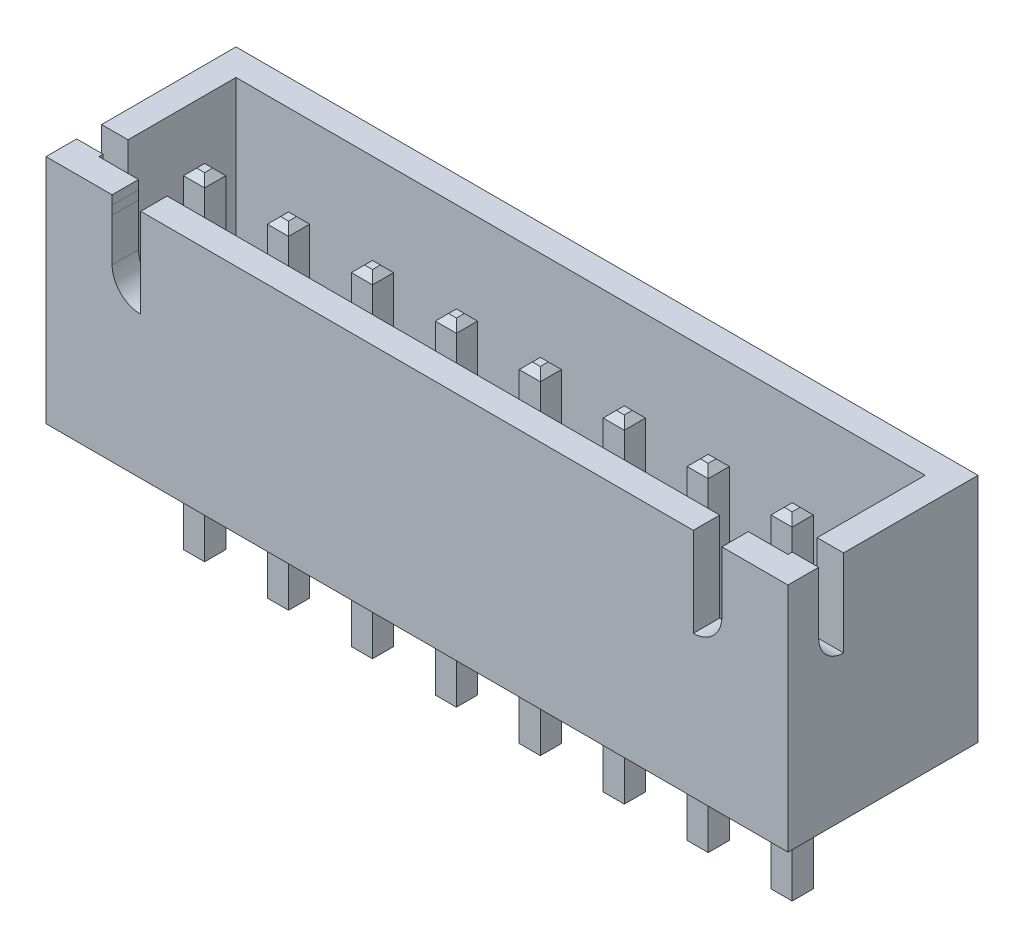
ISO-10303-21;
HEADER;
FILE_DESCRIPTION(('STEP AP214'),'2;1');
FILE_NAME('part.step','',(''),(''),'','','');
FILE_SCHEMA(('AUTOMOTIVE_DESIGN { 1 0 10303 214 1 1 1 1 }'));
ENDSEC;
DATA;
#1=APPLICATION_CONTEXT('core data for automotive mechanical design processes');
#2=APPLICATION_PROTOCOL_DEFINITION('international standard','automotive_design',2000,#1);
#3=PRODUCT_CONTEXT('',#1,'mechanical');
#4=PRODUCT('Part','Part','',(#3));
#5=PRODUCT_RELATED_PRODUCT_CATEGORY('part','',(#4));
#6=PRODUCT_DEFINITION_FORMATION('','',#4);
#7=PRODUCT_DEFINITION_CONTEXT('part definition',#1,'design');
#8=PRODUCT_DEFINITION('design','',#6,#7);
#9=PRODUCT_DEFINITION_SHAPE('','',#8);
#10=(LENGTH_UNIT() NAMED_UNIT(*) SI_UNIT(.MILLI.,.METRE.));
#11=(NAMED_UNIT(*) PLANE_ANGLE_UNIT() SI_UNIT($,.RADIAN.));
#12=(NAMED_UNIT(*) SI_UNIT($,.STERADIAN.) SOLID_ANGLE_UNIT());
#13=UNCERTAINTY_MEASURE_WITH_UNIT(LENGTH_MEASURE(1.E-05),#10,'distance_accuracy_value','');
#14=(GEOMETRIC_REPRESENTATION_CONTEXT(3) GLOBAL_UNCERTAINTY_ASSIGNED_CONTEXT((#13)) GLOBAL_UNIT_ASSIGNED_CONTEXT((#10,
#11,#12)) REPRESENTATION_CONTEXT('',''));
#15=CARTESIAN_POINT('',(0.,0.,0.));
#16=DIRECTION('',(0.,0.,1.));
#17=DIRECTION('',(1.,0.,0.));
#18=AXIS2_PLACEMENT_3D('',#15,#16,#17);
#19=CARTESIAN_POINT('',(0.,7.,0.));
#20=DIRECTION('',(0.,1.,0.));
#21=DIRECTION('',(0.,0.,1.));
#22=AXIS2_PLACEMENT_3D('',#19,#20,#21);
#23=PLANE('',#22);
#24=DIRECTION('',(0.,0.,1.));
#25=VECTOR('',#24,1.);
#26=CARTESIAN_POINT('',(9.2268,7.,-2.876));
#27=LINE('',#26,#25);
#28=CARTESIAN_POINT('',(9.2268,7.,2.075));
#29=VERTEX_POINT('',#28);
#30=CARTESIAN_POINT('',(9.2268,7.,2.875));
#31=VERTEX_POINT('',#30);
#32=EDGE_CURVE('E1048',#29,#31,#27,.T.);
#33=ORIENTED_EDGE('',*,*,#32,.T.);
#34=DIRECTION('',(1.,0.,0.));
#35=VECTOR('',#34,1.);
#36=CARTESIAN_POINT('',(-11.2268,7.,2.875));
#37=LINE('',#36,#35);
#38=CARTESIAN_POINT('',(11.2268,7.,2.875));
#39=VERTEX_POINT('',#38);
#40=EDGE_CURVE('E1196',#31,#39,#37,.T.);
#41=ORIENTED_EDGE('',*,*,#40,.T.);
#42=DIRECTION('',(0.,0.,-1.));
#43=VECTOR('',#42,1.);
#44=CARTESIAN_POINT('',(11.2268,7.,-2.875));
#45=LINE('',#44,#43);
#46=CARTESIAN_POINT('',(11.2268,7.,1.94691722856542));
#47=VERTEX_POINT('',#46);
#48=EDGE_CURVE('E1186',#39,#47,#45,.T.);
#49=ORIENTED_EDGE('',*,*,#48,.T.);
#50=DIRECTION('',(1.,0.,0.));
#51=VECTOR('',#50,1.);
#52=CARTESIAN_POINT('',(-11.2268,7.,1.94691722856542));
#53=LINE('',#52,#51);
#54=CARTESIAN_POINT('',(10.4268,7.,1.94691722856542));
#55=VERTEX_POINT('',#54);
#56=EDGE_CURVE('E1121',#55,#47,#53,.T.);
#57=ORIENTED_EDGE('',*,*,#56,.F.);
#58=DIRECTION('',(0.,0.,-1.));
#59=VECTOR('',#58,1.);
#60=CARTESIAN_POINT('',(10.4268,7.,-2.875));
#61=LINE('',#60,#59);
#62=CARTESIAN_POINT('',(10.4268,7.,2.075));
#63=VERTEX_POINT('',#62);
#64=EDGE_CURVE('E1173',#63,#55,#61,.T.);
#65=ORIENTED_EDGE('',*,*,#64,.F.);
#66=DIRECTION('',(1.,0.,0.));
#67=VECTOR('',#66,1.);
#68=CARTESIAN_POINT('',(-11.2268,7.,2.075));
#69=LINE('',#68,#67);
#70=EDGE_CURVE('E1182',#29,#63,#69,.T.);
#71=ORIENTED_EDGE('',*,*,#70,.F.);
#72=EDGE_LOOP('',(#33,#41,#49,#57,#65,#71));
#73=FACE_BOUND('',#72,.T.);
#74=ADVANCED_FACE('F35',(#73),#23,.T.);
#75=DIRECTION('',(0.,0.,1.));
#76=VECTOR('',#75,1.);
#77=CARTESIAN_POINT('',(-9.2268,7.,-2.876));
#78=LINE('',#77,#76);
#79=CARTESIAN_POINT('',(-9.2268,7.,2.075));
#80=VERTEX_POINT('',#79);
#81=CARTESIAN_POINT('',(-9.2268,7.,2.875));
#82=VERTEX_POINT('',#81);
#83=EDGE_CURVE('E1092',#80,#82,#78,.T.);
#84=ORIENTED_EDGE('',*,*,#83,.F.);
#85=CARTESIAN_POINT('',(-10.4268,7.,2.075));
#86=VERTEX_POINT('',#85);
#87=EDGE_CURVE('E1162',#86,#80,#69,.T.);
#88=ORIENTED_EDGE('',*,*,#87,.F.);
#89=DIRECTION('',(0.,0.,1.));
#90=VECTOR('',#89,1.);
#91=CARTESIAN_POINT('',(-10.4268,7.,-2.875));
#92=LINE('',#91,#90);
#93=CARTESIAN_POINT('',(-10.4268,7.,1.94691722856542));
#94=VERTEX_POINT('',#93);
#95=EDGE_CURVE('E1178',#94,#86,#92,.T.);
#96=ORIENTED_EDGE('',*,*,#95,.F.);
#97=CARTESIAN_POINT('',(-11.2268,7.,1.94691722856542));
#98=VERTEX_POINT('',#97);
#99=EDGE_CURVE('E1141',#98,#94,#53,.T.);
#100=ORIENTED_EDGE('',*,*,#99,.F.);
#101=DIRECTION('',(0.,0.,1.));
#102=VECTOR('',#101,1.);
#103=CARTESIAN_POINT('',(-11.2268,7.,-2.875));
#104=LINE('',#103,#102);
#105=CARTESIAN_POINT('',(-11.2268,7.,2.875));
#106=VERTEX_POINT('',#105);
#107=EDGE_CURVE('E1192',#98,#106,#104,.T.);
#108=ORIENTED_EDGE('',*,*,#107,.T.);
#109=EDGE_CURVE('E1197',#106,#82,#37,.T.);
#110=ORIENTED_EDGE('',*,*,#109,.T.);
#111=EDGE_LOOP('',(#84,#88,#96,#100,#108,#110));
#112=FACE_BOUND('',#111,.T.);
#113=ADVANCED_FACE('F1808',(#112),#23,.T.);
#114=DIRECTION('',(1.,0.,0.));
#115=VECTOR('',#114,1.);
#116=CARTESIAN_POINT('',(-11.2268,7.,1.19301282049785));
#117=LINE('',#116,#115);
#118=CARTESIAN_POINT('',(10.4268,7.,1.19301282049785));
#119=VERTEX_POINT('',#118);
#120=CARTESIAN_POINT('',(11.2268,7.,1.19301282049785));
#121=VERTEX_POINT('',#120);
#122=EDGE_CURVE('E1132',#119,#121,#117,.T.);
#123=ORIENTED_EDGE('',*,*,#122,.T.);
#124=CARTESIAN_POINT('',(11.2268,7.,-2.875));
#125=VERTEX_POINT('',#124);
#126=EDGE_CURVE('E1190',#121,#125,#45,.T.);
#127=ORIENTED_EDGE('',*,*,#126,.T.);
#128=DIRECTION('',(-1.,0.,0.));
#129=VECTOR('',#128,1.);
#130=CARTESIAN_POINT('',(-11.2268,7.,-2.875));
#131=LINE('',#130,#129);
#132=CARTESIAN_POINT('',(-11.2268,7.,-2.875));
#133=VERTEX_POINT('',#132);
#134=EDGE_CURVE('E1189',#125,#133,#131,.T.);
#135=ORIENTED_EDGE('',*,*,#134,.T.);
#136=CARTESIAN_POINT('',(-11.2268,7.,1.19301282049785));
#137=VERTEX_POINT('',#136);
#138=EDGE_CURVE('E1193',#133,#137,#104,.T.);
#139=ORIENTED_EDGE('',*,*,#138,.T.);
#140=CARTESIAN_POINT('',(-10.4268,7.,1.19301282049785));
#141=VERTEX_POINT('',#140);
#142=EDGE_CURVE('E1128',#137,#141,#117,.T.);
#143=ORIENTED_EDGE('',*,*,#142,.T.);
#144=CARTESIAN_POINT('',(-10.4268,7.,-2.075));
#145=VERTEX_POINT('',#144);
#146=EDGE_CURVE('E1179',#145,#141,#92,.T.);
#147=ORIENTED_EDGE('',*,*,#146,.F.);
#148=DIRECTION('',(-1.,0.,0.));
#149=VECTOR('',#148,1.);
#150=CARTESIAN_POINT('',(-11.2268,7.,-2.075));
#151=LINE('',#150,#149);
#152=CARTESIAN_POINT('',(10.4268,7.,-2.075));
#153=VERTEX_POINT('',#152);
#154=EDGE_CURVE('E1176',#153,#145,#151,.T.);
#155=ORIENTED_EDGE('',*,*,#154,.F.);
#156=EDGE_CURVE('E1172',#119,#153,#61,.T.);
#157=ORIENTED_EDGE('',*,*,#156,.F.);
#158=EDGE_LOOP('',(#123,#127,#135,#139,#143,#147,#155,#157));
#159=FACE_BOUND('',#158,.T.);
#160=ADVANCED_FACE('F1815',(#159),#23,.T.);
#161=CARTESIAN_POINT('',(11.2268,7.,-2.875));
#162=DIRECTION('',(-1.,0.,0.));
#163=DIRECTION('',(0.,0.,1.));
#164=AXIS2_PLACEMENT_3D('',#161,#162,#163);
#165=PLANE('',#164);
#166=ORIENTED_EDGE('',*,*,#126,.F.);
#167=DIRECTION('',(0.,1.,0.));
#168=VECTOR('',#167,1.);
#169=CARTESIAN_POINT('',(11.2268,7.,1.19301282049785));
#170=LINE('',#169,#168);
#171=CARTESIAN_POINT('',(11.2268,4.37960398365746,1.19301282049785));
#172=VERTEX_POINT('',#171);
#173=EDGE_CURVE('E1115',#172,#121,#170,.T.);
#174=ORIENTED_EDGE('',*,*,#173,.F.);
#175=CARTESIAN_POINT('',(11.2268,5.13350839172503,1.19301282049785));
#176=DIRECTION('',(1.,0.,0.));
#177=DIRECTION('',(0.,0.,1.));
#178=AXIS2_PLACEMENT_3D('',#175,#176,#177);
#179=CIRCLE('',#178,0.753904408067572);
#180=CARTESIAN_POINT('',(11.2268,5.13350839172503,1.94691722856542));
#181=VERTEX_POINT('',#180);
#182=EDGE_CURVE('E1124',#181,#172,#179,.T.);
#183=ORIENTED_EDGE('',*,*,#182,.F.);
#184=DIRECTION('',(0.,-1.,0.));
#185=VECTOR('',#184,1.);
#186=CARTESIAN_POINT('',(11.2268,5.13350839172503,1.94691722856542));
#187=LINE('',#186,#185);
#188=EDGE_CURVE('E1110',#47,#181,#187,.T.);
#189=ORIENTED_EDGE('',*,*,#188,.F.);
#190=ORIENTED_EDGE('',*,*,#48,.F.);
#191=DIRECTION('',(0.,-1.,0.));
#192=VECTOR('',#191,1.);
#193=CARTESIAN_POINT('',(11.2268,7.,2.875));
#194=LINE('',#193,#192);
#195=CARTESIAN_POINT('',(11.2268,0.,2.875));
#196=VERTEX_POINT('',#195);
#197=EDGE_CURVE('E1200',#39,#196,#194,.T.);
#198=ORIENTED_EDGE('',*,*,#197,.T.);
#199=DIRECTION('',(0.,0.,-1.));
#200=VECTOR('',#199,1.);
#201=CARTESIAN_POINT('',(11.2268,0.,-2.875));
#202=LINE('',#201,#200);
#203=CARTESIAN_POINT('',(11.2268,0.,-2.875));
#204=VERTEX_POINT('',#203);
#205=EDGE_CURVE('E1156',#196,#204,#202,.T.);
#206=ORIENTED_EDGE('',*,*,#205,.T.);
#207=DIRECTION('',(0.,-1.,0.));
#208=VECTOR('',#207,1.);
#209=CARTESIAN_POINT('',(11.2268,7.,-2.875));
#210=LINE('',#209,#208);
#211=EDGE_CURVE('E1218',#125,#204,#210,.T.);
#212=ORIENTED_EDGE('',*,*,#211,.F.);
#213=EDGE_LOOP('',(#166,#174,#183,#189,#190,#198,#206,#212));
#214=FACE_BOUND('',#213,.T.);
#215=ADVANCED_FACE('F1832',(#214),#165,.F.);
#216=CARTESIAN_POINT('',(-11.2268,7.,-2.875));
#217=DIRECTION('',(0.,0.,1.));
#218=DIRECTION('',(1.,0.,0.));
#219=AXIS2_PLACEMENT_3D('',#216,#217,#218);
#220=PLANE('',#219);
#221=DIRECTION('',(-1.,0.,0.));
#222=VECTOR('',#221,1.);
#223=CARTESIAN_POINT('',(-11.2268,0.,-2.875));
#224=LINE('',#223,#222);
#225=CARTESIAN_POINT('',(-11.2268,0.,-2.875));
#226=VERTEX_POINT('',#225);
#227=EDGE_CURVE('E1204',#204,#226,#224,.T.);
#228=ORIENTED_EDGE('',*,*,#227,.T.);
#229=DIRECTION('',(0.,-1.,0.));
#230=VECTOR('',#229,1.);
#231=CARTESIAN_POINT('',(-11.2268,7.,-2.875));
#232=LINE('',#231,#230);
#233=EDGE_CURVE('E1215',#133,#226,#232,.T.);
#234=ORIENTED_EDGE('',*,*,#233,.F.);
#235=ORIENTED_EDGE('',*,*,#134,.F.);
#236=ORIENTED_EDGE('',*,*,#211,.T.);
#237=EDGE_LOOP('',(#228,#234,#235,#236));
#238=FACE_BOUND('',#237,.T.);
#239=ADVANCED_FACE('F1837',(#238),#220,.F.);
#240=CARTESIAN_POINT('',(-11.2268,7.,-2.875));
#241=DIRECTION('',(1.,0.,0.));
#242=DIRECTION('',(0.,0.,-1.));
#243=AXIS2_PLACEMENT_3D('',#240,#241,#242);
#244=PLANE('',#243);
#245=CARTESIAN_POINT('',(-11.2268,5.13350839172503,1.19301282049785));
#246=DIRECTION('',(1.,0.,0.));
#247=DIRECTION('',(0.,0.,1.));
#248=AXIS2_PLACEMENT_3D('',#245,#246,#247);
#249=CIRCLE('',#248,0.753904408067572);
#250=CARTESIAN_POINT('',(-11.2268,5.13350839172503,1.94691722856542));
#251=VERTEX_POINT('',#250);
#252=CARTESIAN_POINT('',(-11.2268,4.37960398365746,1.19301282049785));
#253=VERTEX_POINT('',#252);
#254=EDGE_CURVE('E1114',#251,#253,#249,.T.);
#255=ORIENTED_EDGE('',*,*,#254,.T.);
#256=DIRECTION('',(0.,1.,0.));
#257=VECTOR('',#256,1.);
#258=CARTESIAN_POINT('',(-11.2268,7.,1.19301282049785));
#259=LINE('',#258,#257);
#260=EDGE_CURVE('E1118',#253,#137,#259,.T.);
#261=ORIENTED_EDGE('',*,*,#260,.T.);
#262=ORIENTED_EDGE('',*,*,#138,.F.);
#263=ORIENTED_EDGE('',*,*,#233,.T.);
#264=DIRECTION('',(0.,0.,1.));
#265=VECTOR('',#264,1.);
#266=CARTESIAN_POINT('',(-11.2268,0.,-2.875));
#267=LINE('',#266,#265);
#268=CARTESIAN_POINT('',(-11.2268,0.,2.875));
#269=VERTEX_POINT('',#268);
#270=EDGE_CURVE('E1206',#226,#269,#267,.T.);
#271=ORIENTED_EDGE('',*,*,#270,.T.);
#272=DIRECTION('',(0.,-1.,0.));
#273=VECTOR('',#272,1.);
#274=CARTESIAN_POINT('',(-11.2268,7.,2.875));
#275=LINE('',#274,#273);
#276=EDGE_CURVE('E1212',#106,#269,#275,.T.);
#277=ORIENTED_EDGE('',*,*,#276,.F.);
#278=ORIENTED_EDGE('',*,*,#107,.F.);
#279=DIRECTION('',(0.,-1.,0.));
#280=VECTOR('',#279,1.);
#281=CARTESIAN_POINT('',(-11.2268,5.13350839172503,1.94691722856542));
#282=LINE('',#281,#280);
#283=EDGE_CURVE('E1111',#98,#251,#282,.T.);
#284=ORIENTED_EDGE('',*,*,#283,.T.);
#285=EDGE_LOOP('',(#255,#261,#262,#263,#271,#277,#278,#284));
#286=FACE_BOUND('',#285,.T.);
#287=ADVANCED_FACE('F1827',(#286),#244,.F.);
#288=CARTESIAN_POINT('',(-11.2268,7.,2.875));
#289=DIRECTION('',(0.,0.,-1.));
#290=DIRECTION('',(-1.,0.,0.));
#291=AXIS2_PLACEMENT_3D('',#288,#289,#290);
#292=PLANE('',#291);
#293=ORIENTED_EDGE('',*,*,#40,.F.);
#294=DIRECTION('',(0.,1.,0.));
#295=VECTOR('',#294,1.);
#296=CARTESIAN_POINT('',(9.2268,7.,2.875));
#297=LINE('',#296,#295);
#298=CARTESIAN_POINT('',(9.2268,6.72892261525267,2.875));
#299=VERTEX_POINT('',#298);
#300=EDGE_CURVE('E1037',#299,#31,#297,.T.);
#301=ORIENTED_EDGE('',*,*,#300,.F.);
#302=DIRECTION('',(-0.999998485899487,0.00174017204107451,0.));
#303=VECTOR('',#302,1.);
#304=CARTESIAN_POINT('',(9.2268,6.72892261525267,2.875));
#305=LINE('',#304,#303);
#306=CARTESIAN_POINT('',(9.22726119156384,6.72892181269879,2.875));
#307=VERTEX_POINT('',#306);
#308=EDGE_CURVE('E1034',#307,#299,#305,.T.);
#309=ORIENTED_EDGE('',*,*,#308,.F.);
#310=DIRECTION('',(0.00174017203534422,0.999998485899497,0.));
#311=VECTOR('',#310,1.);
#312=CARTESIAN_POINT('',(9.22726119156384,6.72892181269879,2.875));
#313=LINE('',#312,#311);
#314=CARTESIAN_POINT('',(9.22679999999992,6.46389579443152,2.875));
#315=VERTEX_POINT('',#314);
#316=EDGE_CURVE('E1031',#315,#307,#313,.T.);
#317=ORIENTED_EDGE('',*,*,#316,.F.);
#318=DIRECTION('',(0.,1.,0.));
#319=VECTOR('',#318,1.);
#320=CARTESIAN_POINT('',(9.22679999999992,6.46389579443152,2.875));
#321=LINE('',#320,#319);
#322=CARTESIAN_POINT('',(9.2268,5.16630822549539,2.875));
#323=VERTEX_POINT('',#322);
#324=EDGE_CURVE('E1028',#323,#315,#321,.T.);
#325=ORIENTED_EDGE('',*,*,#324,.F.);
#326=CARTESIAN_POINT('',(8.36056811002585,5.16630822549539,2.875));
#327=DIRECTION('',(0.,0.,1.));
#328=DIRECTION('',(-1.,0.,0.));
#329=AXIS2_PLACEMENT_3D('',#326,#327,#328);
#330=CIRCLE('',#329,0.866231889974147);
#331=CARTESIAN_POINT('',(8.36056811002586,4.30007633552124,2.875));
#332=VERTEX_POINT('',#331);
#333=EDGE_CURVE('E1025',#332,#323,#330,.T.);
#334=ORIENTED_EDGE('',*,*,#333,.F.);
#335=DIRECTION('',(0.,-1.,0.));
#336=VECTOR('',#335,1.);
#337=CARTESIAN_POINT('',(8.36056811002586,4.30007633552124,2.875));
#338=LINE('',#337,#336);
#339=CARTESIAN_POINT('',(8.36056811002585,7.,2.875));
#340=VERTEX_POINT('',#339);
#341=EDGE_CURVE('E1039',#340,#332,#338,.T.);
#342=ORIENTED_EDGE('',*,*,#341,.F.);
#343=CARTESIAN_POINT('',(-8.36056811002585,7.,2.875));
#344=VERTEX_POINT('',#343);
#345=EDGE_CURVE('E1201',#344,#340,#37,.T.);
#346=ORIENTED_EDGE('',*,*,#345,.F.);
#347=DIRECTION('',(0.,1.,0.));
#348=VECTOR('',#347,1.);
#349=CARTESIAN_POINT('',(-8.36056811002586,4.30007633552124,2.875));
#350=LINE('',#349,#348);
#351=CARTESIAN_POINT('',(-8.36056811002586,4.30007633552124,2.875));
#352=VERTEX_POINT('',#351);
#353=EDGE_CURVE('E1090',#352,#344,#350,.T.);
#354=ORIENTED_EDGE('',*,*,#353,.F.);
#355=CARTESIAN_POINT('',(-8.36056811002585,5.16630822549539,2.875));
#356=DIRECTION('',(0.,0.,1.));
#357=DIRECTION('',(1.,0.,0.));
#358=AXIS2_PLACEMENT_3D('',#355,#356,#357);
#359=CIRCLE('',#358,0.866231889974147);
#360=CARTESIAN_POINT('',(-9.2268,5.16630822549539,2.875));
#361=VERTEX_POINT('',#360);
#362=EDGE_CURVE('E1087',#361,#352,#359,.T.);
#363=ORIENTED_EDGE('',*,*,#362,.F.);
#364=DIRECTION('',(0.,-1.,0.));
#365=VECTOR('',#364,1.);
#366=CARTESIAN_POINT('',(-9.22679999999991,6.46389579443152,2.875));
#367=LINE('',#366,#365);
#368=CARTESIAN_POINT('',(-9.22679999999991,6.46389579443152,2.875));
#369=VERTEX_POINT('',#368);
#370=EDGE_CURVE('E1084',#369,#361,#367,.T.);
#371=ORIENTED_EDGE('',*,*,#370,.F.);
#372=DIRECTION('',(0.00174017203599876,-0.999998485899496,0.));
#373=VECTOR('',#372,1.);
#374=CARTESIAN_POINT('',(-9.227261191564,6.72892181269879,2.875));
#375=LINE('',#374,#373);
#376=CARTESIAN_POINT('',(-9.227261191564,6.72892181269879,2.875));
#377=VERTEX_POINT('',#376);
#378=EDGE_CURVE('E1081',#377,#369,#375,.T.);
#379=ORIENTED_EDGE('',*,*,#378,.F.);
#380=DIRECTION('',(-0.999998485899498,-0.00174017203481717,0.));
#381=VECTOR('',#380,1.);
#382=CARTESIAN_POINT('',(-9.2268,6.72892261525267,2.875));
#383=LINE('',#382,#381);
#384=CARTESIAN_POINT('',(-9.2268,6.72892261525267,2.875));
#385=VERTEX_POINT('',#384);
#386=EDGE_CURVE('E1078',#385,#377,#383,.T.);
#387=ORIENTED_EDGE('',*,*,#386,.F.);
#388=DIRECTION('',(0.,-1.,0.));
#389=VECTOR('',#388,1.);
#390=CARTESIAN_POINT('',(-9.2268,7.,2.875));
#391=LINE('',#390,#389);
#392=EDGE_CURVE('E1075',#82,#385,#391,.T.);
#393=ORIENTED_EDGE('',*,*,#392,.F.);
#394=ORIENTED_EDGE('',*,*,#109,.F.);
#395=ORIENTED_EDGE('',*,*,#276,.T.);
#396=DIRECTION('',(1.,0.,0.));
#397=VECTOR('',#396,1.);
#398=CARTESIAN_POINT('',(-11.2268,0.,2.875));
#399=LINE('',#398,#397);
#400=EDGE_CURVE('E1208',#269,#196,#399,.T.);
#401=ORIENTED_EDGE('',*,*,#400,.T.);
#402=ORIENTED_EDGE('',*,*,#197,.F.);
#403=EDGE_LOOP('',(#293,#301,#309,#317,#325,#334,#342,#346,#354,#363,#371,#379,#387,#393,#394,
#395,#401,#402));
#404=FACE_BOUND('',#403,.T.);
#405=ADVANCED_FACE('F1820',(#404),#292,.F.);
#406=DIRECTION('',(0.,0.,1.));
#407=VECTOR('',#406,1.);
#408=CARTESIAN_POINT('',(8.36056811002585,7.,-2.876));
#409=LINE('',#408,#407);
#410=CARTESIAN_POINT('',(8.36056811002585,7.,2.075));
#411=VERTEX_POINT('',#410);
#412=EDGE_CURVE('E1046',#411,#340,#409,.T.);
#413=ORIENTED_EDGE('',*,*,#412,.F.);
#414=CARTESIAN_POINT('',(-8.36056811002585,7.,2.075));
#415=VERTEX_POINT('',#414);
#416=EDGE_CURVE('E1185',#415,#411,#69,.T.);
#417=ORIENTED_EDGE('',*,*,#416,.F.);
#418=DIRECTION('',(0.,0.,1.));
#419=VECTOR('',#418,1.);
#420=CARTESIAN_POINT('',(-8.36056811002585,7.,-2.876));
#421=LINE('',#420,#419);
#422=EDGE_CURVE('E1093',#415,#344,#421,.T.);
#423=ORIENTED_EDGE('',*,*,#422,.T.);
#424=ORIENTED_EDGE('',*,*,#345,.T.);
#425=EDGE_LOOP('',(#413,#417,#423,#424));
#426=FACE_BOUND('',#425,.T.);
#427=ADVANCED_FACE('F1811',(#426),#23,.T.);
#428=CARTESIAN_POINT('',(0.,0.,0.));
#429=DIRECTION('',(0.,1.,0.));
#430=DIRECTION('',(0.,0.,1.));
#431=AXIS2_PLACEMENT_3D('',#428,#429,#430);
#432=PLANE('',#431);
#433=DIRECTION('',(1.,0.,0.));
#434=VECTOR('',#433,1.);
#435=CARTESIAN_POINT('',(0.,0.,0.845));
#436=LINE('',#435,#434);
#437=CARTESIAN_POINT('',(8.6832,0.,0.845));
#438=VERTEX_POINT('',#437);
#439=CARTESIAN_POINT('',(9.3232,0.,0.845));
#440=VERTEX_POINT('',#439);
#441=EDGE_CURVE('E809',#438,#440,#436,.T.);
#442=ORIENTED_EDGE('',*,*,#441,.T.);
#443=DIRECTION('',(0.,0.,-1.));
#444=VECTOR('',#443,1.);
#445=CARTESIAN_POINT('',(9.3232,0.,0.));
#446=LINE('',#445,#444);
#447=CARTESIAN_POINT('',(9.3232,0.,0.205));
#448=VERTEX_POINT('',#447);
#449=EDGE_CURVE('E837',#440,#448,#446,.T.);
#450=ORIENTED_EDGE('',*,*,#449,.T.);
#451=DIRECTION('',(-1.,0.,0.));
#452=VECTOR('',#451,1.);
#453=CARTESIAN_POINT('',(0.,0.,0.205));
#454=LINE('',#453,#452);
#455=CARTESIAN_POINT('',(8.6832,0.,0.205));
#456=VERTEX_POINT('',#455);
#457=EDGE_CURVE('E835',#448,#456,#454,.T.);
#458=ORIENTED_EDGE('',*,*,#457,.T.);
#459=DIRECTION('',(0.,0.,1.));
#460=VECTOR('',#459,1.);
#461=CARTESIAN_POINT('',(8.6832,0.,0.));
#462=LINE('',#461,#460);
#463=EDGE_CURVE('E820',#456,#438,#462,.T.);
#464=ORIENTED_EDGE('',*,*,#463,.T.);
#465=EDGE_LOOP('',(#442,#450,#458,#464));
#466=FACE_BOUND('',#465,.T.);
#467=DIRECTION('',(1.,0.,0.));
#468=VECTOR('',#467,1.);
#469=CARTESIAN_POINT('',(0.,0.,0.845));
#470=LINE('',#469,#468);
#471=CARTESIAN_POINT('',(6.1432,0.,0.845));
#472=VERTEX_POINT('',#471);
#473=CARTESIAN_POINT('',(6.7832,0.,0.845));
#474=VERTEX_POINT('',#473);
#475=EDGE_CURVE('E845',#472,#474,#470,.T.);
#476=ORIENTED_EDGE('',*,*,#475,.T.);
#477=DIRECTION('',(0.,0.,-1.));
#478=VECTOR('',#477,1.);
#479=CARTESIAN_POINT('',(6.7832,0.,0.));
#480=LINE('',#479,#478);
#481=CARTESIAN_POINT('',(6.7832,0.,0.205));
#482=VERTEX_POINT('',#481);
#483=EDGE_CURVE('E863',#474,#482,#480,.T.);
#484=ORIENTED_EDGE('',*,*,#483,.T.);
#485=DIRECTION('',(-1.,0.,0.));
#486=VECTOR('',#485,1.);
#487=CARTESIAN_POINT('',(0.,0.,0.205));
#488=LINE('',#487,#486);
#489=CARTESIAN_POINT('',(6.1432,0.,0.205));
#490=VERTEX_POINT('',#489);
#491=EDGE_CURVE('E860',#482,#490,#488,.T.);
#492=ORIENTED_EDGE('',*,*,#491,.T.);
#493=DIRECTION('',(0.,0.,1.));
#494=VECTOR('',#493,1.);
#495=CARTESIAN_POINT('',(6.1432,0.,0.));
#496=LINE('',#495,#494);
#497=EDGE_CURVE('E857',#490,#472,#496,.T.);
#498=ORIENTED_EDGE('',*,*,#497,.T.);
#499=EDGE_LOOP('',(#476,#484,#492,#498));
#500=FACE_BOUND('',#499,.T.);
#501=DIRECTION('',(1.,0.,0.));
#502=VECTOR('',#501,1.);
#503=CARTESIAN_POINT('',(0.,0.,0.845));
#504=LINE('',#503,#502);
#505=CARTESIAN_POINT('',(3.6032,0.,0.845));
#506=VERTEX_POINT('',#505);
#507=CARTESIAN_POINT('',(4.2432,0.,0.845));
#508=VERTEX_POINT('',#507);
#509=EDGE_CURVE('E869',#506,#508,#504,.T.);
#510=ORIENTED_EDGE('',*,*,#509,.T.);
#511=DIRECTION('',(0.,0.,-1.));
#512=VECTOR('',#511,1.);
#513=CARTESIAN_POINT('',(4.2432,0.,0.));
#514=LINE('',#513,#512);
#515=CARTESIAN_POINT('',(4.2432,0.,0.205));
#516=VERTEX_POINT('',#515);
#517=EDGE_CURVE('E887',#508,#516,#514,.T.);
#518=ORIENTED_EDGE('',*,*,#517,.T.);
#519=DIRECTION('',(-1.,0.,0.));
#520=VECTOR('',#519,1.);
#521=CARTESIAN_POINT('',(0.,0.,0.205));
#522=LINE('',#521,#520);
#523=CARTESIAN_POINT('',(3.6032,0.,0.205));
#524=VERTEX_POINT('',#523);
#525=EDGE_CURVE('E884',#516,#524,#522,.T.);
#526=ORIENTED_EDGE('',*,*,#525,.T.);
#527=DIRECTION('',(0.,0.,1.));
#528=VECTOR('',#527,1.);
#529=CARTESIAN_POINT('',(3.6032,0.,0.));
#530=LINE('',#529,#528);
#531=EDGE_CURVE('E881',#524,#506,#530,.T.);
#532=ORIENTED_EDGE('',*,*,#531,.T.);
#533=EDGE_LOOP('',(#510,#518,#526,#532));
#534=FACE_BOUND('',#533,.T.);
#535=DIRECTION('',(1.,0.,0.));
#536=VECTOR('',#535,1.);
#537=CARTESIAN_POINT('',(0.,0.,0.845));
#538=LINE('',#537,#536);
#539=CARTESIAN_POINT('',(1.0632,0.,0.845));
#540=VERTEX_POINT('',#539);
#541=CARTESIAN_POINT('',(1.7032,0.,0.845));
#542=VERTEX_POINT('',#541);
#543=EDGE_CURVE('E893',#540,#542,#538,.T.);
#544=ORIENTED_EDGE('',*,*,#543,.T.);
#545=DIRECTION('',(0.,0.,-1.));
#546=VECTOR('',#545,1.);
#547=CARTESIAN_POINT('',(1.7032,0.,0.));
#548=LINE('',#547,#546);
#549=CARTESIAN_POINT('',(1.7032,0.,0.205));
#550=VERTEX_POINT('',#549);
#551=EDGE_CURVE('E911',#542,#550,#548,.T.);
#552=ORIENTED_EDGE('',*,*,#551,.T.);
#553=DIRECTION('',(-1.,0.,0.));
#554=VECTOR('',#553,1.);
#555=CARTESIAN_POINT('',(0.,0.,0.205));
#556=LINE('',#555,#554);
#557=CARTESIAN_POINT('',(1.0632,0.,0.205));
#558=VERTEX_POINT('',#557);
#559=EDGE_CURVE('E908',#550,#558,#556,.T.);
#560=ORIENTED_EDGE('',*,*,#559,.T.);
#561=DIRECTION('',(0.,0.,1.));
#562=VECTOR('',#561,1.);
#563=CARTESIAN_POINT('',(1.0632,0.,0.));
#564=LINE('',#563,#562);
#565=EDGE_CURVE('E905',#558,#540,#564,.T.);
#566=ORIENTED_EDGE('',*,*,#565,.T.);
#567=EDGE_LOOP('',(#544,#552,#560,#566));
#568=FACE_BOUND('',#567,.T.);
#569=DIRECTION('',(1.,0.,0.));
#570=VECTOR('',#569,1.);
#571=CARTESIAN_POINT('',(0.,0.,0.845));
#572=LINE('',#571,#570);
#573=CARTESIAN_POINT('',(-1.4768,0.,0.845));
#574=VERTEX_POINT('',#573);
#575=CARTESIAN_POINT('',(-0.836799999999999,0.,0.845));
#576=VERTEX_POINT('',#575);
#577=EDGE_CURVE('E917',#574,#576,#572,.T.);
#578=ORIENTED_EDGE('',*,*,#577,.T.);
#579=DIRECTION('',(0.,0.,-1.));
#580=VECTOR('',#579,1.);
#581=CARTESIAN_POINT('',(-0.836799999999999,0.,0.));
#582=LINE('',#581,#580);
#583=CARTESIAN_POINT('',(-0.836799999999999,0.,0.205));
#584=VERTEX_POINT('',#583);
#585=EDGE_CURVE('E935',#576,#584,#582,.T.);
#586=ORIENTED_EDGE('',*,*,#585,.T.);
#587=DIRECTION('',(-1.,0.,0.));
#588=VECTOR('',#587,1.);
#589=CARTESIAN_POINT('',(0.,0.,0.205));
#590=LINE('',#589,#588);
#591=CARTESIAN_POINT('',(-1.4768,0.,0.205));
#592=VERTEX_POINT('',#591);
#593=EDGE_CURVE('E932',#584,#592,#590,.T.);
#594=ORIENTED_EDGE('',*,*,#593,.T.);
#595=DIRECTION('',(0.,0.,1.));
#596=VECTOR('',#595,1.);
#597=CARTESIAN_POINT('',(-1.4768,0.,0.));
#598=LINE('',#597,#596);
#599=EDGE_CURVE('E929',#592,#574,#598,.T.);
#600=ORIENTED_EDGE('',*,*,#599,.T.);
#601=EDGE_LOOP('',(#578,#586,#594,#600));
#602=FACE_BOUND('',#601,.T.);
#603=DIRECTION('',(1.,0.,0.));
#604=VECTOR('',#603,1.);
#605=CARTESIAN_POINT('',(0.,0.,0.845));
#606=LINE('',#605,#604);
#607=CARTESIAN_POINT('',(-4.0168,0.,0.845));
#608=VERTEX_POINT('',#607);
#609=CARTESIAN_POINT('',(-3.3768,0.,0.845));
#610=VERTEX_POINT('',#609);
#611=EDGE_CURVE('E941',#608,#610,#606,.T.);
#612=ORIENTED_EDGE('',*,*,#611,.T.);
#613=DIRECTION('',(0.,0.,-1.));
#614=VECTOR('',#613,1.);
#615=CARTESIAN_POINT('',(-3.3768,0.,0.));
#616=LINE('',#615,#614);
#617=CARTESIAN_POINT('',(-3.3768,0.,0.205));
#618=VERTEX_POINT('',#617);
#619=EDGE_CURVE('E959',#610,#618,#616,.T.);
#620=ORIENTED_EDGE('',*,*,#619,.T.);
#621=DIRECTION('',(-1.,0.,0.));
#622=VECTOR('',#621,1.);
#623=CARTESIAN_POINT('',(0.,0.,0.205));
#624=LINE('',#623,#622);
#625=CARTESIAN_POINT('',(-4.0168,0.,0.205));
#626=VERTEX_POINT('',#625);
#627=EDGE_CURVE('E956',#618,#626,#624,.T.);
#628=ORIENTED_EDGE('',*,*,#627,.T.);
#629=DIRECTION('',(0.,0.,1.));
#630=VECTOR('',#629,1.);
#631=CARTESIAN_POINT('',(-4.0168,0.,0.));
#632=LINE('',#631,#630);
#633=EDGE_CURVE('E953',#626,#608,#632,.T.);
#634=ORIENTED_EDGE('',*,*,#633,.T.);
#635=EDGE_LOOP('',(#612,#620,#628,#634));
#636=FACE_BOUND('',#635,.T.);
#637=DIRECTION('',(1.,0.,0.));
#638=VECTOR('',#637,1.);
#639=CARTESIAN_POINT('',(0.,0.,0.845));
#640=LINE('',#639,#638);
#641=CARTESIAN_POINT('',(-6.5568,0.,0.845));
#642=VERTEX_POINT('',#641);
#643=CARTESIAN_POINT('',(-5.9168,0.,0.845));
#644=VERTEX_POINT('',#643);
#645=EDGE_CURVE('E965',#642,#644,#640,.T.);
#646=ORIENTED_EDGE('',*,*,#645,.T.);
#647=DIRECTION('',(0.,0.,-1.));
#648=VECTOR('',#647,1.);
#649=CARTESIAN_POINT('',(-5.9168,0.,0.));
#650=LINE('',#649,#648);
#651=CARTESIAN_POINT('',(-5.9168,0.,0.205));
#652=VERTEX_POINT('',#651);
#653=EDGE_CURVE('E983',#644,#652,#650,.T.);
#654=ORIENTED_EDGE('',*,*,#653,.T.);
#655=DIRECTION('',(-1.,0.,0.));
#656=VECTOR('',#655,1.);
#657=CARTESIAN_POINT('',(0.,0.,0.205));
#658=LINE('',#657,#656);
#659=CARTESIAN_POINT('',(-6.5568,0.,0.205));
#660=VERTEX_POINT('',#659);
#661=EDGE_CURVE('E980',#652,#660,#658,.T.);
#662=ORIENTED_EDGE('',*,*,#661,.T.);
#663=DIRECTION('',(0.,0.,1.));
#664=VECTOR('',#663,1.);
#665=CARTESIAN_POINT('',(-6.5568,0.,0.));
#666=LINE('',#665,#664);
#667=EDGE_CURVE('E977',#660,#642,#666,.T.);
#668=ORIENTED_EDGE('',*,*,#667,.T.);
#669=EDGE_LOOP('',(#646,#654,#662,#668));
#670=FACE_BOUND('',#669,.T.);
#671=DIRECTION('',(1.,0.,0.));
#672=VECTOR('',#671,1.);
#673=CARTESIAN_POINT('',(0.,0.,0.845));
#674=LINE('',#673,#672);
#675=CARTESIAN_POINT('',(-9.0968,0.,0.845));
#676=VERTEX_POINT('',#675);
#677=CARTESIAN_POINT('',(-8.4568,0.,0.845));
#678=VERTEX_POINT('',#677);
#679=EDGE_CURVE('E989',#676,#678,#674,.T.);
#680=ORIENTED_EDGE('',*,*,#679,.T.);
#681=DIRECTION('',(0.,0.,-1.));
#682=VECTOR('',#681,1.);
#683=CARTESIAN_POINT('',(-8.4568,0.,0.));
#684=LINE('',#683,#682);
#685=CARTESIAN_POINT('',(-8.4568,0.,0.205));
#686=VERTEX_POINT('',#685);
#687=EDGE_CURVE('E1007',#678,#686,#684,.T.);
#688=ORIENTED_EDGE('',*,*,#687,.T.);
#689=DIRECTION('',(-1.,0.,0.));
#690=VECTOR('',#689,1.);
#691=CARTESIAN_POINT('',(0.,0.,0.205));
#692=LINE('',#691,#690);
#693=CARTESIAN_POINT('',(-9.0968,0.,0.205));
#694=VERTEX_POINT('',#693);
#695=EDGE_CURVE('E1004',#686,#694,#692,.T.);
#696=ORIENTED_EDGE('',*,*,#695,.T.);
#697=DIRECTION('',(0.,0.,1.));
#698=VECTOR('',#697,1.);
#699=CARTESIAN_POINT('',(-9.0968,0.,0.));
#700=LINE('',#699,#698);
#701=EDGE_CURVE('E1001',#694,#676,#700,.T.);
#702=ORIENTED_EDGE('',*,*,#701,.T.);
#703=EDGE_LOOP('',(#680,#688,#696,#702));
#704=FACE_BOUND('',#703,.T.);
#705=ORIENTED_EDGE('',*,*,#205,.F.);
#706=ORIENTED_EDGE('',*,*,#400,.F.);
#707=ORIENTED_EDGE('',*,*,#270,.F.);
#708=ORIENTED_EDGE('',*,*,#227,.F.);
#709=EDGE_LOOP('',(#705,#706,#707,#708));
#710=FACE_BOUND('',#709,.T.);
#711=ADVANCED_FACE('F833',(#466,#500,#534,#568,#602,#636,#670,#704,#710),#432,.F.);
#712=CARTESIAN_POINT('',(10.4268,7.,-2.875));
#713=DIRECTION('',(-1.,0.,0.));
#714=DIRECTION('',(0.,0.,1.));
#715=AXIS2_PLACEMENT_3D('',#712,#713,#714);
#716=PLANE('',#715);
#717=DIRECTION('',(0.,-1.,0.));
#718=VECTOR('',#717,1.);
#719=CARTESIAN_POINT('',(10.4268,7.,1.19301282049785));
#720=LINE('',#719,#718);
#721=CARTESIAN_POINT('',(10.4268,4.37960398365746,1.19301282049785));
#722=VERTEX_POINT('',#721);
#723=EDGE_CURVE('E1147',#119,#722,#720,.T.);
#724=ORIENTED_EDGE('',*,*,#723,.F.);
#725=ORIENTED_EDGE('',*,*,#156,.T.);
#726=DIRECTION('',(0.,-1.,0.));
#727=VECTOR('',#726,1.);
#728=CARTESIAN_POINT('',(10.4268,7.,-2.075));
#729=LINE('',#728,#727);
#730=CARTESIAN_POINT('',(10.4268,0.8,-2.075));
#731=VERTEX_POINT('',#730);
#732=EDGE_CURVE('E1153',#153,#731,#729,.T.);
#733=ORIENTED_EDGE('',*,*,#732,.T.);
#734=DIRECTION('',(0.,0.,-1.));
#735=VECTOR('',#734,1.);
#736=CARTESIAN_POINT('',(10.4268,0.8,-2.875));
#737=LINE('',#736,#735);
#738=CARTESIAN_POINT('',(10.4268,0.8,2.075));
#739=VERTEX_POINT('',#738);
#740=EDGE_CURVE('E1149',#739,#731,#737,.T.);
#741=ORIENTED_EDGE('',*,*,#740,.F.);
#742=DIRECTION('',(0.,-1.,0.));
#743=VECTOR('',#742,1.);
#744=CARTESIAN_POINT('',(10.4268,7.,2.075));
#745=LINE('',#744,#743);
#746=EDGE_CURVE('E1158',#63,#739,#745,.T.);
#747=ORIENTED_EDGE('',*,*,#746,.F.);
#748=ORIENTED_EDGE('',*,*,#64,.T.);
#749=DIRECTION('',(0.,1.,0.));
#750=VECTOR('',#749,1.);
#751=CARTESIAN_POINT('',(10.4268,7.,1.94691722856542));
#752=LINE('',#751,#750);
#753=CARTESIAN_POINT('',(10.4268,5.13350839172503,1.94691722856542));
#754=VERTEX_POINT('',#753);
#755=EDGE_CURVE('E1131',#754,#55,#752,.T.);
#756=ORIENTED_EDGE('',*,*,#755,.F.);
#757=CARTESIAN_POINT('',(10.4268,5.13350839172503,1.19301282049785));
#758=DIRECTION('',(-1.,0.,0.));
#759=DIRECTION('',(0.,0.,1.));
#760=AXIS2_PLACEMENT_3D('',#757,#758,#759);
#761=CIRCLE('',#760,0.753904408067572);
#762=EDGE_CURVE('E1144',#722,#754,#761,.T.);
#763=ORIENTED_EDGE('',*,*,#762,.F.);
#764=EDGE_LOOP('',(#724,#725,#733,#741,#747,#748,#756,#763));
#765=FACE_BOUND('',#764,.T.);
#766=ADVANCED_FACE('F1826',(#765),#716,.T.);
#767=CARTESIAN_POINT('',(-11.2268,7.,-2.075));
#768=DIRECTION('',(0.,0.,1.));
#769=DIRECTION('',(1.,0.,0.));
#770=AXIS2_PLACEMENT_3D('',#767,#768,#769);
#771=PLANE('',#770);
#772=DIRECTION('',(-1.,0.,0.));
#773=VECTOR('',#772,1.);
#774=CARTESIAN_POINT('',(-11.2268,0.8,-2.075));
#775=LINE('',#774,#773);
#776=CARTESIAN_POINT('',(-10.4268,0.8,-2.075));
#777=VERTEX_POINT('',#776);
#778=EDGE_CURVE('E1152',#731,#777,#775,.T.);
#779=ORIENTED_EDGE('',*,*,#778,.F.);
#780=ORIENTED_EDGE('',*,*,#732,.F.);
#781=ORIENTED_EDGE('',*,*,#154,.T.);
#782=DIRECTION('',(0.,-1.,0.));
#783=VECTOR('',#782,1.);
#784=CARTESIAN_POINT('',(-10.4268,7.,-2.075));
#785=LINE('',#784,#783);
#786=EDGE_CURVE('E1157',#145,#777,#785,.T.);
#787=ORIENTED_EDGE('',*,*,#786,.T.);
#788=EDGE_LOOP('',(#779,#780,#781,#787));
#789=FACE_BOUND('',#788,.T.);
#790=ADVANCED_FACE('F1870',(#789),#771,.T.);
#791=CARTESIAN_POINT('',(-10.4268,7.,-2.875));
#792=DIRECTION('',(1.,0.,0.));
#793=DIRECTION('',(0.,0.,-1.));
#794=AXIS2_PLACEMENT_3D('',#791,#792,#793);
#795=PLANE('',#794);
#796=DIRECTION('',(0.,1.,0.));
#797=VECTOR('',#796,1.);
#798=CARTESIAN_POINT('',(-10.4268,7.,1.19301282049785));
#799=LINE('',#798,#797);
#800=CARTESIAN_POINT('',(-10.4268,4.37960398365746,1.19301282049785));
#801=VERTEX_POINT('',#800);
#802=EDGE_CURVE('E1225',#801,#141,#799,.T.);
#803=ORIENTED_EDGE('',*,*,#802,.F.);
#804=CARTESIAN_POINT('',(-10.4268,5.13350839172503,1.19301282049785));
#805=DIRECTION('',(1.,0.,0.));
#806=DIRECTION('',(0.,0.,-1.));
#807=AXIS2_PLACEMENT_3D('',#804,#805,#806);
#808=CIRCLE('',#807,0.753904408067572);
#809=CARTESIAN_POINT('',(-10.4268,5.13350839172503,1.94691722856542));
#810=VERTEX_POINT('',#809);
#811=EDGE_CURVE('E1223',#810,#801,#808,.T.);
#812=ORIENTED_EDGE('',*,*,#811,.F.);
#813=DIRECTION('',(0.,-1.,0.));
#814=VECTOR('',#813,1.);
#815=CARTESIAN_POINT('',(-10.4268,7.,1.94691722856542));
#816=LINE('',#815,#814);
#817=EDGE_CURVE('E1221',#94,#810,#816,.T.);
#818=ORIENTED_EDGE('',*,*,#817,.F.);
#819=ORIENTED_EDGE('',*,*,#95,.T.);
#820=DIRECTION('',(0.,-1.,0.));
#821=VECTOR('',#820,1.);
#822=CARTESIAN_POINT('',(-10.4268,7.,2.075));
#823=LINE('',#822,#821);
#824=CARTESIAN_POINT('',(-10.4268,0.8,2.075));
#825=VERTEX_POINT('',#824);
#826=EDGE_CURVE('E1161',#86,#825,#823,.T.);
#827=ORIENTED_EDGE('',*,*,#826,.T.);
#828=DIRECTION('',(0.,0.,1.));
#829=VECTOR('',#828,1.);
#830=CARTESIAN_POINT('',(-10.4268,0.8,-2.875));
#831=LINE('',#830,#829);
#832=EDGE_CURVE('E1164',#777,#825,#831,.T.);
#833=ORIENTED_EDGE('',*,*,#832,.F.);
#834=ORIENTED_EDGE('',*,*,#786,.F.);
#835=ORIENTED_EDGE('',*,*,#146,.T.);
#836=EDGE_LOOP('',(#803,#812,#818,#819,#827,#833,#834,#835));
#837=FACE_BOUND('',#836,.T.);
#838=ADVANCED_FACE('F1864',(#837),#795,.T.);
#839=CARTESIAN_POINT('',(-11.2268,7.,2.075));
#840=DIRECTION('',(0.,0.,-1.));
#841=DIRECTION('',(-1.,0.,0.));
#842=AXIS2_PLACEMENT_3D('',#839,#840,#841);
#843=PLANE('',#842);
#844=DIRECTION('',(0.,1.,0.));
#845=VECTOR('',#844,1.);
#846=CARTESIAN_POINT('',(9.2268,7.,2.075));
#847=LINE('',#846,#845);
#848=CARTESIAN_POINT('',(9.2268,6.72892261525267,2.075));
#849=VERTEX_POINT('',#848);
#850=EDGE_CURVE('E1016',#849,#29,#847,.T.);
#851=ORIENTED_EDGE('',*,*,#850,.T.);
#852=ORIENTED_EDGE('',*,*,#70,.T.);
#853=ORIENTED_EDGE('',*,*,#746,.T.);
#854=DIRECTION('',(1.,0.,0.));
#855=VECTOR('',#854,1.);
#856=CARTESIAN_POINT('',(-11.2268,0.8,2.075));
#857=LINE('',#856,#855);
#858=EDGE_CURVE('E1168',#825,#739,#857,.T.);
#859=ORIENTED_EDGE('',*,*,#858,.F.);
#860=ORIENTED_EDGE('',*,*,#826,.F.);
#861=ORIENTED_EDGE('',*,*,#87,.T.);
#862=DIRECTION('',(0.,-1.,0.));
#863=VECTOR('',#862,1.);
#864=CARTESIAN_POINT('',(-9.2268,7.,2.075));
#865=LINE('',#864,#863);
#866=CARTESIAN_POINT('',(-9.2268,6.72892261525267,2.075));
#867=VERTEX_POINT('',#866);
#868=EDGE_CURVE('E1096',#80,#867,#865,.T.);
#869=ORIENTED_EDGE('',*,*,#868,.T.);
#870=DIRECTION('',(-0.999998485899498,-0.00174017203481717,0.));
#871=VECTOR('',#870,1.);
#872=CARTESIAN_POINT('',(-9.2268,6.72892261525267,2.075));
#873=LINE('',#872,#871);
#874=CARTESIAN_POINT('',(-9.227261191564,6.72892181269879,2.075));
#875=VERTEX_POINT('',#874);
#876=EDGE_CURVE('E1060',#867,#875,#873,.T.);
#877=ORIENTED_EDGE('',*,*,#876,.T.);
#878=DIRECTION('',(0.00174017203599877,-0.999998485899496,0.));
#879=VECTOR('',#878,1.);
#880=CARTESIAN_POINT('',(-9.227261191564,6.72892181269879,2.075));
#881=LINE('',#880,#879);
#882=CARTESIAN_POINT('',(-9.22679999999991,6.46389579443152,2.075));
#883=VERTEX_POINT('',#882);
#884=EDGE_CURVE('E1063',#875,#883,#881,.T.);
#885=ORIENTED_EDGE('',*,*,#884,.T.);
#886=DIRECTION('',(0.,-1.,0.));
#887=VECTOR('',#886,1.);
#888=CARTESIAN_POINT('',(-9.22679999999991,6.46389579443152,2.075));
#889=LINE('',#888,#887);
#890=CARTESIAN_POINT('',(-9.2268,5.16630822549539,2.075));
#891=VERTEX_POINT('',#890);
#892=EDGE_CURVE('E1066',#883,#891,#889,.T.);
#893=ORIENTED_EDGE('',*,*,#892,.T.);
#894=CARTESIAN_POINT('',(-8.36056811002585,5.16630822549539,2.075));
#895=DIRECTION('',(0.,0.,-1.));
#896=DIRECTION('',(-1.,0.,0.));
#897=AXIS2_PLACEMENT_3D('',#894,#895,#896);
#898=CIRCLE('',#897,0.866231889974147);
#899=CARTESIAN_POINT('',(-8.36056811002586,4.30007633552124,2.075));
#900=VERTEX_POINT('',#899);
#901=EDGE_CURVE('E1069',#891,#900,#898,.F.);
#902=ORIENTED_EDGE('',*,*,#901,.T.);
#903=DIRECTION('',(0.,1.,0.));
#904=VECTOR('',#903,1.);
#905=CARTESIAN_POINT('',(-8.36056811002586,4.30007633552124,2.075));
#906=LINE('',#905,#904);
#907=EDGE_CURVE('E1072',#900,#415,#906,.T.);
#908=ORIENTED_EDGE('',*,*,#907,.T.);
#909=ORIENTED_EDGE('',*,*,#416,.T.);
#910=DIRECTION('',(0.,-1.,0.));
#911=VECTOR('',#910,1.);
#912=CARTESIAN_POINT('',(8.36056811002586,4.30007633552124,2.075));
#913=LINE('',#912,#911);
#914=CARTESIAN_POINT('',(8.36056811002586,4.30007633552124,2.075));
#915=VERTEX_POINT('',#914);
#916=EDGE_CURVE('E1022',#411,#915,#913,.T.);
#917=ORIENTED_EDGE('',*,*,#916,.T.);
#918=CARTESIAN_POINT('',(8.36056811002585,5.16630822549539,2.075));
#919=DIRECTION('',(0.,0.,-1.));
#920=DIRECTION('',(-1.,0.,0.));
#921=AXIS2_PLACEMENT_3D('',#918,#919,#920);
#922=CIRCLE('',#921,0.866231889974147);
#923=CARTESIAN_POINT('',(9.2268,5.16630822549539,2.075));
#924=VERTEX_POINT('',#923);
#925=EDGE_CURVE('E1019',#915,#924,#922,.F.);
#926=ORIENTED_EDGE('',*,*,#925,.T.);
#927=DIRECTION('',(0.,1.,0.));
#928=VECTOR('',#927,1.);
#929=CARTESIAN_POINT('',(9.22679999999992,6.46389579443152,2.075));
#930=LINE('',#929,#928);
#931=CARTESIAN_POINT('',(9.22679999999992,6.46389579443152,2.075));
#932=VERTEX_POINT('',#931);
#933=EDGE_CURVE('E1045',#924,#932,#930,.T.);
#934=ORIENTED_EDGE('',*,*,#933,.T.);
#935=DIRECTION('',(0.00174017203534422,0.999998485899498,0.));
#936=VECTOR('',#935,1.);
#937=CARTESIAN_POINT('',(9.22726119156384,6.72892181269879,2.075));
#938=LINE('',#937,#936);
#939=CARTESIAN_POINT('',(9.22726119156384,6.72892181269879,2.075));
#940=VERTEX_POINT('',#939);
#941=EDGE_CURVE('E1010',#932,#940,#938,.T.);
#942=ORIENTED_EDGE('',*,*,#941,.T.);
#943=DIRECTION('',(-0.999998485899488,0.00174017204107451,0.));
#944=VECTOR('',#943,1.);
#945=CARTESIAN_POINT('',(9.2268,6.72892261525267,2.075));
#946=LINE('',#945,#944);
#947=EDGE_CURVE('E1013',#940,#849,#946,.T.);
#948=ORIENTED_EDGE('',*,*,#947,.T.);
#949=EDGE_LOOP('',(#851,#852,#853,#859,#860,#861,#869,#877,#885,#893,#902,#908,#909,#917,#926,
#934,#942,#948));
#950=FACE_BOUND('',#949,.T.);
#951=ADVANCED_FACE('F1877',(#950),#843,.T.);
#952=CARTESIAN_POINT('',(0.,0.8,0.));
#953=DIRECTION('',(0.,1.,0.));
#954=DIRECTION('',(0.,0.,1.));
#955=AXIS2_PLACEMENT_3D('',#952,#953,#954);
#956=PLANE('',#955);
#957=DIRECTION('',(0.,0.,-1.));
#958=VECTOR('',#957,1.);
#959=CARTESIAN_POINT('',(9.3232,0.8,0.));
#960=LINE('',#959,#958);
#961=CARTESIAN_POINT('',(9.3232,0.8,0.845));
#962=VERTEX_POINT('',#961);
#963=CARTESIAN_POINT('',(9.3232,0.8,0.205));
#964=VERTEX_POINT('',#963);
#965=EDGE_CURVE('E1320',#962,#964,#960,.T.);
#966=ORIENTED_EDGE('',*,*,#965,.F.);
#967=DIRECTION('',(1.,0.,0.));
#968=VECTOR('',#967,1.);
#969=CARTESIAN_POINT('',(0.,0.8,0.845));
#970=LINE('',#969,#968);
#971=CARTESIAN_POINT('',(8.6832,0.8,0.845));
#972=VERTEX_POINT('',#971);
#973=EDGE_CURVE('E1311',#972,#962,#970,.T.);
#974=ORIENTED_EDGE('',*,*,#973,.F.);
#975=DIRECTION('',(0.,0.,1.));
#976=VECTOR('',#975,1.);
#977=CARTESIAN_POINT('',(8.6832,0.8,0.));
#978=LINE('',#977,#976);
#979=CARTESIAN_POINT('',(8.6832,0.8,0.205));
#980=VERTEX_POINT('',#979);
#981=EDGE_CURVE('E1314',#980,#972,#978,.T.);
#982=ORIENTED_EDGE('',*,*,#981,.F.);
#983=DIRECTION('',(-1.,0.,0.));
#984=VECTOR('',#983,1.);
#985=CARTESIAN_POINT('',(0.,0.8,0.205));
#986=LINE('',#985,#984);
#987=EDGE_CURVE('E1317',#964,#980,#986,.T.);
#988=ORIENTED_EDGE('',*,*,#987,.F.);
#989=EDGE_LOOP('',(#966,#974,#982,#988));
#990=FACE_BOUND('',#989,.T.);
#991=DIRECTION('',(0.,0.,-1.));
#992=VECTOR('',#991,1.);
#993=CARTESIAN_POINT('',(6.7832,0.8,0.));
#994=LINE('',#993,#992);
#995=CARTESIAN_POINT('',(6.7832,0.8,0.845));
#996=VERTEX_POINT('',#995);
#997=CARTESIAN_POINT('',(6.7832,0.8,0.205));
#998=VERTEX_POINT('',#997);
#999=EDGE_CURVE('E1308',#996,#998,#994,.T.);
#1000=ORIENTED_EDGE('',*,*,#999,.F.);
#1001=DIRECTION('',(1.,0.,0.));
#1002=VECTOR('',#1001,1.);
#1003=CARTESIAN_POINT('',(0.,0.8,0.845));
#1004=LINE('',#1003,#1002);
#1005=CARTESIAN_POINT('',(6.1432,0.8,0.845));
#1006=VERTEX_POINT('',#1005);
#1007=EDGE_CURVE('E1299',#1006,#996,#1004,.T.);
#1008=ORIENTED_EDGE('',*,*,#1007,.F.);
#1009=DIRECTION('',(0.,0.,1.));
#1010=VECTOR('',#1009,1.);
#1011=CARTESIAN_POINT('',(6.1432,0.8,0.));
#1012=LINE('',#1011,#1010);
#1013=CARTESIAN_POINT('',(6.1432,0.8,0.205));
#1014=VERTEX_POINT('',#1013);
#1015=EDGE_CURVE('E1302',#1014,#1006,#1012,.T.);
#1016=ORIENTED_EDGE('',*,*,#1015,.F.);
#1017=DIRECTION('',(-1.,0.,0.));
#1018=VECTOR('',#1017,1.);
#1019=CARTESIAN_POINT('',(0.,0.8,0.205));
#1020=LINE('',#1019,#1018);
#1021=EDGE_CURVE('E1305',#998,#1014,#1020,.T.);
#1022=ORIENTED_EDGE('',*,*,#1021,.F.);
#1023=EDGE_LOOP('',(#1000,#1008,#1016,#1022));
#1024=FACE_BOUND('',#1023,.T.);
#1025=DIRECTION('',(0.,0.,-1.));
#1026=VECTOR('',#1025,1.);
#1027=CARTESIAN_POINT('',(4.2432,0.8,0.));
#1028=LINE('',#1027,#1026);
#1029=CARTESIAN_POINT('',(4.2432,0.8,0.845));
#1030=VERTEX_POINT('',#1029);
#1031=CARTESIAN_POINT('',(4.2432,0.8,0.205));
#1032=VERTEX_POINT('',#1031);
#1033=EDGE_CURVE('E1296',#1030,#1032,#1028,.T.);
#1034=ORIENTED_EDGE('',*,*,#1033,.F.);
#1035=DIRECTION('',(1.,0.,0.));
#1036=VECTOR('',#1035,1.);
#1037=CARTESIAN_POINT('',(0.,0.8,0.845));
#1038=LINE('',#1037,#1036);
#1039=CARTESIAN_POINT('',(3.6032,0.8,0.845));
#1040=VERTEX_POINT('',#1039);
#1041=EDGE_CURVE('E1287',#1040,#1030,#1038,.T.);
#1042=ORIENTED_EDGE('',*,*,#1041,.F.);
#1043=DIRECTION('',(0.,0.,1.));
#1044=VECTOR('',#1043,1.);
#1045=CARTESIAN_POINT('',(3.6032,0.8,0.));
#1046=LINE('',#1045,#1044);
#1047=CARTESIAN_POINT('',(3.6032,0.8,0.205));
#1048=VERTEX_POINT('',#1047);
#1049=EDGE_CURVE('E1290',#1048,#1040,#1046,.T.);
#1050=ORIENTED_EDGE('',*,*,#1049,.F.);
#1051=DIRECTION('',(-1.,0.,0.));
#1052=VECTOR('',#1051,1.);
#1053=CARTESIAN_POINT('',(0.,0.8,0.205));
#1054=LINE('',#1053,#1052);
#1055=EDGE_CURVE('E1293',#1032,#1048,#1054,.T.);
#1056=ORIENTED_EDGE('',*,*,#1055,.F.);
#1057=EDGE_LOOP('',(#1034,#1042,#1050,#1056));
#1058=FACE_BOUND('',#1057,.T.);
#1059=DIRECTION('',(0.,0.,-1.));
#1060=VECTOR('',#1059,1.);
#1061=CARTESIAN_POINT('',(1.7032,0.8,0.));
#1062=LINE('',#1061,#1060);
#1063=CARTESIAN_POINT('',(1.7032,0.8,0.845));
#1064=VERTEX_POINT('',#1063);
#1065=CARTESIAN_POINT('',(1.7032,0.8,0.205));
#1066=VERTEX_POINT('',#1065);
#1067=EDGE_CURVE('E1284',#1064,#1066,#1062,.T.);
#1068=ORIENTED_EDGE('',*,*,#1067,.F.);
#1069=DIRECTION('',(1.,0.,0.));
#1070=VECTOR('',#1069,1.);
#1071=CARTESIAN_POINT('',(0.,0.8,0.845));
#1072=LINE('',#1071,#1070);
#1073=CARTESIAN_POINT('',(1.0632,0.8,0.845));
#1074=VERTEX_POINT('',#1073);
#1075=EDGE_CURVE('E1275',#1074,#1064,#1072,.T.);
#1076=ORIENTED_EDGE('',*,*,#1075,.F.);
#1077=DIRECTION('',(0.,0.,1.));
#1078=VECTOR('',#1077,1.);
#1079=CARTESIAN_POINT('',(1.0632,0.8,0.));
#1080=LINE('',#1079,#1078);
#1081=CARTESIAN_POINT('',(1.0632,0.8,0.205));
#1082=VERTEX_POINT('',#1081);
#1083=EDGE_CURVE('E1278',#1082,#1074,#1080,.T.);
#1084=ORIENTED_EDGE('',*,*,#1083,.F.);
#1085=DIRECTION('',(-1.,0.,0.));
#1086=VECTOR('',#1085,1.);
#1087=CARTESIAN_POINT('',(0.,0.8,0.205));
#1088=LINE('',#1087,#1086);
#1089=EDGE_CURVE('E1281',#1066,#1082,#1088,.T.);
#1090=ORIENTED_EDGE('',*,*,#1089,.F.);
#1091=EDGE_LOOP('',(#1068,#1076,#1084,#1090));
#1092=FACE_BOUND('',#1091,.T.);
#1093=DIRECTION('',(0.,0.,-1.));
#1094=VECTOR('',#1093,1.);
#1095=CARTESIAN_POINT('',(-0.836799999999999,0.8,0.));
#1096=LINE('',#1095,#1094);
#1097=CARTESIAN_POINT('',(-0.836799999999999,0.8,0.845));
#1098=VERTEX_POINT('',#1097);
#1099=CARTESIAN_POINT('',(-0.836799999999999,0.8,0.205));
#1100=VERTEX_POINT('',#1099);
#1101=EDGE_CURVE('E1272',#1098,#1100,#1096,.T.);
#1102=ORIENTED_EDGE('',*,*,#1101,.F.);
#1103=DIRECTION('',(1.,0.,0.));
#1104=VECTOR('',#1103,1.);
#1105=CARTESIAN_POINT('',(0.,0.8,0.845));
#1106=LINE('',#1105,#1104);
#1107=CARTESIAN_POINT('',(-1.4768,0.8,0.845));
#1108=VERTEX_POINT('',#1107);
#1109=EDGE_CURVE('E1263',#1108,#1098,#1106,.T.);
#1110=ORIENTED_EDGE('',*,*,#1109,.F.);
#1111=DIRECTION('',(0.,0.,1.));
#1112=VECTOR('',#1111,1.);
#1113=CARTESIAN_POINT('',(-1.4768,0.8,0.));
#1114=LINE('',#1113,#1112);
#1115=CARTESIAN_POINT('',(-1.4768,0.8,0.205));
#1116=VERTEX_POINT('',#1115);
#1117=EDGE_CURVE('E1266',#1116,#1108,#1114,.T.);
#1118=ORIENTED_EDGE('',*,*,#1117,.F.);
#1119=DIRECTION('',(-1.,0.,0.));
#1120=VECTOR('',#1119,1.);
#1121=CARTESIAN_POINT('',(0.,0.8,0.205));
#1122=LINE('',#1121,#1120);
#1123=EDGE_CURVE('E1269',#1100,#1116,#1122,.T.);
#1124=ORIENTED_EDGE('',*,*,#1123,.F.);
#1125=EDGE_LOOP('',(#1102,#1110,#1118,#1124));
#1126=FACE_BOUND('',#1125,.T.);
#1127=DIRECTION('',(0.,0.,-1.));
#1128=VECTOR('',#1127,1.);
#1129=CARTESIAN_POINT('',(-3.3768,0.8,0.));
#1130=LINE('',#1129,#1128);
#1131=CARTESIAN_POINT('',(-3.3768,0.8,0.845));
#1132=VERTEX_POINT('',#1131);
#1133=CARTESIAN_POINT('',(-3.3768,0.8,0.205));
#1134=VERTEX_POINT('',#1133);
#1135=EDGE_CURVE('E1260',#1132,#1134,#1130,.T.);
#1136=ORIENTED_EDGE('',*,*,#1135,.F.);
#1137=DIRECTION('',(1.,0.,0.));
#1138=VECTOR('',#1137,1.);
#1139=CARTESIAN_POINT('',(0.,0.8,0.845));
#1140=LINE('',#1139,#1138);
#1141=CARTESIAN_POINT('',(-4.0168,0.8,0.845));
#1142=VERTEX_POINT('',#1141);
#1143=EDGE_CURVE('E1251',#1142,#1132,#1140,.T.);
#1144=ORIENTED_EDGE('',*,*,#1143,.F.);
#1145=DIRECTION('',(0.,0.,1.));
#1146=VECTOR('',#1145,1.);
#1147=CARTESIAN_POINT('',(-4.0168,0.8,0.));
#1148=LINE('',#1147,#1146);
#1149=CARTESIAN_POINT('',(-4.0168,0.8,0.205));
#1150=VERTEX_POINT('',#1149);
#1151=EDGE_CURVE('E1254',#1150,#1142,#1148,.T.);
#1152=ORIENTED_EDGE('',*,*,#1151,.F.);
#1153=DIRECTION('',(-1.,0.,0.));
#1154=VECTOR('',#1153,1.);
#1155=CARTESIAN_POINT('',(0.,0.8,0.205));
#1156=LINE('',#1155,#1154);
#1157=EDGE_CURVE('E1257',#1134,#1150,#1156,.T.);
#1158=ORIENTED_EDGE('',*,*,#1157,.F.);
#1159=EDGE_LOOP('',(#1136,#1144,#1152,#1158));
#1160=FACE_BOUND('',#1159,.T.);
#1161=DIRECTION('',(0.,0.,-1.));
#1162=VECTOR('',#1161,1.);
#1163=CARTESIAN_POINT('',(-5.9168,0.8,0.));
#1164=LINE('',#1163,#1162);
#1165=CARTESIAN_POINT('',(-5.9168,0.8,0.845));
#1166=VERTEX_POINT('',#1165);
#1167=CARTESIAN_POINT('',(-5.9168,0.8,0.205));
#1168=VERTEX_POINT('',#1167);
#1169=EDGE_CURVE('E1248',#1166,#1168,#1164,.T.);
#1170=ORIENTED_EDGE('',*,*,#1169,.F.);
#1171=DIRECTION('',(1.,0.,0.));
#1172=VECTOR('',#1171,1.);
#1173=CARTESIAN_POINT('',(0.,0.8,0.845));
#1174=LINE('',#1173,#1172);
#1175=CARTESIAN_POINT('',(-6.5568,0.8,0.845));
#1176=VERTEX_POINT('',#1175);
#1177=EDGE_CURVE('E1239',#1176,#1166,#1174,.T.);
#1178=ORIENTED_EDGE('',*,*,#1177,.F.);
#1179=DIRECTION('',(0.,0.,1.));
#1180=VECTOR('',#1179,1.);
#1181=CARTESIAN_POINT('',(-6.5568,0.8,0.));
#1182=LINE('',#1181,#1180);
#1183=CARTESIAN_POINT('',(-6.5568,0.8,0.205));
#1184=VERTEX_POINT('',#1183);
#1185=EDGE_CURVE('E1242',#1184,#1176,#1182,.T.);
#1186=ORIENTED_EDGE('',*,*,#1185,.F.);
#1187=DIRECTION('',(-1.,0.,0.));
#1188=VECTOR('',#1187,1.);
#1189=CARTESIAN_POINT('',(0.,0.8,0.205));
#1190=LINE('',#1189,#1188);
#1191=EDGE_CURVE('E1245',#1168,#1184,#1190,.T.);
#1192=ORIENTED_EDGE('',*,*,#1191,.F.);
#1193=EDGE_LOOP('',(#1170,#1178,#1186,#1192));
#1194=FACE_BOUND('',#1193,.T.);
#1195=DIRECTION('',(0.,0.,-1.));
#1196=VECTOR('',#1195,1.);
#1197=CARTESIAN_POINT('',(-8.4568,0.8,0.));
#1198=LINE('',#1197,#1196);
#1199=CARTESIAN_POINT('',(-8.4568,0.8,0.845));
#1200=VERTEX_POINT('',#1199);
#1201=CARTESIAN_POINT('',(-8.4568,0.8,0.205));
#1202=VERTEX_POINT('',#1201);
#1203=EDGE_CURVE('E1236',#1200,#1202,#1198,.T.);
#1204=ORIENTED_EDGE('',*,*,#1203,.F.);
#1205=DIRECTION('',(1.,0.,0.));
#1206=VECTOR('',#1205,1.);
#1207=CARTESIAN_POINT('',(0.,0.8,0.845));
#1208=LINE('',#1207,#1206);
#1209=CARTESIAN_POINT('',(-9.0968,0.8,0.845));
#1210=VERTEX_POINT('',#1209);
#1211=EDGE_CURVE('E1227',#1210,#1200,#1208,.T.);
#1212=ORIENTED_EDGE('',*,*,#1211,.F.);
#1213=DIRECTION('',(0.,0.,1.));
#1214=VECTOR('',#1213,1.);
#1215=CARTESIAN_POINT('',(-9.0968,0.8,0.));
#1216=LINE('',#1215,#1214);
#1217=CARTESIAN_POINT('',(-9.0968,0.8,0.205));
#1218=VERTEX_POINT('',#1217);
#1219=EDGE_CURVE('E1230',#1218,#1210,#1216,.T.);
#1220=ORIENTED_EDGE('',*,*,#1219,.F.);
#1221=DIRECTION('',(-1.,0.,0.));
#1222=VECTOR('',#1221,1.);
#1223=CARTESIAN_POINT('',(0.,0.8,0.205));
#1224=LINE('',#1223,#1222);
#1225=EDGE_CURVE('E1233',#1202,#1218,#1224,.T.);
#1226=ORIENTED_EDGE('',*,*,#1225,.F.);
#1227=EDGE_LOOP('',(#1204,#1212,#1220,#1226));
#1228=FACE_BOUND('',#1227,.T.);
#1229=ORIENTED_EDGE('',*,*,#740,.T.);
#1230=ORIENTED_EDGE('',*,*,#778,.T.);
#1231=ORIENTED_EDGE('',*,*,#832,.T.);
#1232=ORIENTED_EDGE('',*,*,#858,.T.);
#1233=EDGE_LOOP('',(#1229,#1230,#1231,#1232));
#1234=FACE_BOUND('',#1233,.T.);
#1235=ADVANCED_FACE('F1790',(#990,#1024,#1058,#1092,#1126,#1160,#1194,#1228,#1234),#956,.T.);
#1236=CARTESIAN_POINT('',(-11.2268,5.13350839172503,1.94691722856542));
#1237=DIRECTION('',(0.,0.,1.));
#1238=DIRECTION('',(1.,0.,0.));
#1239=AXIS2_PLACEMENT_3D('',#1236,#1237,#1238);
#1240=PLANE('',#1239);
#1241=ORIENTED_EDGE('',*,*,#817,.T.);
#1242=DIRECTION('',(1.,0.,0.));
#1243=VECTOR('',#1242,1.);
#1244=CARTESIAN_POINT('',(-11.2268,5.13350839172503,1.94691722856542));
#1245=LINE('',#1244,#1243);
#1246=EDGE_CURVE('E1137',#251,#810,#1245,.T.);
#1247=ORIENTED_EDGE('',*,*,#1246,.F.);
#1248=ORIENTED_EDGE('',*,*,#283,.F.);
#1249=ORIENTED_EDGE('',*,*,#99,.T.);
#1250=EDGE_LOOP('',(#1241,#1247,#1248,#1249));
#1251=FACE_BOUND('',#1250,.T.);
#1252=ADVANCED_FACE('F1904',(#1251),#1240,.F.);
#1253=CARTESIAN_POINT('',(-11.2268,5.13350839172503,1.19301282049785));
#1254=DIRECTION('',(1.,0.,0.));
#1255=DIRECTION('',(0.,0.,-1.));
#1256=AXIS2_PLACEMENT_3D('',#1253,#1254,#1255);
#1257=CYLINDRICAL_SURFACE('',#1256,0.753904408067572);
#1258=ORIENTED_EDGE('',*,*,#811,.T.);
#1259=DIRECTION('',(1.,0.,0.));
#1260=VECTOR('',#1259,1.);
#1261=CARTESIAN_POINT('',(-11.2268,4.37960398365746,1.19301282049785));
#1262=LINE('',#1261,#1260);
#1263=EDGE_CURVE('E1133',#253,#801,#1262,.T.);
#1264=ORIENTED_EDGE('',*,*,#1263,.F.);
#1265=ORIENTED_EDGE('',*,*,#254,.F.);
#1266=ORIENTED_EDGE('',*,*,#1246,.T.);
#1267=EDGE_LOOP('',(#1258,#1264,#1265,#1266));
#1268=FACE_BOUND('',#1267,.T.);
#1269=ADVANCED_FACE('F1898',(#1268),#1257,.F.);
#1270=CARTESIAN_POINT('',(-11.2268,7.,1.19301282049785));
#1271=DIRECTION('',(0.,0.,-1.));
#1272=DIRECTION('',(-1.,0.,0.));
#1273=AXIS2_PLACEMENT_3D('',#1270,#1271,#1272);
#1274=PLANE('',#1273);
#1275=ORIENTED_EDGE('',*,*,#802,.T.);
#1276=ORIENTED_EDGE('',*,*,#142,.F.);
#1277=ORIENTED_EDGE('',*,*,#260,.F.);
#1278=ORIENTED_EDGE('',*,*,#1263,.T.);
#1279=EDGE_LOOP('',(#1275,#1276,#1277,#1278));
#1280=FACE_BOUND('',#1279,.T.);
#1281=ADVANCED_FACE('F1860',(#1280),#1274,.F.);
#1282=ORIENTED_EDGE('',*,*,#723,.T.);
#1283=EDGE_CURVE('E1136',#722,#172,#1262,.T.);
#1284=ORIENTED_EDGE('',*,*,#1283,.T.);
#1285=ORIENTED_EDGE('',*,*,#173,.T.);
#1286=ORIENTED_EDGE('',*,*,#122,.F.);
#1287=EDGE_LOOP('',(#1282,#1284,#1285,#1286));
#1288=FACE_BOUND('',#1287,.T.);
#1289=ADVANCED_FACE('F1890',(#1288),#1274,.F.);
#1290=ORIENTED_EDGE('',*,*,#762,.T.);
#1291=EDGE_CURVE('E1140',#754,#181,#1245,.T.);
#1292=ORIENTED_EDGE('',*,*,#1291,.T.);
#1293=ORIENTED_EDGE('',*,*,#182,.T.);
#1294=ORIENTED_EDGE('',*,*,#1283,.F.);
#1295=EDGE_LOOP('',(#1290,#1292,#1293,#1294));
#1296=FACE_BOUND('',#1295,.T.);
#1297=ADVANCED_FACE('F1888',(#1296),#1257,.F.);
#1298=ORIENTED_EDGE('',*,*,#755,.T.);
#1299=ORIENTED_EDGE('',*,*,#56,.T.);
#1300=ORIENTED_EDGE('',*,*,#188,.T.);
#1301=ORIENTED_EDGE('',*,*,#1291,.F.);
#1302=EDGE_LOOP('',(#1298,#1299,#1300,#1301));
#1303=FACE_BOUND('',#1302,.T.);
#1304=ADVANCED_FACE('F1885',(#1303),#1240,.F.);
#1305=CARTESIAN_POINT('',(-9.2268,7.,-2.876));
#1306=DIRECTION('',(-1.,0.,0.));
#1307=DIRECTION('',(0.,0.,1.));
#1308=AXIS2_PLACEMENT_3D('',#1305,#1306,#1307);
#1309=PLANE('',#1308);
#1310=ORIENTED_EDGE('',*,*,#83,.T.);
#1311=ORIENTED_EDGE('',*,*,#392,.T.);
#1312=DIRECTION('',(0.,0.,1.));
#1313=VECTOR('',#1312,1.);
#1314=CARTESIAN_POINT('',(-9.2268,6.72892261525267,-2.876));
#1315=LINE('',#1314,#1313);
#1316=EDGE_CURVE('E1105',#867,#385,#1315,.T.);
#1317=ORIENTED_EDGE('',*,*,#1316,.F.);
#1318=ORIENTED_EDGE('',*,*,#868,.F.);
#1319=EDGE_LOOP('',(#1310,#1311,#1317,#1318));
#1320=FACE_BOUND('',#1319,.T.);
#1321=ADVANCED_FACE('F1900',(#1320),#1309,.F.);
#1322=CARTESIAN_POINT('',(-9.2268,6.72892261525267,-2.876));
#1323=DIRECTION('',(-0.00174017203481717,0.999998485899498,0.));
#1324=DIRECTION('',(-0.999998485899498,-0.00174017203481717,0.));
#1325=AXIS2_PLACEMENT_3D('',#1322,#1323,#1324);
#1326=PLANE('',#1325);
#1327=ORIENTED_EDGE('',*,*,#1316,.T.);
#1328=ORIENTED_EDGE('',*,*,#386,.T.);
#1329=DIRECTION('',(0.,0.,1.));
#1330=VECTOR('',#1329,1.);
#1331=CARTESIAN_POINT('',(-9.227261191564,6.72892181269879,-2.876));
#1332=LINE('',#1331,#1330);
#1333=EDGE_CURVE('E1103',#875,#377,#1332,.T.);
#1334=ORIENTED_EDGE('',*,*,#1333,.F.);
#1335=ORIENTED_EDGE('',*,*,#876,.F.);
#1336=EDGE_LOOP('',(#1327,#1328,#1334,#1335));
#1337=FACE_BOUND('',#1336,.T.);
#1338=ADVANCED_FACE('F3338',(#1337),#1326,.F.);
#1339=CARTESIAN_POINT('',(-9.227261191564,6.72892181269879,-2.876));
#1340=DIRECTION('',(-0.999998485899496,-0.00174017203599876,0.));
#1341=DIRECTION('',(0.00174017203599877,-0.999998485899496,0.));
#1342=AXIS2_PLACEMENT_3D('',#1339,#1340,#1341);
#1343=PLANE('',#1342);
#1344=ORIENTED_EDGE('',*,*,#1333,.T.);
#1345=ORIENTED_EDGE('',*,*,#378,.T.);
#1346=DIRECTION('',(0.,0.,1.));
#1347=VECTOR('',#1346,1.);
#1348=CARTESIAN_POINT('',(-9.22679999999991,6.46389579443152,-2.876));
#1349=LINE('',#1348,#1347);
#1350=EDGE_CURVE('E1101',#883,#369,#1349,.T.);
#1351=ORIENTED_EDGE('',*,*,#1350,.F.);
#1352=ORIENTED_EDGE('',*,*,#884,.F.);
#1353=EDGE_LOOP('',(#1344,#1345,#1351,#1352));
#1354=FACE_BOUND('',#1353,.T.);
#1355=ADVANCED_FACE('F3329',(#1354),#1343,.F.);
#1356=CARTESIAN_POINT('',(-9.22679999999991,6.46389579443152,-2.876));
#1357=DIRECTION('',(-1.,0.,0.));
#1358=DIRECTION('',(0.,-1.,0.));
#1359=AXIS2_PLACEMENT_3D('',#1356,#1357,#1358);
#1360=PLANE('',#1359);
#1361=ORIENTED_EDGE('',*,*,#1350,.T.);
#1362=ORIENTED_EDGE('',*,*,#370,.T.);
#1363=DIRECTION('',(0.,0.,1.));
#1364=VECTOR('',#1363,1.);
#1365=CARTESIAN_POINT('',(-9.2268,5.16630822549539,-2.876));
#1366=LINE('',#1365,#1364);
#1367=EDGE_CURVE('E1099',#891,#361,#1366,.T.);
#1368=ORIENTED_EDGE('',*,*,#1367,.F.);
#1369=ORIENTED_EDGE('',*,*,#892,.F.);
#1370=EDGE_LOOP('',(#1361,#1362,#1368,#1369));
#1371=FACE_BOUND('',#1370,.T.);
#1372=ADVANCED_FACE('F3320',(#1371),#1360,.F.);
#1373=CARTESIAN_POINT('',(-8.36056811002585,5.16630822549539,-2.876));
#1374=DIRECTION('',(0.,0.,1.));
#1375=DIRECTION('',(1.,0.,0.));
#1376=AXIS2_PLACEMENT_3D('',#1373,#1374,#1375);
#1377=CYLINDRICAL_SURFACE('',#1376,0.866231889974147);
#1378=ORIENTED_EDGE('',*,*,#1367,.T.);
#1379=ORIENTED_EDGE('',*,*,#362,.T.);
#1380=DIRECTION('',(0.,0.,1.));
#1381=VECTOR('',#1380,1.);
#1382=CARTESIAN_POINT('',(-8.36056811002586,4.30007633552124,-2.876));
#1383=LINE('',#1382,#1381);
#1384=EDGE_CURVE('E1097',#900,#352,#1383,.T.);
#1385=ORIENTED_EDGE('',*,*,#1384,.F.);
#1386=ORIENTED_EDGE('',*,*,#901,.F.);
#1387=EDGE_LOOP('',(#1378,#1379,#1385,#1386));
#1388=FACE_BOUND('',#1387,.T.);
#1389=ADVANCED_FACE('F3311',(#1388),#1377,.F.);
#1390=CARTESIAN_POINT('',(-8.36056811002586,4.30007633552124,-2.876));
#1391=DIRECTION('',(1.,0.,0.));
#1392=DIRECTION('',(0.,1.,0.));
#1393=AXIS2_PLACEMENT_3D('',#1390,#1391,#1392);
#1394=PLANE('',#1393);
#1395=ORIENTED_EDGE('',*,*,#1384,.T.);
#1396=ORIENTED_EDGE('',*,*,#353,.T.);
#1397=ORIENTED_EDGE('',*,*,#422,.F.);
#1398=ORIENTED_EDGE('',*,*,#907,.F.);
#1399=EDGE_LOOP('',(#1395,#1396,#1397,#1398));
#1400=FACE_BOUND('',#1399,.T.);
#1401=ADVANCED_FACE('F3302',(#1400),#1394,.F.);
#1402=CARTESIAN_POINT('',(9.22679999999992,6.46389579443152,-2.876));
#1403=DIRECTION('',(1.,0.,0.));
#1404=DIRECTION('',(0.,1.,0.));
#1405=AXIS2_PLACEMENT_3D('',#1402,#1403,#1404);
#1406=PLANE('',#1405);
#1407=DIRECTION('',(0.,0.,1.));
#1408=VECTOR('',#1407,1.);
#1409=CARTESIAN_POINT('',(9.2268,5.16630822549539,-2.876));
#1410=LINE('',#1409,#1408);
#1411=EDGE_CURVE('E1042',#924,#323,#1410,.T.);
#1412=ORIENTED_EDGE('',*,*,#1411,.T.);
#1413=ORIENTED_EDGE('',*,*,#324,.T.);
#1414=DIRECTION('',(0.,0.,1.));
#1415=VECTOR('',#1414,1.);
#1416=CARTESIAN_POINT('',(9.22679999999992,6.46389579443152,-2.876));
#1417=LINE('',#1416,#1415);
#1418=EDGE_CURVE('E1055',#932,#315,#1417,.T.);
#1419=ORIENTED_EDGE('',*,*,#1418,.F.);
#1420=ORIENTED_EDGE('',*,*,#933,.F.);
#1421=EDGE_LOOP('',(#1412,#1413,#1419,#1420));
#1422=FACE_BOUND('',#1421,.T.);
#1423=ADVANCED_FACE('F3293',(#1422),#1406,.F.);
#1424=CARTESIAN_POINT('',(9.22726119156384,6.72892181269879,-2.876));
#1425=DIRECTION('',(0.999998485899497,-0.00174017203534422,0.));
#1426=DIRECTION('',(0.00174017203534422,0.999998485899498,0.));
#1427=AXIS2_PLACEMENT_3D('',#1424,#1425,#1426);
#1428=PLANE('',#1427);
#1429=ORIENTED_EDGE('',*,*,#1418,.T.);
#1430=ORIENTED_EDGE('',*,*,#316,.T.);
#1431=DIRECTION('',(0.,0.,1.));
#1432=VECTOR('',#1431,1.);
#1433=CARTESIAN_POINT('',(9.22726119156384,6.72892181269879,-2.876));
#1434=LINE('',#1433,#1432);
#1435=EDGE_CURVE('E1053',#940,#307,#1434,.T.);
#1436=ORIENTED_EDGE('',*,*,#1435,.F.);
#1437=ORIENTED_EDGE('',*,*,#941,.F.);
#1438=EDGE_LOOP('',(#1429,#1430,#1436,#1437));
#1439=FACE_BOUND('',#1438,.T.);
#1440=ADVANCED_FACE('F3284',(#1439),#1428,.F.);
#1441=CARTESIAN_POINT('',(9.2268,6.72892261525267,-2.876));
#1442=DIRECTION('',(0.00174017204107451,0.999998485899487,0.));
#1443=DIRECTION('',(-0.999998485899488,0.00174017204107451,0.));
#1444=AXIS2_PLACEMENT_3D('',#1441,#1442,#1443);
#1445=PLANE('',#1444);
#1446=ORIENTED_EDGE('',*,*,#1435,.T.);
#1447=ORIENTED_EDGE('',*,*,#308,.T.);
#1448=DIRECTION('',(0.,0.,1.));
#1449=VECTOR('',#1448,1.);
#1450=CARTESIAN_POINT('',(9.2268,6.72892261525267,-2.876));
#1451=LINE('',#1450,#1449);
#1452=EDGE_CURVE('E1051',#849,#299,#1451,.T.);
#1453=ORIENTED_EDGE('',*,*,#1452,.F.);
#1454=ORIENTED_EDGE('',*,*,#947,.F.);
#1455=EDGE_LOOP('',(#1446,#1447,#1453,#1454));
#1456=FACE_BOUND('',#1455,.T.);
#1457=ADVANCED_FACE('F3275',(#1456),#1445,.F.);
#1458=CARTESIAN_POINT('',(9.2268,7.,-2.876));
#1459=DIRECTION('',(1.,0.,0.));
#1460=DIRECTION('',(0.,0.,-1.));
#1461=AXIS2_PLACEMENT_3D('',#1458,#1459,#1460);
#1462=PLANE('',#1461);
#1463=ORIENTED_EDGE('',*,*,#1452,.T.);
#1464=ORIENTED_EDGE('',*,*,#300,.T.);
#1465=ORIENTED_EDGE('',*,*,#32,.F.);
#1466=ORIENTED_EDGE('',*,*,#850,.F.);
#1467=EDGE_LOOP('',(#1463,#1464,#1465,#1466));
#1468=FACE_BOUND('',#1467,.T.);
#1469=ADVANCED_FACE('F3267',(#1468),#1462,.F.);
#1470=CARTESIAN_POINT('',(8.36056811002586,4.30007633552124,-2.876));
#1471=DIRECTION('',(-1.,0.,0.));
#1472=DIRECTION('',(0.,-1.,0.));
#1473=AXIS2_PLACEMENT_3D('',#1470,#1471,#1472);
#1474=PLANE('',#1473);
#1475=ORIENTED_EDGE('',*,*,#412,.T.);
#1476=ORIENTED_EDGE('',*,*,#341,.T.);
#1477=DIRECTION('',(0.,0.,1.));
#1478=VECTOR('',#1477,1.);
#1479=CARTESIAN_POINT('',(8.36056811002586,4.30007633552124,-2.876));
#1480=LINE('',#1479,#1478);
#1481=EDGE_CURVE('E1043',#915,#332,#1480,.T.);
#1482=ORIENTED_EDGE('',*,*,#1481,.F.);
#1483=ORIENTED_EDGE('',*,*,#916,.F.);
#1484=EDGE_LOOP('',(#1475,#1476,#1482,#1483));
#1485=FACE_BOUND('',#1484,.T.);
#1486=ADVANCED_FACE('F3257',(#1485),#1474,.F.);
#1487=CARTESIAN_POINT('',(8.36056811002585,5.16630822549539,-2.876));
#1488=DIRECTION('',(0.,0.,1.));
#1489=DIRECTION('',(1.,0.,0.));
#1490=AXIS2_PLACEMENT_3D('',#1487,#1488,#1489);
#1491=CYLINDRICAL_SURFACE('',#1490,0.866231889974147);
#1492=ORIENTED_EDGE('',*,*,#1481,.T.);
#1493=ORIENTED_EDGE('',*,*,#333,.T.);
#1494=ORIENTED_EDGE('',*,*,#1411,.F.);
#1495=ORIENTED_EDGE('',*,*,#925,.F.);
#1496=EDGE_LOOP('',(#1492,#1493,#1494,#1495));
#1497=FACE_BOUND('',#1496,.T.);
#1498=ADVANCED_FACE('F2008',(#1497),#1491,.F.);
#1499=CARTESIAN_POINT('',(0.,6.75,0.));
#1500=DIRECTION('',(0.,-1.,0.));
#1501=DIRECTION('',(0.,0.,-1.));
#1502=AXIS2_PLACEMENT_3D('',#1499,#1500,#1501);
#1503=PLANE('',#1502);
#1504=DIRECTION('',(0.,0.,1.));
#1505=VECTOR('',#1504,1.);
#1506=CARTESIAN_POINT('',(-8.8968,6.75,0.845));
#1507=LINE('',#1506,#1505);
#1508=CARTESIAN_POINT('',(-8.8968,6.75,0.404999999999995));
#1509=VERTEX_POINT('',#1508);
#1510=CARTESIAN_POINT('',(-8.8968,6.75,0.645000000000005));
#1511=VERTEX_POINT('',#1510);
#1512=EDGE_CURVE('E1599',#1509,#1511,#1507,.T.);
#1513=ORIENTED_EDGE('',*,*,#1512,.T.);
#1514=DIRECTION('',(1.,0.,0.));
#1515=VECTOR('',#1514,1.);
#1516=CARTESIAN_POINT('',(-8.4568,6.75,0.645000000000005));
#1517=LINE('',#1516,#1515);
#1518=CARTESIAN_POINT('',(-8.65679999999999,6.75,0.645000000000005));
#1519=VERTEX_POINT('',#1518);
#1520=EDGE_CURVE('E1601',#1511,#1519,#1517,.T.);
#1521=ORIENTED_EDGE('',*,*,#1520,.T.);
#1522=DIRECTION('',(0.,0.,-1.));
#1523=VECTOR('',#1522,1.);
#1524=CARTESIAN_POINT('',(-8.65679999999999,6.75,0.205));
#1525=LINE('',#1524,#1523);
#1526=CARTESIAN_POINT('',(-8.65679999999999,6.75,0.404999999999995));
#1527=VERTEX_POINT('',#1526);
#1528=EDGE_CURVE('E1595',#1519,#1527,#1525,.T.);
#1529=ORIENTED_EDGE('',*,*,#1528,.T.);
#1530=DIRECTION('',(-1.,0.,0.));
#1531=VECTOR('',#1530,1.);
#1532=CARTESIAN_POINT('',(-9.0968,6.75,0.404999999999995));
#1533=LINE('',#1532,#1531);
#1534=EDGE_CURVE('E1597',#1527,#1509,#1533,.T.);
#1535=ORIENTED_EDGE('',*,*,#1534,.T.);
#1536=EDGE_LOOP('',(#1513,#1521,#1529,#1535));
#1537=FACE_BOUND('',#1536,.T.);
#1538=ADVANCED_FACE('F1774',(#1537),#1503,.F.);
#1539=CARTESIAN_POINT('',(-9.0968,6.75,0.845));
#1540=DIRECTION('',(0.,0.,1.));
#1541=DIRECTION('',(1.,0.,0.));
#1542=AXIS2_PLACEMENT_3D('',#1539,#1540,#1541);
#1543=PLANE('',#1542);
#1544=DIRECTION('',(0.,-1.,0.));
#1545=VECTOR('',#1544,1.);
#1546=CARTESIAN_POINT('',(-8.4568,6.75,0.845));
#1547=LINE('',#1546,#1545);
#1548=CARTESIAN_POINT('',(-8.4568,6.55,0.845));
#1549=VERTEX_POINT('',#1548);
#1550=EDGE_CURVE('E997',#1549,#1200,#1547,.T.);
#1551=ORIENTED_EDGE('',*,*,#1550,.F.);
#1552=DIRECTION('',(-1.,0.,0.));
#1553=VECTOR('',#1552,1.);
#1554=CARTESIAN_POINT('',(-9.0968,6.55,0.845));
#1555=LINE('',#1554,#1553);
#1556=CARTESIAN_POINT('',(-9.0968,6.55,0.845));
#1557=VERTEX_POINT('',#1556);
#1558=EDGE_CURVE('E1592',#1549,#1557,#1555,.T.);
#1559=ORIENTED_EDGE('',*,*,#1558,.T.);
#1560=DIRECTION('',(0.,-1.,0.));
#1561=VECTOR('',#1560,1.);
#1562=CARTESIAN_POINT('',(-9.0968,6.75,0.845));
#1563=LINE('',#1562,#1561);
#1564=EDGE_CURVE('E994',#1557,#1210,#1563,.T.);
#1565=ORIENTED_EDGE('',*,*,#1564,.T.);
#1566=ORIENTED_EDGE('',*,*,#1211,.T.);
#1567=EDGE_LOOP('',(#1551,#1559,#1565,#1566));
#1568=FACE_BOUND('',#1567,.T.);
#1569=ADVANCED_FACE('F1783',(#1568),#1543,.T.);
#1570=CARTESIAN_POINT('',(-9.0968,6.75,0.845));
#1571=DIRECTION('',(-1.,0.,0.));
#1572=DIRECTION('',(0.,0.,1.));
#1573=AXIS2_PLACEMENT_3D('',#1570,#1571,#1572);
#1574=PLANE('',#1573);
#1575=ORIENTED_EDGE('',*,*,#1564,.F.);
#1576=DIRECTION('',(0.,0.,-1.));
#1577=VECTOR('',#1576,1.);
#1578=CARTESIAN_POINT('',(-9.0968,6.55,0.205));
#1579=LINE('',#1578,#1577);
#1580=CARTESIAN_POINT('',(-9.0968,6.55,0.205));
#1581=VERTEX_POINT('',#1580);
#1582=EDGE_CURVE('E59',#1557,#1581,#1579,.T.);
#1583=ORIENTED_EDGE('',*,*,#1582,.T.);
#1584=DIRECTION('',(0.,-1.,0.));
#1585=VECTOR('',#1584,1.);
#1586=CARTESIAN_POINT('',(-9.0968,6.75,0.205));
#1587=LINE('',#1586,#1585);
#1588=EDGE_CURVE('E991',#1581,#1218,#1587,.T.);
#1589=ORIENTED_EDGE('',*,*,#1588,.T.);
#1590=ORIENTED_EDGE('',*,*,#1219,.T.);
#1591=EDGE_LOOP('',(#1575,#1583,#1589,#1590));
#1592=FACE_BOUND('',#1591,.T.);
#1593=ADVANCED_FACE('F1785',(#1592),#1574,.T.);
#1594=CARTESIAN_POINT('',(-9.0968,6.75,0.205));
#1595=DIRECTION('',(0.,0.,-1.));
#1596=DIRECTION('',(-1.,0.,0.));
#1597=AXIS2_PLACEMENT_3D('',#1594,#1595,#1596);
#1598=PLANE('',#1597);
#1599=ORIENTED_EDGE('',*,*,#1588,.F.);
#1600=DIRECTION('',(1.,0.,0.));
#1601=VECTOR('',#1600,1.);
#1602=CARTESIAN_POINT('',(-8.4568,6.55,0.205));
#1603=LINE('',#1602,#1601);
#1604=CARTESIAN_POINT('',(-8.4568,6.55,0.205));
#1605=VERTEX_POINT('',#1604);
#1606=EDGE_CURVE('E44',#1581,#1605,#1603,.T.);
#1607=ORIENTED_EDGE('',*,*,#1606,.T.);
#1608=DIRECTION('',(0.,-1.,0.));
#1609=VECTOR('',#1608,1.);
#1610=CARTESIAN_POINT('',(-8.4568,6.75,0.205));
#1611=LINE('',#1610,#1609);
#1612=EDGE_CURVE('E987',#1605,#1202,#1611,.T.);
#1613=ORIENTED_EDGE('',*,*,#1612,.T.);
#1614=ORIENTED_EDGE('',*,*,#1225,.T.);
#1615=EDGE_LOOP('',(#1599,#1607,#1613,#1614));
#1616=FACE_BOUND('',#1615,.T.);
#1617=ADVANCED_FACE('F1792',(#1616),#1598,.T.);
#1618=CARTESIAN_POINT('',(-8.4568,6.75,0.845));
#1619=DIRECTION('',(1.,0.,0.));
#1620=DIRECTION('',(0.,0.,-1.));
#1621=AXIS2_PLACEMENT_3D('',#1618,#1619,#1620);
#1622=PLANE('',#1621);
#1623=ORIENTED_EDGE('',*,*,#1612,.F.);
#1624=DIRECTION('',(0.,0.,1.));
#1625=VECTOR('',#1624,1.);
#1626=CARTESIAN_POINT('',(-8.4568,6.55,0.845));
#1627=LINE('',#1626,#1625);
#1628=EDGE_CURVE('E11',#1605,#1549,#1627,.T.);
#1629=ORIENTED_EDGE('',*,*,#1628,.T.);
#1630=ORIENTED_EDGE('',*,*,#1550,.T.);
#1631=ORIENTED_EDGE('',*,*,#1203,.T.);
#1632=EDGE_LOOP('',(#1623,#1629,#1630,#1631));
#1633=FACE_BOUND('',#1632,.T.);
#1634=ADVANCED_FACE('F1794',(#1633),#1622,.T.);
#1635=CARTESIAN_POINT('',(-8.4568,-3.25,0.845));
#1636=VERTEX_POINT('',#1635);
#1637=EDGE_CURVE('E986',#678,#1636,#1547,.T.);
#1638=ORIENTED_EDGE('',*,*,#1637,.T.);
#1639=DIRECTION('',(0.,0.,-1.));
#1640=VECTOR('',#1639,1.);
#1641=CARTESIAN_POINT('',(-8.4568,-3.25,0.845));
#1642=LINE('',#1641,#1640);
#1643=CARTESIAN_POINT('',(-8.4568,-3.25,0.205));
#1644=VERTEX_POINT('',#1643);
#1645=EDGE_CURVE('E1500',#1636,#1644,#1642,.T.);
#1646=ORIENTED_EDGE('',*,*,#1645,.T.);
#1647=EDGE_CURVE('E990',#686,#1644,#1611,.T.);
#1648=ORIENTED_EDGE('',*,*,#1647,.F.);
#1649=ORIENTED_EDGE('',*,*,#687,.F.);
#1650=EDGE_LOOP('',(#1638,#1646,#1648,#1649));
#1651=FACE_BOUND('',#1650,.T.);
#1652=ADVANCED_FACE('F1796',(#1651),#1622,.T.);
#1653=ORIENTED_EDGE('',*,*,#1647,.T.);
#1654=DIRECTION('',(-1.,0.,0.));
#1655=VECTOR('',#1654,1.);
#1656=CARTESIAN_POINT('',(-9.0968,-3.25,0.205));
#1657=LINE('',#1656,#1655);
#1658=CARTESIAN_POINT('',(-9.0968,-3.25,0.205));
#1659=VERTEX_POINT('',#1658);
#1660=EDGE_CURVE('E1493',#1644,#1659,#1657,.T.);
#1661=ORIENTED_EDGE('',*,*,#1660,.T.);
#1662=EDGE_CURVE('E993',#694,#1659,#1587,.T.);
#1663=ORIENTED_EDGE('',*,*,#1662,.F.);
#1664=ORIENTED_EDGE('',*,*,#695,.F.);
#1665=EDGE_LOOP('',(#1653,#1661,#1663,#1664));
#1666=FACE_BOUND('',#1665,.T.);
#1667=ADVANCED_FACE('F1802',(#1666),#1598,.T.);
#1668=ORIENTED_EDGE('',*,*,#1662,.T.);
#1669=DIRECTION('',(0.,0.,1.));
#1670=VECTOR('',#1669,1.);
#1671=CARTESIAN_POINT('',(-9.0968,-3.25,0.845));
#1672=LINE('',#1671,#1670);
#1673=CARTESIAN_POINT('',(-9.0968,-3.25,0.845));
#1674=VERTEX_POINT('',#1673);
#1675=EDGE_CURVE('E1496',#1659,#1674,#1672,.T.);
#1676=ORIENTED_EDGE('',*,*,#1675,.T.);
#1677=EDGE_CURVE('E996',#676,#1674,#1563,.T.);
#1678=ORIENTED_EDGE('',*,*,#1677,.F.);
#1679=ORIENTED_EDGE('',*,*,#701,.F.);
#1680=EDGE_LOOP('',(#1668,#1676,#1678,#1679));
#1681=FACE_BOUND('',#1680,.T.);
#1682=ADVANCED_FACE('F2011',(#1681),#1574,.T.);
#1683=ORIENTED_EDGE('',*,*,#1677,.T.);
#1684=DIRECTION('',(1.,0.,0.));
#1685=VECTOR('',#1684,1.);
#1686=CARTESIAN_POINT('',(-9.0968,-3.25,0.845));
#1687=LINE('',#1686,#1685);
#1688=EDGE_CURVE('E1498',#1674,#1636,#1687,.T.);
#1689=ORIENTED_EDGE('',*,*,#1688,.T.);
#1690=ORIENTED_EDGE('',*,*,#1637,.F.);
#1691=ORIENTED_EDGE('',*,*,#679,.F.);
#1692=EDGE_LOOP('',(#1683,#1689,#1690,#1691));
#1693=FACE_BOUND('',#1692,.T.);
#1694=ADVANCED_FACE('F1991',(#1693),#1543,.T.);
#1695=CARTESIAN_POINT('',(0.,-3.45,0.));
#1696=DIRECTION('',(0.,-1.,0.));
#1697=DIRECTION('',(0.,0.,-1.));
#1698=AXIS2_PLACEMENT_3D('',#1695,#1696,#1697);
#1699=PLANE('',#1698);
#1700=DIRECTION('',(0.,0.,-1.));
#1701=VECTOR('',#1700,1.);
#1702=CARTESIAN_POINT('',(-8.8968,-3.45,0.));
#1703=LINE('',#1702,#1701);
#1704=CARTESIAN_POINT('',(-8.8968,-3.45,0.644999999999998));
#1705=VERTEX_POINT('',#1704);
#1706=CARTESIAN_POINT('',(-8.8968,-3.45,0.405000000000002));
#1707=VERTEX_POINT('',#1706);
#1708=EDGE_CURVE('E1488',#1705,#1707,#1703,.T.);
#1709=ORIENTED_EDGE('',*,*,#1708,.T.);
#1710=DIRECTION('',(1.,0.,0.));
#1711=VECTOR('',#1710,1.);
#1712=CARTESIAN_POINT('',(0.,-3.45,0.405000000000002));
#1713=LINE('',#1712,#1711);
#1714=CARTESIAN_POINT('',(-8.6568,-3.45,0.405000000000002));
#1715=VERTEX_POINT('',#1714);
#1716=EDGE_CURVE('E1490',#1707,#1715,#1713,.T.);
#1717=ORIENTED_EDGE('',*,*,#1716,.T.);
#1718=DIRECTION('',(0.,0.,1.));
#1719=VECTOR('',#1718,1.);
#1720=CARTESIAN_POINT('',(-8.6568,-3.45,0.));
#1721=LINE('',#1720,#1719);
#1722=CARTESIAN_POINT('',(-8.6568,-3.45,0.644999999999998));
#1723=VERTEX_POINT('',#1722);
#1724=EDGE_CURVE('E1484',#1715,#1723,#1721,.T.);
#1725=ORIENTED_EDGE('',*,*,#1724,.T.);
#1726=DIRECTION('',(-1.,0.,0.));
#1727=VECTOR('',#1726,1.);
#1728=CARTESIAN_POINT('',(0.,-3.45,0.644999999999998));
#1729=LINE('',#1728,#1727);
#1730=EDGE_CURVE('E1486',#1723,#1705,#1729,.T.);
#1731=ORIENTED_EDGE('',*,*,#1730,.T.);
#1732=EDGE_LOOP('',(#1709,#1717,#1725,#1731));
#1733=FACE_BOUND('',#1732,.T.);
#1734=ADVANCED_FACE('F1983',(#1733),#1699,.T.);
#1735=CARTESIAN_POINT('',(0.,6.75,0.));
#1736=DIRECTION('',(0.,-1.,0.));
#1737=DIRECTION('',(0.,0.,-1.));
#1738=AXIS2_PLACEMENT_3D('',#1735,#1736,#1737);
#1739=PLANE('',#1738);
#1740=DIRECTION('',(0.,0.,1.));
#1741=VECTOR('',#1740,1.);
#1742=CARTESIAN_POINT('',(-6.3568,6.75,0.845));
#1743=LINE('',#1742,#1741);
#1744=CARTESIAN_POINT('',(-6.3568,6.75,0.404999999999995));
#1745=VERTEX_POINT('',#1744);
#1746=CARTESIAN_POINT('',(-6.3568,6.75,0.645000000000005));
#1747=VERTEX_POINT('',#1746);
#1748=EDGE_CURVE('E1581',#1745,#1747,#1743,.T.);
#1749=ORIENTED_EDGE('',*,*,#1748,.T.);
#1750=DIRECTION('',(1.,0.,0.));
#1751=VECTOR('',#1750,1.);
#1752=CARTESIAN_POINT('',(-5.9168,6.75,0.645000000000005));
#1753=LINE('',#1752,#1751);
#1754=CARTESIAN_POINT('',(-6.11679999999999,6.75,0.645000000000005));
#1755=VERTEX_POINT('',#1754);
#1756=EDGE_CURVE('E1583',#1747,#1755,#1753,.T.);
#1757=ORIENTED_EDGE('',*,*,#1756,.T.);
#1758=DIRECTION('',(0.,0.,-1.));
#1759=VECTOR('',#1758,1.);
#1760=CARTESIAN_POINT('',(-6.11679999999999,6.75,0.205));
#1761=LINE('',#1760,#1759);
#1762=CARTESIAN_POINT('',(-6.11679999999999,6.75,0.404999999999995));
#1763=VERTEX_POINT('',#1762);
#1764=EDGE_CURVE('E1577',#1755,#1763,#1761,.T.);
#1765=ORIENTED_EDGE('',*,*,#1764,.T.);
#1766=DIRECTION('',(-1.,0.,0.));
#1767=VECTOR('',#1766,1.);
#1768=CARTESIAN_POINT('',(-6.5568,6.75,0.404999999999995));
#1769=LINE('',#1768,#1767);
#1770=EDGE_CURVE('E1579',#1763,#1745,#1769,.T.);
#1771=ORIENTED_EDGE('',*,*,#1770,.T.);
#1772=EDGE_LOOP('',(#1749,#1757,#1765,#1771));
#1773=FACE_BOUND('',#1772,.T.);
#1774=ADVANCED_FACE('F1981',(#1773),#1739,.F.);
#1775=CARTESIAN_POINT('',(-6.5568,6.75,0.845));
#1776=DIRECTION('',(0.,0.,1.));
#1777=DIRECTION('',(1.,0.,0.));
#1778=AXIS2_PLACEMENT_3D('',#1775,#1776,#1777);
#1779=PLANE('',#1778);
#1780=DIRECTION('',(0.,-1.,0.));
#1781=VECTOR('',#1780,1.);
#1782=CARTESIAN_POINT('',(-5.9168,6.75,0.845));
#1783=LINE('',#1782,#1781);
#1784=CARTESIAN_POINT('',(-5.9168,6.55,0.845));
#1785=VERTEX_POINT('',#1784);
#1786=EDGE_CURVE('E973',#1785,#1166,#1783,.T.);
#1787=ORIENTED_EDGE('',*,*,#1786,.F.);
#1788=DIRECTION('',(-1.,0.,0.));
#1789=VECTOR('',#1788,1.);
#1790=CARTESIAN_POINT('',(-6.5568,6.55,0.845));
#1791=LINE('',#1790,#1789);
#1792=CARTESIAN_POINT('',(-6.5568,6.55,0.845));
#1793=VERTEX_POINT('',#1792);
#1794=EDGE_CURVE('E1574',#1785,#1793,#1791,.T.);
#1795=ORIENTED_EDGE('',*,*,#1794,.T.);
#1796=DIRECTION('',(0.,-1.,0.));
#1797=VECTOR('',#1796,1.);
#1798=CARTESIAN_POINT('',(-6.5568,6.75,0.845));
#1799=LINE('',#1798,#1797);
#1800=EDGE_CURVE('E970',#1793,#1176,#1799,.T.);
#1801=ORIENTED_EDGE('',*,*,#1800,.T.);
#1802=ORIENTED_EDGE('',*,*,#1177,.T.);
#1803=EDGE_LOOP('',(#1787,#1795,#1801,#1802));
#1804=FACE_BOUND('',#1803,.T.);
#1805=ADVANCED_FACE('F1952',(#1804),#1779,.T.);
#1806=CARTESIAN_POINT('',(-6.5568,6.75,0.845));
#1807=DIRECTION('',(-1.,0.,0.));
#1808=DIRECTION('',(0.,0.,1.));
#1809=AXIS2_PLACEMENT_3D('',#1806,#1807,#1808);
#1810=PLANE('',#1809);
#1811=ORIENTED_EDGE('',*,*,#1800,.F.);
#1812=DIRECTION('',(0.,0.,-1.));
#1813=VECTOR('',#1812,1.);
#1814=CARTESIAN_POINT('',(-6.5568,6.55,0.205));
#1815=LINE('',#1814,#1813);
#1816=CARTESIAN_POINT('',(-6.5568,6.55,0.205));
#1817=VERTEX_POINT('',#1816);
#1818=EDGE_CURVE('E1586',#1793,#1817,#1815,.T.);
#1819=ORIENTED_EDGE('',*,*,#1818,.T.);
#1820=DIRECTION('',(0.,-1.,0.));
#1821=VECTOR('',#1820,1.);
#1822=CARTESIAN_POINT('',(-6.5568,6.75,0.205));
#1823=LINE('',#1822,#1821);
#1824=EDGE_CURVE('E967',#1817,#1184,#1823,.T.);
#1825=ORIENTED_EDGE('',*,*,#1824,.T.);
#1826=ORIENTED_EDGE('',*,*,#1185,.T.);
#1827=EDGE_LOOP('',(#1811,#1819,#1825,#1826));
#1828=FACE_BOUND('',#1827,.T.);
#1829=ADVANCED_FACE('F1957',(#1828),#1810,.T.);
#1830=CARTESIAN_POINT('',(-6.5568,6.75,0.205));
#1831=DIRECTION('',(0.,0.,-1.));
#1832=DIRECTION('',(-1.,0.,0.));
#1833=AXIS2_PLACEMENT_3D('',#1830,#1831,#1832);
#1834=PLANE('',#1833);
#1835=ORIENTED_EDGE('',*,*,#1824,.F.);
#1836=DIRECTION('',(1.,0.,0.));
#1837=VECTOR('',#1836,1.);
#1838=CARTESIAN_POINT('',(-5.9168,6.55,0.205));
#1839=LINE('',#1838,#1837);
#1840=CARTESIAN_POINT('',(-5.9168,6.55,0.205));
#1841=VERTEX_POINT('',#1840);
#1842=EDGE_CURVE('E1588',#1817,#1841,#1839,.T.);
#1843=ORIENTED_EDGE('',*,*,#1842,.T.);
#1844=DIRECTION('',(0.,-1.,0.));
#1845=VECTOR('',#1844,1.);
#1846=CARTESIAN_POINT('',(-5.9168,6.75,0.205));
#1847=LINE('',#1846,#1845);
#1848=EDGE_CURVE('E963',#1841,#1168,#1847,.T.);
#1849=ORIENTED_EDGE('',*,*,#1848,.T.);
#1850=ORIENTED_EDGE('',*,*,#1191,.T.);
#1851=EDGE_LOOP('',(#1835,#1843,#1849,#1850));
#1852=FACE_BOUND('',#1851,.T.);
#1853=ADVANCED_FACE('F1961',(#1852),#1834,.T.);
#1854=CARTESIAN_POINT('',(-5.9168,6.75,0.845));
#1855=DIRECTION('',(1.,0.,0.));
#1856=DIRECTION('',(0.,0.,-1.));
#1857=AXIS2_PLACEMENT_3D('',#1854,#1855,#1856);
#1858=PLANE('',#1857);
#1859=ORIENTED_EDGE('',*,*,#1848,.F.);
#1860=DIRECTION('',(0.,0.,1.));
#1861=VECTOR('',#1860,1.);
#1862=CARTESIAN_POINT('',(-5.9168,6.55,0.845));
#1863=LINE('',#1862,#1861);
#1864=EDGE_CURVE('E1590',#1841,#1785,#1863,.T.);
#1865=ORIENTED_EDGE('',*,*,#1864,.T.);
#1866=ORIENTED_EDGE('',*,*,#1786,.T.);
#1867=ORIENTED_EDGE('',*,*,#1169,.T.);
#1868=EDGE_LOOP('',(#1859,#1865,#1866,#1867));
#1869=FACE_BOUND('',#1868,.T.);
#1870=ADVANCED_FACE('F1964',(#1869),#1858,.T.);
#1871=CARTESIAN_POINT('',(-5.9168,-3.25,0.845));
#1872=VERTEX_POINT('',#1871);
#1873=EDGE_CURVE('E962',#644,#1872,#1783,.T.);
#1874=ORIENTED_EDGE('',*,*,#1873,.T.);
#1875=DIRECTION('',(0.,0.,-1.));
#1876=VECTOR('',#1875,1.);
#1877=CARTESIAN_POINT('',(-5.9168,-3.25,0.845));
#1878=LINE('',#1877,#1876);
#1879=CARTESIAN_POINT('',(-5.9168,-3.25,0.205));
#1880=VERTEX_POINT('',#1879);
#1881=EDGE_CURVE('E1339',#1872,#1880,#1878,.T.);
#1882=ORIENTED_EDGE('',*,*,#1881,.T.);
#1883=EDGE_CURVE('E966',#652,#1880,#1847,.T.);
#1884=ORIENTED_EDGE('',*,*,#1883,.F.);
#1885=ORIENTED_EDGE('',*,*,#653,.F.);
#1886=EDGE_LOOP('',(#1874,#1882,#1884,#1885));
#1887=FACE_BOUND('',#1886,.T.);
#1888=ADVANCED_FACE('F2005',(#1887),#1858,.T.);
#1889=ORIENTED_EDGE('',*,*,#1883,.T.);
#1890=DIRECTION('',(-1.,0.,0.));
#1891=VECTOR('',#1890,1.);
#1892=CARTESIAN_POINT('',(-6.5568,-3.25,0.205));
#1893=LINE('',#1892,#1891);
#1894=CARTESIAN_POINT('',(-6.5568,-3.25,0.205));
#1895=VERTEX_POINT('',#1894);
#1896=EDGE_CURVE('E1332',#1880,#1895,#1893,.T.);
#1897=ORIENTED_EDGE('',*,*,#1896,.T.);
#1898=EDGE_CURVE('E969',#660,#1895,#1823,.T.);
#1899=ORIENTED_EDGE('',*,*,#1898,.F.);
#1900=ORIENTED_EDGE('',*,*,#661,.F.);
#1901=EDGE_LOOP('',(#1889,#1897,#1899,#1900));
#1902=FACE_BOUND('',#1901,.T.);
#1903=ADVANCED_FACE('F2000',(#1902),#1834,.T.);
#1904=ORIENTED_EDGE('',*,*,#1898,.T.);
#1905=DIRECTION('',(0.,0.,1.));
#1906=VECTOR('',#1905,1.);
#1907=CARTESIAN_POINT('',(-6.5568,-3.25,0.845));
#1908=LINE('',#1907,#1906);
#1909=CARTESIAN_POINT('',(-6.5568,-3.25,0.845));
#1910=VERTEX_POINT('',#1909);
#1911=EDGE_CURVE('E1335',#1895,#1910,#1908,.T.);
#1912=ORIENTED_EDGE('',*,*,#1911,.T.);
#1913=EDGE_CURVE('E972',#642,#1910,#1799,.T.);
#1914=ORIENTED_EDGE('',*,*,#1913,.F.);
#1915=ORIENTED_EDGE('',*,*,#667,.F.);
#1916=EDGE_LOOP('',(#1904,#1912,#1914,#1915));
#1917=FACE_BOUND('',#1916,.T.);
#1918=ADVANCED_FACE('F2002',(#1917),#1810,.T.);
#1919=ORIENTED_EDGE('',*,*,#1913,.T.);
#1920=DIRECTION('',(1.,0.,0.));
#1921=VECTOR('',#1920,1.);
#1922=CARTESIAN_POINT('',(-6.5568,-3.25,0.845));
#1923=LINE('',#1922,#1921);
#1924=EDGE_CURVE('E1337',#1910,#1872,#1923,.T.);
#1925=ORIENTED_EDGE('',*,*,#1924,.T.);
#1926=ORIENTED_EDGE('',*,*,#1873,.F.);
#1927=ORIENTED_EDGE('',*,*,#645,.F.);
#1928=EDGE_LOOP('',(#1919,#1925,#1926,#1927));
#1929=FACE_BOUND('',#1928,.T.);
#1930=ADVANCED_FACE('F1990',(#1929),#1779,.T.);
#1931=CARTESIAN_POINT('',(0.,-3.45,0.));
#1932=DIRECTION('',(0.,-1.,0.));
#1933=DIRECTION('',(0.,0.,-1.));
#1934=AXIS2_PLACEMENT_3D('',#1931,#1932,#1933);
#1935=PLANE('',#1934);
#1936=DIRECTION('',(0.,0.,-1.));
#1937=VECTOR('',#1936,1.);
#1938=CARTESIAN_POINT('',(-6.3568,-3.45,0.));
#1939=LINE('',#1938,#1937);
#1940=CARTESIAN_POINT('',(-6.3568,-3.45,0.644999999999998));
#1941=VERTEX_POINT('',#1940);
#1942=CARTESIAN_POINT('',(-6.3568,-3.45,0.405000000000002));
#1943=VERTEX_POINT('',#1942);
#1944=EDGE_CURVE('E1327',#1941,#1943,#1939,.T.);
#1945=ORIENTED_EDGE('',*,*,#1944,.T.);
#1946=DIRECTION('',(1.,0.,0.));
#1947=VECTOR('',#1946,1.);
#1948=CARTESIAN_POINT('',(0.,-3.45,0.405000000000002));
#1949=LINE('',#1948,#1947);
#1950=CARTESIAN_POINT('',(-6.1168,-3.45,0.405000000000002));
#1951=VERTEX_POINT('',#1950);
#1952=EDGE_CURVE('E1329',#1943,#1951,#1949,.T.);
#1953=ORIENTED_EDGE('',*,*,#1952,.T.);
#1954=DIRECTION('',(0.,0.,1.));
#1955=VECTOR('',#1954,1.);
#1956=CARTESIAN_POINT('',(-6.1168,-3.45,0.));
#1957=LINE('',#1956,#1955);
#1958=CARTESIAN_POINT('',(-6.1168,-3.45,0.644999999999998));
#1959=VERTEX_POINT('',#1958);
#1960=EDGE_CURVE('E1323',#1951,#1959,#1957,.T.);
#1961=ORIENTED_EDGE('',*,*,#1960,.T.);
#1962=DIRECTION('',(-1.,0.,0.));
#1963=VECTOR('',#1962,1.);
#1964=CARTESIAN_POINT('',(0.,-3.45,0.644999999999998));
#1965=LINE('',#1964,#1963);
#1966=EDGE_CURVE('E1325',#1959,#1941,#1965,.T.);
#1967=ORIENTED_EDGE('',*,*,#1966,.T.);
#1968=EDGE_LOOP('',(#1945,#1953,#1961,#1967));
#1969=FACE_BOUND('',#1968,.T.);
#1970=ADVANCED_FACE('F1996',(#1969),#1935,.T.);
#1971=CARTESIAN_POINT('',(0.,6.75,0.));
#1972=DIRECTION('',(0.,-1.,0.));
#1973=DIRECTION('',(0.,0.,-1.));
#1974=AXIS2_PLACEMENT_3D('',#1971,#1972,#1973);
#1975=PLANE('',#1974);
#1976=DIRECTION('',(0.,0.,1.));
#1977=VECTOR('',#1976,1.);
#1978=CARTESIAN_POINT('',(-3.8168,6.75,0.845));
#1979=LINE('',#1978,#1977);
#1980=CARTESIAN_POINT('',(-3.8168,6.75,0.404999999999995));
#1981=VERTEX_POINT('',#1980);
#1982=CARTESIAN_POINT('',(-3.8168,6.75,0.645000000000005));
#1983=VERTEX_POINT('',#1982);
#1984=EDGE_CURVE('E1563',#1981,#1983,#1979,.T.);
#1985=ORIENTED_EDGE('',*,*,#1984,.T.);
#1986=DIRECTION('',(1.,0.,0.));
#1987=VECTOR('',#1986,1.);
#1988=CARTESIAN_POINT('',(-3.3768,6.75,0.645000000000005));
#1989=LINE('',#1988,#1987);
#1990=CARTESIAN_POINT('',(-3.57679999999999,6.75,0.645000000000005));
#1991=VERTEX_POINT('',#1990);
#1992=EDGE_CURVE('E1565',#1983,#1991,#1989,.T.);
#1993=ORIENTED_EDGE('',*,*,#1992,.T.);
#1994=DIRECTION('',(0.,0.,-1.));
#1995=VECTOR('',#1994,1.);
#1996=CARTESIAN_POINT('',(-3.57679999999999,6.75,0.205));
#1997=LINE('',#1996,#1995);
#1998=CARTESIAN_POINT('',(-3.57679999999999,6.75,0.404999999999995));
#1999=VERTEX_POINT('',#1998);
#2000=EDGE_CURVE('E1559',#1991,#1999,#1997,.T.);
#2001=ORIENTED_EDGE('',*,*,#2000,.T.);
#2002=DIRECTION('',(-1.,0.,0.));
#2003=VECTOR('',#2002,1.);
#2004=CARTESIAN_POINT('',(-4.0168,6.75,0.404999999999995));
#2005=LINE('',#2004,#2003);
#2006=EDGE_CURVE('E1561',#1999,#1981,#2005,.T.);
#2007=ORIENTED_EDGE('',*,*,#2006,.T.);
#2008=EDGE_LOOP('',(#1985,#1993,#2001,#2007));
#2009=FACE_BOUND('',#2008,.T.);
#2010=ADVANCED_FACE('F3134',(#2009),#1975,.F.);
#2011=CARTESIAN_POINT('',(-4.0168,6.75,0.845));
#2012=DIRECTION('',(0.,0.,1.));
#2013=DIRECTION('',(1.,0.,0.));
#2014=AXIS2_PLACEMENT_3D('',#2011,#2012,#2013);
#2015=PLANE('',#2014);
#2016=DIRECTION('',(0.,-1.,0.));
#2017=VECTOR('',#2016,1.);
#2018=CARTESIAN_POINT('',(-3.3768,6.75,0.845));
#2019=LINE('',#2018,#2017);
#2020=CARTESIAN_POINT('',(-3.3768,6.55,0.845));
#2021=VERTEX_POINT('',#2020);
#2022=EDGE_CURVE('E949',#2021,#1132,#2019,.T.);
#2023=ORIENTED_EDGE('',*,*,#2022,.F.);
#2024=DIRECTION('',(-1.,0.,0.));
#2025=VECTOR('',#2024,1.);
#2026=CARTESIAN_POINT('',(-4.0168,6.55,0.845));
#2027=LINE('',#2026,#2025);
#2028=CARTESIAN_POINT('',(-4.0168,6.55,0.845));
#2029=VERTEX_POINT('',#2028);
#2030=EDGE_CURVE('E1556',#2021,#2029,#2027,.T.);
#2031=ORIENTED_EDGE('',*,*,#2030,.T.);
#2032=DIRECTION('',(0.,-1.,0.));
#2033=VECTOR('',#2032,1.);
#2034=CARTESIAN_POINT('',(-4.0168,6.75,0.845));
#2035=LINE('',#2034,#2033);
#2036=EDGE_CURVE('E946',#2029,#1142,#2035,.T.);
#2037=ORIENTED_EDGE('',*,*,#2036,.T.);
#2038=ORIENTED_EDGE('',*,*,#1143,.T.);
#2039=EDGE_LOOP('',(#2023,#2031,#2037,#2038));
#2040=FACE_BOUND('',#2039,.T.);
#2041=ADVANCED_FACE('F3078',(#2040),#2015,.T.);
#2042=CARTESIAN_POINT('',(-4.0168,6.75,0.845));
#2043=DIRECTION('',(-1.,0.,0.));
#2044=DIRECTION('',(0.,0.,1.));
#2045=AXIS2_PLACEMENT_3D('',#2042,#2043,#2044);
#2046=PLANE('',#2045);
#2047=ORIENTED_EDGE('',*,*,#2036,.F.);
#2048=DIRECTION('',(0.,0.,-1.));
#2049=VECTOR('',#2048,1.);
#2050=CARTESIAN_POINT('',(-4.0168,6.55,0.205));
#2051=LINE('',#2050,#2049);
#2052=CARTESIAN_POINT('',(-4.0168,6.55,0.205));
#2053=VERTEX_POINT('',#2052);
#2054=EDGE_CURVE('E1568',#2029,#2053,#2051,.T.);
#2055=ORIENTED_EDGE('',*,*,#2054,.T.);
#2056=DIRECTION('',(0.,-1.,0.));
#2057=VECTOR('',#2056,1.);
#2058=CARTESIAN_POINT('',(-4.0168,6.75,0.205));
#2059=LINE('',#2058,#2057);
#2060=EDGE_CURVE('E943',#2053,#1150,#2059,.T.);
#2061=ORIENTED_EDGE('',*,*,#2060,.T.);
#2062=ORIENTED_EDGE('',*,*,#1151,.T.);
#2063=EDGE_LOOP('',(#2047,#2055,#2061,#2062));
#2064=FACE_BOUND('',#2063,.T.);
#2065=ADVANCED_FACE('F3088',(#2064),#2046,.T.);
#2066=CARTESIAN_POINT('',(-4.0168,6.75,0.205));
#2067=DIRECTION('',(0.,0.,-1.));
#2068=DIRECTION('',(-1.,0.,0.));
#2069=AXIS2_PLACEMENT_3D('',#2066,#2067,#2068);
#2070=PLANE('',#2069);
#2071=ORIENTED_EDGE('',*,*,#2060,.F.);
#2072=DIRECTION('',(1.,0.,0.));
#2073=VECTOR('',#2072,1.);
#2074=CARTESIAN_POINT('',(-3.3768,6.55,0.205));
#2075=LINE('',#2074,#2073);
#2076=CARTESIAN_POINT('',(-3.3768,6.55,0.205));
#2077=VERTEX_POINT('',#2076);
#2078=EDGE_CURVE('E1570',#2053,#2077,#2075,.T.);
#2079=ORIENTED_EDGE('',*,*,#2078,.T.);
#2080=DIRECTION('',(0.,-1.,0.));
#2081=VECTOR('',#2080,1.);
#2082=CARTESIAN_POINT('',(-3.3768,6.75,0.205));
#2083=LINE('',#2082,#2081);
#2084=EDGE_CURVE('E939',#2077,#1134,#2083,.T.);
#2085=ORIENTED_EDGE('',*,*,#2084,.T.);
#2086=ORIENTED_EDGE('',*,*,#1157,.T.);
#2087=EDGE_LOOP('',(#2071,#2079,#2085,#2086));
#2088=FACE_BOUND('',#2087,.T.);
#2089=ADVANCED_FACE('F3098',(#2088),#2070,.T.);
#2090=CARTESIAN_POINT('',(-3.3768,6.75,0.845));
#2091=DIRECTION('',(1.,0.,0.));
#2092=DIRECTION('',(0.,0.,-1.));
#2093=AXIS2_PLACEMENT_3D('',#2090,#2091,#2092);
#2094=PLANE('',#2093);
#2095=ORIENTED_EDGE('',*,*,#2084,.F.);
#2096=DIRECTION('',(0.,0.,1.));
#2097=VECTOR('',#2096,1.);
#2098=CARTESIAN_POINT('',(-3.3768,6.55,0.845));
#2099=LINE('',#2098,#2097);
#2100=EDGE_CURVE('E1572',#2077,#2021,#2099,.T.);
#2101=ORIENTED_EDGE('',*,*,#2100,.T.);
#2102=ORIENTED_EDGE('',*,*,#2022,.T.);
#2103=ORIENTED_EDGE('',*,*,#1135,.T.);
#2104=EDGE_LOOP('',(#2095,#2101,#2102,#2103));
#2105=FACE_BOUND('',#2104,.T.);
#2106=ADVANCED_FACE('F3105',(#2105),#2094,.T.);
#2107=CARTESIAN_POINT('',(-3.3768,-3.25,0.845));
#2108=VERTEX_POINT('',#2107);
#2109=EDGE_CURVE('E938',#610,#2108,#2019,.T.);
#2110=ORIENTED_EDGE('',*,*,#2109,.T.);
#2111=DIRECTION('',(0.,0.,-1.));
#2112=VECTOR('',#2111,1.);
#2113=CARTESIAN_POINT('',(-3.3768,-3.25,0.845));
#2114=LINE('',#2113,#2112);
#2115=CARTESIAN_POINT('',(-3.3768,-3.25,0.205));
#2116=VERTEX_POINT('',#2115);
#2117=EDGE_CURVE('E1357',#2108,#2116,#2114,.T.);
#2118=ORIENTED_EDGE('',*,*,#2117,.T.);
#2119=EDGE_CURVE('E942',#618,#2116,#2083,.T.);
#2120=ORIENTED_EDGE('',*,*,#2119,.F.);
#2121=ORIENTED_EDGE('',*,*,#619,.F.);
#2122=EDGE_LOOP('',(#2110,#2118,#2120,#2121));
#2123=FACE_BOUND('',#2122,.T.);
#2124=ADVANCED_FACE('F3095',(#2123),#2094,.T.);
#2125=ORIENTED_EDGE('',*,*,#2119,.T.);
#2126=DIRECTION('',(-1.,0.,0.));
#2127=VECTOR('',#2126,1.);
#2128=CARTESIAN_POINT('',(-4.0168,-3.25,0.205));
#2129=LINE('',#2128,#2127);
#2130=CARTESIAN_POINT('',(-4.0168,-3.25,0.205));
#2131=VERTEX_POINT('',#2130);
#2132=EDGE_CURVE('E1350',#2116,#2131,#2129,.T.);
#2133=ORIENTED_EDGE('',*,*,#2132,.T.);
#2134=EDGE_CURVE('E945',#626,#2131,#2059,.T.);
#2135=ORIENTED_EDGE('',*,*,#2134,.F.);
#2136=ORIENTED_EDGE('',*,*,#627,.F.);
#2137=EDGE_LOOP('',(#2125,#2133,#2135,#2136));
#2138=FACE_BOUND('',#2137,.T.);
#2139=ADVANCED_FACE('F3085',(#2138),#2070,.T.);
#2140=ORIENTED_EDGE('',*,*,#2134,.T.);
#2141=DIRECTION('',(0.,0.,1.));
#2142=VECTOR('',#2141,1.);
#2143=CARTESIAN_POINT('',(-4.0168,-3.25,0.845));
#2144=LINE('',#2143,#2142);
#2145=CARTESIAN_POINT('',(-4.0168,-3.25,0.845));
#2146=VERTEX_POINT('',#2145);
#2147=EDGE_CURVE('E1353',#2131,#2146,#2144,.T.);
#2148=ORIENTED_EDGE('',*,*,#2147,.T.);
#2149=EDGE_CURVE('E948',#608,#2146,#2035,.T.);
#2150=ORIENTED_EDGE('',*,*,#2149,.F.);
#2151=ORIENTED_EDGE('',*,*,#633,.F.);
#2152=EDGE_LOOP('',(#2140,#2148,#2150,#2151));
#2153=FACE_BOUND('',#2152,.T.);
#2154=ADVANCED_FACE('F3075',(#2153),#2046,.T.);
#2155=ORIENTED_EDGE('',*,*,#2149,.T.);
#2156=DIRECTION('',(1.,0.,0.));
#2157=VECTOR('',#2156,1.);
#2158=CARTESIAN_POINT('',(-4.0168,-3.25,0.845));
#2159=LINE('',#2158,#2157);
#2160=EDGE_CURVE('E1355',#2146,#2108,#2159,.T.);
#2161=ORIENTED_EDGE('',*,*,#2160,.T.);
#2162=ORIENTED_EDGE('',*,*,#2109,.F.);
#2163=ORIENTED_EDGE('',*,*,#611,.F.);
#2164=EDGE_LOOP('',(#2155,#2161,#2162,#2163));
#2165=FACE_BOUND('',#2164,.T.);
#2166=ADVANCED_FACE('F3066',(#2165),#2015,.T.);
#2167=CARTESIAN_POINT('',(0.,-3.45,0.));
#2168=DIRECTION('',(0.,-1.,0.));
#2169=DIRECTION('',(0.,0.,-1.));
#2170=AXIS2_PLACEMENT_3D('',#2167,#2168,#2169);
#2171=PLANE('',#2170);
#2172=DIRECTION('',(0.,0.,-1.));
#2173=VECTOR('',#2172,1.);
#2174=CARTESIAN_POINT('',(-3.8168,-3.45,0.));
#2175=LINE('',#2174,#2173);
#2176=CARTESIAN_POINT('',(-3.8168,-3.45,0.645000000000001));
#2177=VERTEX_POINT('',#2176);
#2178=CARTESIAN_POINT('',(-3.8168,-3.45,0.404999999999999));
#2179=VERTEX_POINT('',#2178);
#2180=EDGE_CURVE('E1345',#2177,#2179,#2175,.T.);
#2181=ORIENTED_EDGE('',*,*,#2180,.T.);
#2182=DIRECTION('',(1.,0.,0.));
#2183=VECTOR('',#2182,1.);
#2184=CARTESIAN_POINT('',(0.,-3.45,0.404999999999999));
#2185=LINE('',#2184,#2183);
#2186=CARTESIAN_POINT('',(-3.5768,-3.45,0.404999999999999));
#2187=VERTEX_POINT('',#2186);
#2188=EDGE_CURVE('E1347',#2179,#2187,#2185,.T.);
#2189=ORIENTED_EDGE('',*,*,#2188,.T.);
#2190=DIRECTION('',(0.,0.,1.));
#2191=VECTOR('',#2190,1.);
#2192=CARTESIAN_POINT('',(-3.5768,-3.45,0.));
#2193=LINE('',#2192,#2191);
#2194=CARTESIAN_POINT('',(-3.5768,-3.45,0.645000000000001));
#2195=VERTEX_POINT('',#2194);
#2196=EDGE_CURVE('E1341',#2187,#2195,#2193,.T.);
#2197=ORIENTED_EDGE('',*,*,#2196,.T.);
#2198=DIRECTION('',(-1.,0.,0.));
#2199=VECTOR('',#2198,1.);
#2200=CARTESIAN_POINT('',(0.,-3.45,0.645000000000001));
#2201=LINE('',#2200,#2199);
#2202=EDGE_CURVE('E1343',#2195,#2177,#2201,.T.);
#2203=ORIENTED_EDGE('',*,*,#2202,.T.);
#2204=EDGE_LOOP('',(#2181,#2189,#2197,#2203));
#2205=FACE_BOUND('',#2204,.T.);
#2206=ADVANCED_FACE('F3057',(#2205),#2171,.T.);
#2207=CARTESIAN_POINT('',(0.,6.75,0.));
#2208=DIRECTION('',(0.,-1.,0.));
#2209=DIRECTION('',(0.,0.,-1.));
#2210=AXIS2_PLACEMENT_3D('',#2207,#2208,#2209);
#2211=PLANE('',#2210);
#2212=DIRECTION('',(0.,0.,1.));
#2213=VECTOR('',#2212,1.);
#2214=CARTESIAN_POINT('',(-1.2768,6.75,0.845));
#2215=LINE('',#2214,#2213);
#2216=CARTESIAN_POINT('',(-1.2768,6.75,0.404999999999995));
#2217=VERTEX_POINT('',#2216);
#2218=CARTESIAN_POINT('',(-1.2768,6.75,0.645000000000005));
#2219=VERTEX_POINT('',#2218);
#2220=EDGE_CURVE('E1545',#2217,#2219,#2215,.T.);
#2221=ORIENTED_EDGE('',*,*,#2220,.T.);
#2222=DIRECTION('',(1.,0.,0.));
#2223=VECTOR('',#2222,1.);
#2224=CARTESIAN_POINT('',(-0.836799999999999,6.75,0.645000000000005));
#2225=LINE('',#2224,#2223);
#2226=CARTESIAN_POINT('',(-1.03679999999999,6.75,0.645000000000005));
#2227=VERTEX_POINT('',#2226);
#2228=EDGE_CURVE('E1547',#2219,#2227,#2225,.T.);
#2229=ORIENTED_EDGE('',*,*,#2228,.T.);
#2230=DIRECTION('',(0.,0.,-1.));
#2231=VECTOR('',#2230,1.);
#2232=CARTESIAN_POINT('',(-1.03679999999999,6.75,0.205));
#2233=LINE('',#2232,#2231);
#2234=CARTESIAN_POINT('',(-1.03679999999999,6.75,0.404999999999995));
#2235=VERTEX_POINT('',#2234);
#2236=EDGE_CURVE('E1541',#2227,#2235,#2233,.T.);
#2237=ORIENTED_EDGE('',*,*,#2236,.T.);
#2238=DIRECTION('',(-1.,0.,0.));
#2239=VECTOR('',#2238,1.);
#2240=CARTESIAN_POINT('',(-1.4768,6.75,0.404999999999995));
#2241=LINE('',#2240,#2239);
#2242=EDGE_CURVE('E1543',#2235,#2217,#2241,.T.);
#2243=ORIENTED_EDGE('',*,*,#2242,.T.);
#2244=EDGE_LOOP('',(#2221,#2229,#2237,#2243));
#2245=FACE_BOUND('',#2244,.T.);
#2246=ADVANCED_FACE('F3049',(#2245),#2211,.F.);
#2247=CARTESIAN_POINT('',(-1.4768,6.75,0.845));
#2248=DIRECTION('',(0.,0.,1.));
#2249=DIRECTION('',(1.,0.,0.));
#2250=AXIS2_PLACEMENT_3D('',#2247,#2248,#2249);
#2251=PLANE('',#2250);
#2252=DIRECTION('',(0.,-1.,0.));
#2253=VECTOR('',#2252,1.);
#2254=CARTESIAN_POINT('',(-0.836799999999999,6.75,0.845));
#2255=LINE('',#2254,#2253);
#2256=CARTESIAN_POINT('',(-0.836799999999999,6.55,0.845));
#2257=VERTEX_POINT('',#2256);
#2258=EDGE_CURVE('E925',#2257,#1098,#2255,.T.);
#2259=ORIENTED_EDGE('',*,*,#2258,.F.);
#2260=DIRECTION('',(-1.,0.,0.));
#2261=VECTOR('',#2260,1.);
#2262=CARTESIAN_POINT('',(-1.4768,6.55,0.845));
#2263=LINE('',#2262,#2261);
#2264=CARTESIAN_POINT('',(-1.4768,6.55,0.845));
#2265=VERTEX_POINT('',#2264);
#2266=EDGE_CURVE('E1538',#2257,#2265,#2263,.T.);
#2267=ORIENTED_EDGE('',*,*,#2266,.T.);
#2268=DIRECTION('',(0.,-1.,0.));
#2269=VECTOR('',#2268,1.);
#2270=CARTESIAN_POINT('',(-1.4768,6.75,0.845));
#2271=LINE('',#2270,#2269);
#2272=EDGE_CURVE('E922',#2265,#1108,#2271,.T.);
#2273=ORIENTED_EDGE('',*,*,#2272,.T.);
#2274=ORIENTED_EDGE('',*,*,#1109,.T.);
#2275=EDGE_LOOP('',(#2259,#2267,#2273,#2274));
#2276=FACE_BOUND('',#2275,.T.);
#2277=ADVANCED_FACE('F2992',(#2276),#2251,.T.);
#2278=CARTESIAN_POINT('',(-1.4768,6.75,0.845));
#2279=DIRECTION('',(-1.,0.,0.));
#2280=DIRECTION('',(0.,0.,1.));
#2281=AXIS2_PLACEMENT_3D('',#2278,#2279,#2280);
#2282=PLANE('',#2281);
#2283=ORIENTED_EDGE('',*,*,#2272,.F.);
#2284=DIRECTION('',(0.,0.,-1.));
#2285=VECTOR('',#2284,1.);
#2286=CARTESIAN_POINT('',(-1.4768,6.55,0.205));
#2287=LINE('',#2286,#2285);
#2288=CARTESIAN_POINT('',(-1.4768,6.55,0.205));
#2289=VERTEX_POINT('',#2288);
#2290=EDGE_CURVE('E1550',#2265,#2289,#2287,.T.);
#2291=ORIENTED_EDGE('',*,*,#2290,.T.);
#2292=DIRECTION('',(0.,-1.,0.));
#2293=VECTOR('',#2292,1.);
#2294=CARTESIAN_POINT('',(-1.4768,6.75,0.205));
#2295=LINE('',#2294,#2293);
#2296=EDGE_CURVE('E919',#2289,#1116,#2295,.T.);
#2297=ORIENTED_EDGE('',*,*,#2296,.T.);
#2298=ORIENTED_EDGE('',*,*,#1117,.T.);
#2299=EDGE_LOOP('',(#2283,#2291,#2297,#2298));
#2300=FACE_BOUND('',#2299,.T.);
#2301=ADVANCED_FACE('F3002',(#2300),#2282,.T.);
#2302=CARTESIAN_POINT('',(-1.4768,6.75,0.205));
#2303=DIRECTION('',(0.,0.,-1.));
#2304=DIRECTION('',(-1.,0.,0.));
#2305=AXIS2_PLACEMENT_3D('',#2302,#2303,#2304);
#2306=PLANE('',#2305);
#2307=ORIENTED_EDGE('',*,*,#2296,.F.);
#2308=DIRECTION('',(1.,0.,0.));
#2309=VECTOR('',#2308,1.);
#2310=CARTESIAN_POINT('',(-0.836799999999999,6.55,0.205));
#2311=LINE('',#2310,#2309);
#2312=CARTESIAN_POINT('',(-0.836799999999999,6.55,0.205));
#2313=VERTEX_POINT('',#2312);
#2314=EDGE_CURVE('E1552',#2289,#2313,#2311,.T.);
#2315=ORIENTED_EDGE('',*,*,#2314,.T.);
#2316=DIRECTION('',(0.,-1.,0.));
#2317=VECTOR('',#2316,1.);
#2318=CARTESIAN_POINT('',(-0.836799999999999,6.75,0.205));
#2319=LINE('',#2318,#2317);
#2320=EDGE_CURVE('E915',#2313,#1100,#2319,.T.);
#2321=ORIENTED_EDGE('',*,*,#2320,.T.);
#2322=ORIENTED_EDGE('',*,*,#1123,.T.);
#2323=EDGE_LOOP('',(#2307,#2315,#2321,#2322));
#2324=FACE_BOUND('',#2323,.T.);
#2325=ADVANCED_FACE('F3012',(#2324),#2306,.T.);
#2326=CARTESIAN_POINT('',(-0.836799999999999,6.75,0.845));
#2327=DIRECTION('',(1.,0.,0.));
#2328=DIRECTION('',(0.,0.,-1.));
#2329=AXIS2_PLACEMENT_3D('',#2326,#2327,#2328);
#2330=PLANE('',#2329);
#2331=ORIENTED_EDGE('',*,*,#2320,.F.);
#2332=DIRECTION('',(0.,0.,1.));
#2333=VECTOR('',#2332,1.);
#2334=CARTESIAN_POINT('',(-0.836799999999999,6.55,0.845));
#2335=LINE('',#2334,#2333);
#2336=EDGE_CURVE('E1554',#2313,#2257,#2335,.T.);
#2337=ORIENTED_EDGE('',*,*,#2336,.T.);
#2338=ORIENTED_EDGE('',*,*,#2258,.T.);
#2339=ORIENTED_EDGE('',*,*,#1101,.T.);
#2340=EDGE_LOOP('',(#2331,#2337,#2338,#2339));
#2341=FACE_BOUND('',#2340,.T.);
#2342=ADVANCED_FACE('F3019',(#2341),#2330,.T.);
#2343=CARTESIAN_POINT('',(-0.836799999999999,-3.25,0.845));
#2344=VERTEX_POINT('',#2343);
#2345=EDGE_CURVE('E914',#576,#2344,#2255,.T.);
#2346=ORIENTED_EDGE('',*,*,#2345,.T.);
#2347=DIRECTION('',(0.,0.,-1.));
#2348=VECTOR('',#2347,1.);
#2349=CARTESIAN_POINT('',(-0.836799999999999,-3.25,0.845));
#2350=LINE('',#2349,#2348);
#2351=CARTESIAN_POINT('',(-0.836799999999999,-3.25,0.205));
#2352=VERTEX_POINT('',#2351);
#2353=EDGE_CURVE('E1375',#2344,#2352,#2350,.T.);
#2354=ORIENTED_EDGE('',*,*,#2353,.T.);
#2355=EDGE_CURVE('E918',#584,#2352,#2319,.T.);
#2356=ORIENTED_EDGE('',*,*,#2355,.F.);
#2357=ORIENTED_EDGE('',*,*,#585,.F.);
#2358=EDGE_LOOP('',(#2346,#2354,#2356,#2357));
#2359=FACE_BOUND('',#2358,.T.);
#2360=ADVANCED_FACE('F3009',(#2359),#2330,.T.);
#2361=ORIENTED_EDGE('',*,*,#2355,.T.);
#2362=DIRECTION('',(-1.,0.,0.));
#2363=VECTOR('',#2362,1.);
#2364=CARTESIAN_POINT('',(-1.4768,-3.25,0.205));
#2365=LINE('',#2364,#2363);
#2366=CARTESIAN_POINT('',(-1.4768,-3.25,0.205));
#2367=VERTEX_POINT('',#2366);
#2368=EDGE_CURVE('E1368',#2352,#2367,#2365,.T.);
#2369=ORIENTED_EDGE('',*,*,#2368,.T.);
#2370=EDGE_CURVE('E921',#592,#2367,#2295,.T.);
#2371=ORIENTED_EDGE('',*,*,#2370,.F.);
#2372=ORIENTED_EDGE('',*,*,#593,.F.);
#2373=EDGE_LOOP('',(#2361,#2369,#2371,#2372));
#2374=FACE_BOUND('',#2373,.T.);
#2375=ADVANCED_FACE('F2999',(#2374),#2306,.T.);
#2376=ORIENTED_EDGE('',*,*,#2370,.T.);
#2377=DIRECTION('',(0.,0.,1.));
#2378=VECTOR('',#2377,1.);
#2379=CARTESIAN_POINT('',(-1.4768,-3.25,0.845));
#2380=LINE('',#2379,#2378);
#2381=CARTESIAN_POINT('',(-1.4768,-3.25,0.845));
#2382=VERTEX_POINT('',#2381);
#2383=EDGE_CURVE('E1371',#2367,#2382,#2380,.T.);
#2384=ORIENTED_EDGE('',*,*,#2383,.T.);
#2385=EDGE_CURVE('E924',#574,#2382,#2271,.T.);
#2386=ORIENTED_EDGE('',*,*,#2385,.F.);
#2387=ORIENTED_EDGE('',*,*,#599,.F.);
#2388=EDGE_LOOP('',(#2376,#2384,#2386,#2387));
#2389=FACE_BOUND('',#2388,.T.);
#2390=ADVANCED_FACE('F2989',(#2389),#2282,.T.);
#2391=ORIENTED_EDGE('',*,*,#2385,.T.);
#2392=DIRECTION('',(1.,0.,0.));
#2393=VECTOR('',#2392,1.);
#2394=CARTESIAN_POINT('',(-1.4768,-3.25,0.845));
#2395=LINE('',#2394,#2393);
#2396=EDGE_CURVE('E1373',#2382,#2344,#2395,.T.);
#2397=ORIENTED_EDGE('',*,*,#2396,.T.);
#2398=ORIENTED_EDGE('',*,*,#2345,.F.);
#2399=ORIENTED_EDGE('',*,*,#577,.F.);
#2400=EDGE_LOOP('',(#2391,#2397,#2398,#2399));
#2401=FACE_BOUND('',#2400,.T.);
#2402=ADVANCED_FACE('F2980',(#2401),#2251,.T.);
#2403=CARTESIAN_POINT('',(0.,-3.45,0.));
#2404=DIRECTION('',(0.,-1.,0.));
#2405=DIRECTION('',(0.,0.,-1.));
#2406=AXIS2_PLACEMENT_3D('',#2403,#2404,#2405);
#2407=PLANE('',#2406);
#2408=DIRECTION('',(0.,0.,-1.));
#2409=VECTOR('',#2408,1.);
#2410=CARTESIAN_POINT('',(-1.2768,-3.45,0.));
#2411=LINE('',#2410,#2409);
#2412=CARTESIAN_POINT('',(-1.2768,-3.45,0.644999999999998));
#2413=VERTEX_POINT('',#2412);
#2414=CARTESIAN_POINT('',(-1.2768,-3.45,0.405000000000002));
#2415=VERTEX_POINT('',#2414);
#2416=EDGE_CURVE('E1363',#2413,#2415,#2411,.T.);
#2417=ORIENTED_EDGE('',*,*,#2416,.T.);
#2418=DIRECTION('',(1.,0.,0.));
#2419=VECTOR('',#2418,1.);
#2420=CARTESIAN_POINT('',(0.,-3.45,0.405000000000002));
#2421=LINE('',#2420,#2419);
#2422=CARTESIAN_POINT('',(-1.0368,-3.45,0.405000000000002));
#2423=VERTEX_POINT('',#2422);
#2424=EDGE_CURVE('E1365',#2415,#2423,#2421,.T.);
#2425=ORIENTED_EDGE('',*,*,#2424,.T.);
#2426=DIRECTION('',(0.,0.,1.));
#2427=VECTOR('',#2426,1.);
#2428=CARTESIAN_POINT('',(-1.0368,-3.45,0.));
#2429=LINE('',#2428,#2427);
#2430=CARTESIAN_POINT('',(-1.0368,-3.45,0.644999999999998));
#2431=VERTEX_POINT('',#2430);
#2432=EDGE_CURVE('E1359',#2423,#2431,#2429,.T.);
#2433=ORIENTED_EDGE('',*,*,#2432,.T.);
#2434=DIRECTION('',(-1.,0.,0.));
#2435=VECTOR('',#2434,1.);
#2436=CARTESIAN_POINT('',(0.,-3.45,0.644999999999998));
#2437=LINE('',#2436,#2435);
#2438=EDGE_CURVE('E1361',#2431,#2413,#2437,.T.);
#2439=ORIENTED_EDGE('',*,*,#2438,.T.);
#2440=EDGE_LOOP('',(#2417,#2425,#2433,#2439));
#2441=FACE_BOUND('',#2440,.T.);
#2442=ADVANCED_FACE('F2971',(#2441),#2407,.T.);
#2443=CARTESIAN_POINT('',(0.,6.75,0.));
#2444=DIRECTION('',(0.,-1.,0.));
#2445=DIRECTION('',(0.,0.,-1.));
#2446=AXIS2_PLACEMENT_3D('',#2443,#2444,#2445);
#2447=PLANE('',#2446);
#2448=DIRECTION('',(0.,0.,1.));
#2449=VECTOR('',#2448,1.);
#2450=CARTESIAN_POINT('',(1.2632,6.75,0.845));
#2451=LINE('',#2450,#2449);
#2452=CARTESIAN_POINT('',(1.2632,6.75,0.404999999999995));
#2453=VERTEX_POINT('',#2452);
#2454=CARTESIAN_POINT('',(1.2632,6.75,0.645000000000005));
#2455=VERTEX_POINT('',#2454);
#2456=EDGE_CURVE('E1527',#2453,#2455,#2451,.T.);
#2457=ORIENTED_EDGE('',*,*,#2456,.T.);
#2458=DIRECTION('',(1.,0.,0.));
#2459=VECTOR('',#2458,1.);
#2460=CARTESIAN_POINT('',(1.7032,6.75,0.645000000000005));
#2461=LINE('',#2460,#2459);
#2462=CARTESIAN_POINT('',(1.50320000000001,6.75,0.645000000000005));
#2463=VERTEX_POINT('',#2462);
#2464=EDGE_CURVE('E1529',#2455,#2463,#2461,.T.);
#2465=ORIENTED_EDGE('',*,*,#2464,.T.);
#2466=DIRECTION('',(0.,0.,-1.));
#2467=VECTOR('',#2466,1.);
#2468=CARTESIAN_POINT('',(1.50320000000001,6.75,0.205));
#2469=LINE('',#2468,#2467);
#2470=CARTESIAN_POINT('',(1.50320000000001,6.75,0.404999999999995));
#2471=VERTEX_POINT('',#2470);
#2472=EDGE_CURVE('E1523',#2463,#2471,#2469,.T.);
#2473=ORIENTED_EDGE('',*,*,#2472,.T.);
#2474=DIRECTION('',(-1.,0.,0.));
#2475=VECTOR('',#2474,1.);
#2476=CARTESIAN_POINT('',(1.0632,6.75,0.404999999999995));
#2477=LINE('',#2476,#2475);
#2478=EDGE_CURVE('E1525',#2471,#2453,#2477,.T.);
#2479=ORIENTED_EDGE('',*,*,#2478,.T.);
#2480=EDGE_LOOP('',(#2457,#2465,#2473,#2479));
#2481=FACE_BOUND('',#2480,.T.);
#2482=ADVANCED_FACE('F2963',(#2481),#2447,.F.);
#2483=CARTESIAN_POINT('',(1.0632,6.75,0.845));
#2484=DIRECTION('',(0.,0.,1.));
#2485=DIRECTION('',(1.,0.,0.));
#2486=AXIS2_PLACEMENT_3D('',#2483,#2484,#2485);
#2487=PLANE('',#2486);
#2488=DIRECTION('',(0.,-1.,0.));
#2489=VECTOR('',#2488,1.);
#2490=CARTESIAN_POINT('',(1.7032,6.75,0.845));
#2491=LINE('',#2490,#2489);
#2492=CARTESIAN_POINT('',(1.7032,6.55,0.845));
#2493=VERTEX_POINT('',#2492);
#2494=EDGE_CURVE('E901',#2493,#1064,#2491,.T.);
#2495=ORIENTED_EDGE('',*,*,#2494,.F.);
#2496=DIRECTION('',(-1.,0.,0.));
#2497=VECTOR('',#2496,1.);
#2498=CARTESIAN_POINT('',(1.0632,6.55,0.845));
#2499=LINE('',#2498,#2497);
#2500=CARTESIAN_POINT('',(1.0632,6.55,0.845));
#2501=VERTEX_POINT('',#2500);
#2502=EDGE_CURVE('E1520',#2493,#2501,#2499,.T.);
#2503=ORIENTED_EDGE('',*,*,#2502,.T.);
#2504=DIRECTION('',(0.,-1.,0.));
#2505=VECTOR('',#2504,1.);
#2506=CARTESIAN_POINT('',(1.0632,6.75,0.845));
#2507=LINE('',#2506,#2505);
#2508=EDGE_CURVE('E898',#2501,#1074,#2507,.T.);
#2509=ORIENTED_EDGE('',*,*,#2508,.T.);
#2510=ORIENTED_EDGE('',*,*,#1075,.T.);
#2511=EDGE_LOOP('',(#2495,#2503,#2509,#2510));
#2512=FACE_BOUND('',#2511,.T.);
#2513=ADVANCED_FACE('F2906',(#2512),#2487,.T.);
#2514=CARTESIAN_POINT('',(1.0632,6.75,0.845));
#2515=DIRECTION('',(-1.,0.,0.));
#2516=DIRECTION('',(0.,0.,1.));
#2517=AXIS2_PLACEMENT_3D('',#2514,#2515,#2516);
#2518=PLANE('',#2517);
#2519=ORIENTED_EDGE('',*,*,#2508,.F.);
#2520=DIRECTION('',(0.,0.,-1.));
#2521=VECTOR('',#2520,1.);
#2522=CARTESIAN_POINT('',(1.0632,6.55,0.205));
#2523=LINE('',#2522,#2521);
#2524=CARTESIAN_POINT('',(1.0632,6.55,0.205));
#2525=VERTEX_POINT('',#2524);
#2526=EDGE_CURVE('E1532',#2501,#2525,#2523,.T.);
#2527=ORIENTED_EDGE('',*,*,#2526,.T.);
#2528=DIRECTION('',(0.,-1.,0.));
#2529=VECTOR('',#2528,1.);
#2530=CARTESIAN_POINT('',(1.0632,6.75,0.205));
#2531=LINE('',#2530,#2529);
#2532=EDGE_CURVE('E895',#2525,#1082,#2531,.T.);
#2533=ORIENTED_EDGE('',*,*,#2532,.T.);
#2534=ORIENTED_EDGE('',*,*,#1083,.T.);
#2535=EDGE_LOOP('',(#2519,#2527,#2533,#2534));
#2536=FACE_BOUND('',#2535,.T.);
#2537=ADVANCED_FACE('F2916',(#2536),#2518,.T.);
#2538=CARTESIAN_POINT('',(1.0632,6.75,0.205));
#2539=DIRECTION('',(0.,0.,-1.));
#2540=DIRECTION('',(-1.,0.,0.));
#2541=AXIS2_PLACEMENT_3D('',#2538,#2539,#2540);
#2542=PLANE('',#2541);
#2543=ORIENTED_EDGE('',*,*,#2532,.F.);
#2544=DIRECTION('',(1.,0.,0.));
#2545=VECTOR('',#2544,1.);
#2546=CARTESIAN_POINT('',(1.7032,6.55,0.205));
#2547=LINE('',#2546,#2545);
#2548=CARTESIAN_POINT('',(1.7032,6.55,0.205));
#2549=VERTEX_POINT('',#2548);
#2550=EDGE_CURVE('E1534',#2525,#2549,#2547,.T.);
#2551=ORIENTED_EDGE('',*,*,#2550,.T.);
#2552=DIRECTION('',(0.,-1.,0.));
#2553=VECTOR('',#2552,1.);
#2554=CARTESIAN_POINT('',(1.7032,6.75,0.205));
#2555=LINE('',#2554,#2553);
#2556=EDGE_CURVE('E891',#2549,#1066,#2555,.T.);
#2557=ORIENTED_EDGE('',*,*,#2556,.T.);
#2558=ORIENTED_EDGE('',*,*,#1089,.T.);
#2559=EDGE_LOOP('',(#2543,#2551,#2557,#2558));
#2560=FACE_BOUND('',#2559,.T.);
#2561=ADVANCED_FACE('F2926',(#2560),#2542,.T.);
#2562=CARTESIAN_POINT('',(1.7032,6.75,0.845));
#2563=DIRECTION('',(1.,0.,0.));
#2564=DIRECTION('',(0.,0.,-1.));
#2565=AXIS2_PLACEMENT_3D('',#2562,#2563,#2564);
#2566=PLANE('',#2565);
#2567=ORIENTED_EDGE('',*,*,#2556,.F.);
#2568=DIRECTION('',(0.,0.,1.));
#2569=VECTOR('',#2568,1.);
#2570=CARTESIAN_POINT('',(1.7032,6.55,0.845));
#2571=LINE('',#2570,#2569);
#2572=EDGE_CURVE('E1536',#2549,#2493,#2571,.T.);
#2573=ORIENTED_EDGE('',*,*,#2572,.T.);
#2574=ORIENTED_EDGE('',*,*,#2494,.T.);
#2575=ORIENTED_EDGE('',*,*,#1067,.T.);
#2576=EDGE_LOOP('',(#2567,#2573,#2574,#2575));
#2577=FACE_BOUND('',#2576,.T.);
#2578=ADVANCED_FACE('F2933',(#2577),#2566,.T.);
#2579=CARTESIAN_POINT('',(1.7032,-3.25,0.845));
#2580=VERTEX_POINT('',#2579);
#2581=EDGE_CURVE('E890',#542,#2580,#2491,.T.);
#2582=ORIENTED_EDGE('',*,*,#2581,.T.);
#2583=DIRECTION('',(0.,0.,-1.));
#2584=VECTOR('',#2583,1.);
#2585=CARTESIAN_POINT('',(1.7032,-3.25,0.845));
#2586=LINE('',#2585,#2584);
#2587=CARTESIAN_POINT('',(1.7032,-3.25,0.205));
#2588=VERTEX_POINT('',#2587);
#2589=EDGE_CURVE('E1393',#2580,#2588,#2586,.T.);
#2590=ORIENTED_EDGE('',*,*,#2589,.T.);
#2591=EDGE_CURVE('E894',#550,#2588,#2555,.T.);
#2592=ORIENTED_EDGE('',*,*,#2591,.F.);
#2593=ORIENTED_EDGE('',*,*,#551,.F.);
#2594=EDGE_LOOP('',(#2582,#2590,#2592,#2593));
#2595=FACE_BOUND('',#2594,.T.);
#2596=ADVANCED_FACE('F2923',(#2595),#2566,.T.);
#2597=ORIENTED_EDGE('',*,*,#2591,.T.);
#2598=DIRECTION('',(-1.,0.,0.));
#2599=VECTOR('',#2598,1.);
#2600=CARTESIAN_POINT('',(1.0632,-3.25,0.205));
#2601=LINE('',#2600,#2599);
#2602=CARTESIAN_POINT('',(1.0632,-3.25,0.205));
#2603=VERTEX_POINT('',#2602);
#2604=EDGE_CURVE('E1386',#2588,#2603,#2601,.T.);
#2605=ORIENTED_EDGE('',*,*,#2604,.T.);
#2606=EDGE_CURVE('E897',#558,#2603,#2531,.T.);
#2607=ORIENTED_EDGE('',*,*,#2606,.F.);
#2608=ORIENTED_EDGE('',*,*,#559,.F.);
#2609=EDGE_LOOP('',(#2597,#2605,#2607,#2608));
#2610=FACE_BOUND('',#2609,.T.);
#2611=ADVANCED_FACE('F2913',(#2610),#2542,.T.);
#2612=ORIENTED_EDGE('',*,*,#2606,.T.);
#2613=DIRECTION('',(0.,0.,1.));
#2614=VECTOR('',#2613,1.);
#2615=CARTESIAN_POINT('',(1.0632,-3.25,0.845));
#2616=LINE('',#2615,#2614);
#2617=CARTESIAN_POINT('',(1.0632,-3.25,0.845));
#2618=VERTEX_POINT('',#2617);
#2619=EDGE_CURVE('E1389',#2603,#2618,#2616,.T.);
#2620=ORIENTED_EDGE('',*,*,#2619,.T.);
#2621=EDGE_CURVE('E900',#540,#2618,#2507,.T.);
#2622=ORIENTED_EDGE('',*,*,#2621,.F.);
#2623=ORIENTED_EDGE('',*,*,#565,.F.);
#2624=EDGE_LOOP('',(#2612,#2620,#2622,#2623));
#2625=FACE_BOUND('',#2624,.T.);
#2626=ADVANCED_FACE('F2903',(#2625),#2518,.T.);
#2627=ORIENTED_EDGE('',*,*,#2621,.T.);
#2628=DIRECTION('',(1.,0.,0.));
#2629=VECTOR('',#2628,1.);
#2630=CARTESIAN_POINT('',(1.0632,-3.25,0.845));
#2631=LINE('',#2630,#2629);
#2632=EDGE_CURVE('E1391',#2618,#2580,#2631,.T.);
#2633=ORIENTED_EDGE('',*,*,#2632,.T.);
#2634=ORIENTED_EDGE('',*,*,#2581,.F.);
#2635=ORIENTED_EDGE('',*,*,#543,.F.);
#2636=EDGE_LOOP('',(#2627,#2633,#2634,#2635));
#2637=FACE_BOUND('',#2636,.T.);
#2638=ADVANCED_FACE('F2894',(#2637),#2487,.T.);
#2639=CARTESIAN_POINT('',(0.,-3.45,0.));
#2640=DIRECTION('',(0.,-1.,0.));
#2641=DIRECTION('',(0.,0.,-1.));
#2642=AXIS2_PLACEMENT_3D('',#2639,#2640,#2641);
#2643=PLANE('',#2642);
#2644=DIRECTION('',(0.,0.,-1.));
#2645=VECTOR('',#2644,1.);
#2646=CARTESIAN_POINT('',(1.2632,-3.45,0.));
#2647=LINE('',#2646,#2645);
#2648=CARTESIAN_POINT('',(1.2632,-3.45,0.644999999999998));
#2649=VERTEX_POINT('',#2648);
#2650=CARTESIAN_POINT('',(1.2632,-3.45,0.405000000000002));
#2651=VERTEX_POINT('',#2650);
#2652=EDGE_CURVE('E1381',#2649,#2651,#2647,.T.);
#2653=ORIENTED_EDGE('',*,*,#2652,.T.);
#2654=DIRECTION('',(1.,0.,0.));
#2655=VECTOR('',#2654,1.);
#2656=CARTESIAN_POINT('',(0.,-3.45,0.405000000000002));
#2657=LINE('',#2656,#2655);
#2658=CARTESIAN_POINT('',(1.5032,-3.45,0.405000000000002));
#2659=VERTEX_POINT('',#2658);
#2660=EDGE_CURVE('E1383',#2651,#2659,#2657,.T.);
#2661=ORIENTED_EDGE('',*,*,#2660,.T.);
#2662=DIRECTION('',(0.,0.,1.));
#2663=VECTOR('',#2662,1.);
#2664=CARTESIAN_POINT('',(1.5032,-3.45,0.));
#2665=LINE('',#2664,#2663);
#2666=CARTESIAN_POINT('',(1.5032,-3.45,0.644999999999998));
#2667=VERTEX_POINT('',#2666);
#2668=EDGE_CURVE('E1377',#2659,#2667,#2665,.T.);
#2669=ORIENTED_EDGE('',*,*,#2668,.T.);
#2670=DIRECTION('',(-1.,0.,0.));
#2671=VECTOR('',#2670,1.);
#2672=CARTESIAN_POINT('',(0.,-3.45,0.644999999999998));
#2673=LINE('',#2672,#2671);
#2674=EDGE_CURVE('E1379',#2667,#2649,#2673,.T.);
#2675=ORIENTED_EDGE('',*,*,#2674,.T.);
#2676=EDGE_LOOP('',(#2653,#2661,#2669,#2675));
#2677=FACE_BOUND('',#2676,.T.);
#2678=ADVANCED_FACE('F2885',(#2677),#2643,.T.);
#2679=CARTESIAN_POINT('',(0.,6.75,0.));
#2680=DIRECTION('',(0.,-1.,0.));
#2681=DIRECTION('',(0.,0.,-1.));
#2682=AXIS2_PLACEMENT_3D('',#2679,#2680,#2681);
#2683=PLANE('',#2682);
#2684=DIRECTION('',(0.,0.,1.));
#2685=VECTOR('',#2684,1.);
#2686=CARTESIAN_POINT('',(3.8032,6.75,0.845));
#2687=LINE('',#2686,#2685);
#2688=CARTESIAN_POINT('',(3.8032,6.75,0.404999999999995));
#2689=VERTEX_POINT('',#2688);
#2690=CARTESIAN_POINT('',(3.8032,6.75,0.645000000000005));
#2691=VERTEX_POINT('',#2690);
#2692=EDGE_CURVE('E1509',#2689,#2691,#2687,.T.);
#2693=ORIENTED_EDGE('',*,*,#2692,.T.);
#2694=DIRECTION('',(1.,0.,0.));
#2695=VECTOR('',#2694,1.);
#2696=CARTESIAN_POINT('',(4.2432,6.75,0.645000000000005));
#2697=LINE('',#2696,#2695);
#2698=CARTESIAN_POINT('',(4.04320000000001,6.75,0.645000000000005));
#2699=VERTEX_POINT('',#2698);
#2700=EDGE_CURVE('E1511',#2691,#2699,#2697,.T.);
#2701=ORIENTED_EDGE('',*,*,#2700,.T.);
#2702=DIRECTION('',(0.,0.,-1.));
#2703=VECTOR('',#2702,1.);
#2704=CARTESIAN_POINT('',(4.04320000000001,6.75,0.205));
#2705=LINE('',#2704,#2703);
#2706=CARTESIAN_POINT('',(4.04320000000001,6.75,0.404999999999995));
#2707=VERTEX_POINT('',#2706);
#2708=EDGE_CURVE('E1505',#2699,#2707,#2705,.T.);
#2709=ORIENTED_EDGE('',*,*,#2708,.T.);
#2710=DIRECTION('',(-1.,0.,0.));
#2711=VECTOR('',#2710,1.);
#2712=CARTESIAN_POINT('',(3.6032,6.75,0.404999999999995));
#2713=LINE('',#2712,#2711);
#2714=EDGE_CURVE('E1507',#2707,#2689,#2713,.T.);
#2715=ORIENTED_EDGE('',*,*,#2714,.T.);
#2716=EDGE_LOOP('',(#2693,#2701,#2709,#2715));
#2717=FACE_BOUND('',#2716,.T.);
#2718=ADVANCED_FACE('F2877',(#2717),#2683,.F.);
#2719=CARTESIAN_POINT('',(3.6032,6.75,0.845));
#2720=DIRECTION('',(0.,0.,1.));
#2721=DIRECTION('',(1.,0.,0.));
#2722=AXIS2_PLACEMENT_3D('',#2719,#2720,#2721);
#2723=PLANE('',#2722);
#2724=DIRECTION('',(0.,-1.,0.));
#2725=VECTOR('',#2724,1.);
#2726=CARTESIAN_POINT('',(4.2432,6.75,0.845));
#2727=LINE('',#2726,#2725);
#2728=CARTESIAN_POINT('',(4.2432,6.55,0.845));
#2729=VERTEX_POINT('',#2728);
#2730=EDGE_CURVE('E877',#2729,#1030,#2727,.T.);
#2731=ORIENTED_EDGE('',*,*,#2730,.F.);
#2732=DIRECTION('',(-1.,0.,0.));
#2733=VECTOR('',#2732,1.);
#2734=CARTESIAN_POINT('',(3.6032,6.55,0.845));
#2735=LINE('',#2734,#2733);
#2736=CARTESIAN_POINT('',(3.6032,6.55,0.845));
#2737=VERTEX_POINT('',#2736);
#2738=EDGE_CURVE('E1502',#2729,#2737,#2735,.T.);
#2739=ORIENTED_EDGE('',*,*,#2738,.T.);
#2740=DIRECTION('',(0.,-1.,0.));
#2741=VECTOR('',#2740,1.);
#2742=CARTESIAN_POINT('',(3.6032,6.75,0.845));
#2743=LINE('',#2742,#2741);
#2744=EDGE_CURVE('E874',#2737,#1040,#2743,.T.);
#2745=ORIENTED_EDGE('',*,*,#2744,.T.);
#2746=ORIENTED_EDGE('',*,*,#1041,.T.);
#2747=EDGE_LOOP('',(#2731,#2739,#2745,#2746));
#2748=FACE_BOUND('',#2747,.T.);
#2749=ADVANCED_FACE('F2815',(#2748),#2723,.T.);
#2750=CARTESIAN_POINT('',(3.6032,6.75,0.845));
#2751=DIRECTION('',(-1.,0.,0.));
#2752=DIRECTION('',(0.,0.,1.));
#2753=AXIS2_PLACEMENT_3D('',#2750,#2751,#2752);
#2754=PLANE('',#2753);
#2755=ORIENTED_EDGE('',*,*,#2744,.F.);
#2756=DIRECTION('',(0.,0.,-1.));
#2757=VECTOR('',#2756,1.);
#2758=CARTESIAN_POINT('',(3.6032,6.55,0.205));
#2759=LINE('',#2758,#2757);
#2760=CARTESIAN_POINT('',(3.6032,6.55,0.205));
#2761=VERTEX_POINT('',#2760);
#2762=EDGE_CURVE('E1514',#2737,#2761,#2759,.T.);
#2763=ORIENTED_EDGE('',*,*,#2762,.T.);
#2764=DIRECTION('',(0.,-1.,0.));
#2765=VECTOR('',#2764,1.);
#2766=CARTESIAN_POINT('',(3.6032,6.75,0.205));
#2767=LINE('',#2766,#2765);
#2768=EDGE_CURVE('E871',#2761,#1048,#2767,.T.);
#2769=ORIENTED_EDGE('',*,*,#2768,.T.);
#2770=ORIENTED_EDGE('',*,*,#1049,.T.);
#2771=EDGE_LOOP('',(#2755,#2763,#2769,#2770));
#2772=FACE_BOUND('',#2771,.T.);
#2773=ADVANCED_FACE('F2826',(#2772),#2754,.T.);
#2774=CARTESIAN_POINT('',(3.6032,6.75,0.205));
#2775=DIRECTION('',(0.,0.,-1.));
#2776=DIRECTION('',(-1.,0.,0.));
#2777=AXIS2_PLACEMENT_3D('',#2774,#2775,#2776);
#2778=PLANE('',#2777);
#2779=ORIENTED_EDGE('',*,*,#2768,.F.);
#2780=DIRECTION('',(1.,0.,0.));
#2781=VECTOR('',#2780,1.);
#2782=CARTESIAN_POINT('',(4.2432,6.55,0.205));
#2783=LINE('',#2782,#2781);
#2784=CARTESIAN_POINT('',(4.2432,6.55,0.205));
#2785=VERTEX_POINT('',#2784);
#2786=EDGE_CURVE('E1516',#2761,#2785,#2783,.T.);
#2787=ORIENTED_EDGE('',*,*,#2786,.T.);
#2788=DIRECTION('',(0.,-1.,0.));
#2789=VECTOR('',#2788,1.);
#2790=CARTESIAN_POINT('',(4.2432,6.75,0.205));
#2791=LINE('',#2790,#2789);
#2792=EDGE_CURVE('E867',#2785,#1032,#2791,.T.);
#2793=ORIENTED_EDGE('',*,*,#2792,.T.);
#2794=ORIENTED_EDGE('',*,*,#1055,.T.);
#2795=EDGE_LOOP('',(#2779,#2787,#2793,#2794));
#2796=FACE_BOUND('',#2795,.T.);
#2797=ADVANCED_FACE('F2837',(#2796),#2778,.T.);
#2798=CARTESIAN_POINT('',(4.2432,6.75,0.845));
#2799=DIRECTION('',(1.,0.,0.));
#2800=DIRECTION('',(0.,0.,-1.));
#2801=AXIS2_PLACEMENT_3D('',#2798,#2799,#2800);
#2802=PLANE('',#2801);
#2803=ORIENTED_EDGE('',*,*,#2792,.F.);
#2804=DIRECTION('',(0.,0.,1.));
#2805=VECTOR('',#2804,1.);
#2806=CARTESIAN_POINT('',(4.2432,6.55,0.845));
#2807=LINE('',#2806,#2805);
#2808=EDGE_CURVE('E1518',#2785,#2729,#2807,.T.);
#2809=ORIENTED_EDGE('',*,*,#2808,.T.);
#2810=ORIENTED_EDGE('',*,*,#2730,.T.);
#2811=ORIENTED_EDGE('',*,*,#1033,.T.);
#2812=EDGE_LOOP('',(#2803,#2809,#2810,#2811));
#2813=FACE_BOUND('',#2812,.T.);
#2814=ADVANCED_FACE('F2845',(#2813),#2802,.T.);
#2815=CARTESIAN_POINT('',(4.2432,-3.25,0.845));
#2816=VERTEX_POINT('',#2815);
#2817=EDGE_CURVE('E866',#508,#2816,#2727,.T.);
#2818=ORIENTED_EDGE('',*,*,#2817,.T.);
#2819=DIRECTION('',(0.,0.,-1.));
#2820=VECTOR('',#2819,1.);
#2821=CARTESIAN_POINT('',(4.2432,-3.25,0.845));
#2822=LINE('',#2821,#2820);
#2823=CARTESIAN_POINT('',(4.2432,-3.25,0.205));
#2824=VERTEX_POINT('',#2823);
#2825=EDGE_CURVE('E1411',#2816,#2824,#2822,.T.);
#2826=ORIENTED_EDGE('',*,*,#2825,.T.);
#2827=EDGE_CURVE('E870',#516,#2824,#2791,.T.);
#2828=ORIENTED_EDGE('',*,*,#2827,.F.);
#2829=ORIENTED_EDGE('',*,*,#517,.F.);
#2830=EDGE_LOOP('',(#2818,#2826,#2828,#2829));
#2831=FACE_BOUND('',#2830,.T.);
#2832=ADVANCED_FACE('F2834',(#2831),#2802,.T.);
#2833=ORIENTED_EDGE('',*,*,#2827,.T.);
#2834=DIRECTION('',(-1.,0.,0.));
#2835=VECTOR('',#2834,1.);
#2836=CARTESIAN_POINT('',(3.6032,-3.25,0.205));
#2837=LINE('',#2836,#2835);
#2838=CARTESIAN_POINT('',(3.6032,-3.25,0.205));
#2839=VERTEX_POINT('',#2838);
#2840=EDGE_CURVE('E1404',#2824,#2839,#2837,.T.);
#2841=ORIENTED_EDGE('',*,*,#2840,.T.);
#2842=EDGE_CURVE('E873',#524,#2839,#2767,.T.);
#2843=ORIENTED_EDGE('',*,*,#2842,.F.);
#2844=ORIENTED_EDGE('',*,*,#525,.F.);
#2845=EDGE_LOOP('',(#2833,#2841,#2843,#2844));
#2846=FACE_BOUND('',#2845,.T.);
#2847=ADVANCED_FACE('F2823',(#2846),#2778,.T.);
#2848=ORIENTED_EDGE('',*,*,#2842,.T.);
#2849=DIRECTION('',(0.,0.,1.));
#2850=VECTOR('',#2849,1.);
#2851=CARTESIAN_POINT('',(3.6032,-3.25,0.845));
#2852=LINE('',#2851,#2850);
#2853=CARTESIAN_POINT('',(3.6032,-3.25,0.845));
#2854=VERTEX_POINT('',#2853);
#2855=EDGE_CURVE('E1407',#2839,#2854,#2852,.T.);
#2856=ORIENTED_EDGE('',*,*,#2855,.T.);
#2857=EDGE_CURVE('E876',#506,#2854,#2743,.T.);
#2858=ORIENTED_EDGE('',*,*,#2857,.F.);
#2859=ORIENTED_EDGE('',*,*,#531,.F.);
#2860=EDGE_LOOP('',(#2848,#2856,#2858,#2859));
#2861=FACE_BOUND('',#2860,.T.);
#2862=ADVANCED_FACE('F2812',(#2861),#2754,.T.);
#2863=ORIENTED_EDGE('',*,*,#2857,.T.);
#2864=DIRECTION('',(1.,0.,0.));
#2865=VECTOR('',#2864,1.);
#2866=CARTESIAN_POINT('',(3.6032,-3.25,0.845));
#2867=LINE('',#2866,#2865);
#2868=EDGE_CURVE('E1409',#2854,#2816,#2867,.T.);
#2869=ORIENTED_EDGE('',*,*,#2868,.T.);
#2870=ORIENTED_EDGE('',*,*,#2817,.F.);
#2871=ORIENTED_EDGE('',*,*,#509,.F.);
#2872=EDGE_LOOP('',(#2863,#2869,#2870,#2871));
#2873=FACE_BOUND('',#2872,.T.);
#2874=ADVANCED_FACE('F2802',(#2873),#2723,.T.);
#2875=CARTESIAN_POINT('',(0.,-3.45,0.));
#2876=DIRECTION('',(0.,-1.,0.));
#2877=DIRECTION('',(0.,0.,-1.));
#2878=AXIS2_PLACEMENT_3D('',#2875,#2876,#2877);
#2879=PLANE('',#2878);
#2880=DIRECTION('',(0.,0.,-1.));
#2881=VECTOR('',#2880,1.);
#2882=CARTESIAN_POINT('',(3.8032,-3.45,0.));
#2883=LINE('',#2882,#2881);
#2884=CARTESIAN_POINT('',(3.8032,-3.45,0.645000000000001));
#2885=VERTEX_POINT('',#2884);
#2886=CARTESIAN_POINT('',(3.8032,-3.45,0.404999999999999));
#2887=VERTEX_POINT('',#2886);
#2888=EDGE_CURVE('E1399',#2885,#2887,#2883,.T.);
#2889=ORIENTED_EDGE('',*,*,#2888,.T.);
#2890=DIRECTION('',(1.,0.,0.));
#2891=VECTOR('',#2890,1.);
#2892=CARTESIAN_POINT('',(0.,-3.45,0.404999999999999));
#2893=LINE('',#2892,#2891);
#2894=CARTESIAN_POINT('',(4.0432,-3.45,0.404999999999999));
#2895=VERTEX_POINT('',#2894);
#2896=EDGE_CURVE('E1401',#2887,#2895,#2893,.T.);
#2897=ORIENTED_EDGE('',*,*,#2896,.T.);
#2898=DIRECTION('',(0.,0.,1.));
#2899=VECTOR('',#2898,1.);
#2900=CARTESIAN_POINT('',(4.0432,-3.45,0.));
#2901=LINE('',#2900,#2899);
#2902=CARTESIAN_POINT('',(4.0432,-3.45,0.645000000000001));
#2903=VERTEX_POINT('',#2902);
#2904=EDGE_CURVE('E1395',#2895,#2903,#2901,.T.);
#2905=ORIENTED_EDGE('',*,*,#2904,.T.);
#2906=DIRECTION('',(-1.,0.,0.));
#2907=VECTOR('',#2906,1.);
#2908=CARTESIAN_POINT('',(0.,-3.45,0.645000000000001));
#2909=LINE('',#2908,#2907);
#2910=EDGE_CURVE('E1397',#2903,#2885,#2909,.T.);
#2911=ORIENTED_EDGE('',*,*,#2910,.T.);
#2912=EDGE_LOOP('',(#2889,#2897,#2905,#2911));
#2913=FACE_BOUND('',#2912,.T.);
#2914=ADVANCED_FACE('F2792',(#2913),#2879,.T.);
#2915=CARTESIAN_POINT('',(0.,6.75,0.));
#2916=DIRECTION('',(0.,-1.,0.));
#2917=DIRECTION('',(0.,0.,-1.));
#2918=AXIS2_PLACEMENT_3D('',#2915,#2916,#2917);
#2919=PLANE('',#2918);
#2920=DIRECTION('',(0.,0.,1.));
#2921=VECTOR('',#2920,1.);
#2922=CARTESIAN_POINT('',(6.3432,6.75,0.845));
#2923=LINE('',#2922,#2921);
#2924=CARTESIAN_POINT('',(6.3432,6.75,0.404999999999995));
#2925=VERTEX_POINT('',#2924);
#2926=CARTESIAN_POINT('',(6.3432,6.75,0.645000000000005));
#2927=VERTEX_POINT('',#2926);
#2928=EDGE_CURVE('E1473',#2925,#2927,#2923,.T.);
#2929=ORIENTED_EDGE('',*,*,#2928,.T.);
#2930=DIRECTION('',(1.,0.,0.));
#2931=VECTOR('',#2930,1.);
#2932=CARTESIAN_POINT('',(6.7832,6.75,0.645000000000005));
#2933=LINE('',#2932,#2931);
#2934=CARTESIAN_POINT('',(6.58320000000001,6.75,0.645000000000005));
#2935=VERTEX_POINT('',#2934);
#2936=EDGE_CURVE('E1475',#2927,#2935,#2933,.T.);
#2937=ORIENTED_EDGE('',*,*,#2936,.T.);
#2938=DIRECTION('',(0.,0.,-1.));
#2939=VECTOR('',#2938,1.);
#2940=CARTESIAN_POINT('',(6.58320000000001,6.75,0.205));
#2941=LINE('',#2940,#2939);
#2942=CARTESIAN_POINT('',(6.58320000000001,6.75,0.404999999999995));
#2943=VERTEX_POINT('',#2942);
#2944=EDGE_CURVE('E1469',#2935,#2943,#2941,.T.);
#2945=ORIENTED_EDGE('',*,*,#2944,.T.);
#2946=DIRECTION('',(-1.,0.,0.));
#2947=VECTOR('',#2946,1.);
#2948=CARTESIAN_POINT('',(6.1432,6.75,0.404999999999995));
#2949=LINE('',#2948,#2947);
#2950=EDGE_CURVE('E1471',#2943,#2925,#2949,.T.);
#2951=ORIENTED_EDGE('',*,*,#2950,.T.);
#2952=EDGE_LOOP('',(#2929,#2937,#2945,#2951));
#2953=FACE_BOUND('',#2952,.T.);
#2954=ADVANCED_FACE('F2783',(#2953),#2919,.F.);
#2955=CARTESIAN_POINT('',(6.1432,6.75,0.845));
#2956=DIRECTION('',(0.,0.,1.));
#2957=DIRECTION('',(1.,0.,0.));
#2958=AXIS2_PLACEMENT_3D('',#2955,#2956,#2957);
#2959=PLANE('',#2958);
#2960=DIRECTION('',(0.,-1.,0.));
#2961=VECTOR('',#2960,1.);
#2962=CARTESIAN_POINT('',(6.7832,6.75,0.845));
#2963=LINE('',#2962,#2961);
#2964=CARTESIAN_POINT('',(6.7832,6.55,0.845));
#2965=VERTEX_POINT('',#2964);
#2966=EDGE_CURVE('E853',#2965,#996,#2963,.T.);
#2967=ORIENTED_EDGE('',*,*,#2966,.F.);
#2968=DIRECTION('',(-1.,0.,0.));
#2969=VECTOR('',#2968,1.);
#2970=CARTESIAN_POINT('',(6.1432,6.55,0.845));
#2971=LINE('',#2970,#2969);
#2972=CARTESIAN_POINT('',(6.1432,6.55,0.845));
#2973=VERTEX_POINT('',#2972);
#2974=EDGE_CURVE('E1466',#2965,#2973,#2971,.T.);
#2975=ORIENTED_EDGE('',*,*,#2974,.T.);
#2976=DIRECTION('',(0.,-1.,0.));
#2977=VECTOR('',#2976,1.);
#2978=CARTESIAN_POINT('',(6.1432,6.75,0.845));
#2979=LINE('',#2978,#2977);
#2980=EDGE_CURVE('E850',#2973,#1006,#2979,.T.);
#2981=ORIENTED_EDGE('',*,*,#2980,.T.);
#2982=ORIENTED_EDGE('',*,*,#1007,.T.);
#2983=EDGE_LOOP('',(#2967,#2975,#2981,#2982));
#2984=FACE_BOUND('',#2983,.T.);
#2985=ADVANCED_FACE('F2719',(#2984),#2959,.T.);
#2986=CARTESIAN_POINT('',(6.1432,6.75,0.845));
#2987=DIRECTION('',(-1.,0.,0.));
#2988=DIRECTION('',(0.,0.,1.));
#2989=AXIS2_PLACEMENT_3D('',#2986,#2987,#2988);
#2990=PLANE('',#2989);
#2991=ORIENTED_EDGE('',*,*,#2980,.F.);
#2992=DIRECTION('',(0.,0.,-1.));
#2993=VECTOR('',#2992,1.);
#2994=CARTESIAN_POINT('',(6.1432,6.55,0.205));
#2995=LINE('',#2994,#2993);
#2996=CARTESIAN_POINT('',(6.1432,6.55,0.205));
#2997=VERTEX_POINT('',#2996);
#2998=EDGE_CURVE('E1478',#2973,#2997,#2995,.T.);
#2999=ORIENTED_EDGE('',*,*,#2998,.T.);
#3000=DIRECTION('',(0.,-1.,0.));
#3001=VECTOR('',#3000,1.);
#3002=CARTESIAN_POINT('',(6.1432,6.75,0.205));
#3003=LINE('',#3002,#3001);
#3004=EDGE_CURVE('E847',#2997,#1014,#3003,.T.);
#3005=ORIENTED_EDGE('',*,*,#3004,.T.);
#3006=ORIENTED_EDGE('',*,*,#1015,.T.);
#3007=EDGE_LOOP('',(#2991,#2999,#3005,#3006));
#3008=FACE_BOUND('',#3007,.T.);
#3009=ADVANCED_FACE('F2730',(#3008),#2990,.T.);
#3010=CARTESIAN_POINT('',(6.1432,6.75,0.205));
#3011=DIRECTION('',(0.,0.,-1.));
#3012=DIRECTION('',(-1.,0.,0.));
#3013=AXIS2_PLACEMENT_3D('',#3010,#3011,#3012);
#3014=PLANE('',#3013);
#3015=ORIENTED_EDGE('',*,*,#3004,.F.);
#3016=DIRECTION('',(1.,0.,0.));
#3017=VECTOR('',#3016,1.);
#3018=CARTESIAN_POINT('',(6.7832,6.55,0.205));
#3019=LINE('',#3018,#3017);
#3020=CARTESIAN_POINT('',(6.7832,6.55,0.205));
#3021=VERTEX_POINT('',#3020);
#3022=EDGE_CURVE('E1480',#2997,#3021,#3019,.T.);
#3023=ORIENTED_EDGE('',*,*,#3022,.T.);
#3024=DIRECTION('',(0.,-1.,0.));
#3025=VECTOR('',#3024,1.);
#3026=CARTESIAN_POINT('',(6.7832,6.75,0.205));
#3027=LINE('',#3026,#3025);
#3028=EDGE_CURVE('E843',#3021,#998,#3027,.T.);
#3029=ORIENTED_EDGE('',*,*,#3028,.T.);
#3030=ORIENTED_EDGE('',*,*,#1021,.T.);
#3031=EDGE_LOOP('',(#3015,#3023,#3029,#3030));
#3032=FACE_BOUND('',#3031,.T.);
#3033=ADVANCED_FACE('F2741',(#3032),#3014,.T.);
#3034=CARTESIAN_POINT('',(6.7832,6.75,0.845));
#3035=DIRECTION('',(1.,0.,0.));
#3036=DIRECTION('',(0.,0.,-1.));
#3037=AXIS2_PLACEMENT_3D('',#3034,#3035,#3036);
#3038=PLANE('',#3037);
#3039=ORIENTED_EDGE('',*,*,#3028,.F.);
#3040=DIRECTION('',(0.,0.,1.));
#3041=VECTOR('',#3040,1.);
#3042=CARTESIAN_POINT('',(6.7832,6.55,0.845));
#3043=LINE('',#3042,#3041);
#3044=EDGE_CURVE('E1482',#3021,#2965,#3043,.T.);
#3045=ORIENTED_EDGE('',*,*,#3044,.T.);
#3046=ORIENTED_EDGE('',*,*,#2966,.T.);
#3047=ORIENTED_EDGE('',*,*,#999,.T.);
#3048=EDGE_LOOP('',(#3039,#3045,#3046,#3047));
#3049=FACE_BOUND('',#3048,.T.);
#3050=ADVANCED_FACE('F2749',(#3049),#3038,.T.);
#3051=CARTESIAN_POINT('',(6.7832,-3.25,0.845));
#3052=VERTEX_POINT('',#3051);
#3053=EDGE_CURVE('E842',#474,#3052,#2963,.T.);
#3054=ORIENTED_EDGE('',*,*,#3053,.T.);
#3055=DIRECTION('',(0.,0.,-1.));
#3056=VECTOR('',#3055,1.);
#3057=CARTESIAN_POINT('',(6.7832,-3.25,0.845));
#3058=LINE('',#3057,#3056);
#3059=CARTESIAN_POINT('',(6.7832,-3.25,0.205));
#3060=VERTEX_POINT('',#3059);
#3061=EDGE_CURVE('E1429',#3052,#3060,#3058,.T.);
#3062=ORIENTED_EDGE('',*,*,#3061,.T.);
#3063=EDGE_CURVE('E846',#482,#3060,#3027,.T.);
#3064=ORIENTED_EDGE('',*,*,#3063,.F.);
#3065=ORIENTED_EDGE('',*,*,#483,.F.);
#3066=EDGE_LOOP('',(#3054,#3062,#3064,#3065));
#3067=FACE_BOUND('',#3066,.T.);
#3068=ADVANCED_FACE('F2738',(#3067),#3038,.T.);
#3069=ORIENTED_EDGE('',*,*,#3063,.T.);
#3070=DIRECTION('',(-1.,0.,0.));
#3071=VECTOR('',#3070,1.);
#3072=CARTESIAN_POINT('',(6.1432,-3.25,0.205));
#3073=LINE('',#3072,#3071);
#3074=CARTESIAN_POINT('',(6.1432,-3.25,0.205));
#3075=VERTEX_POINT('',#3074);
#3076=EDGE_CURVE('E1422',#3060,#3075,#3073,.T.);
#3077=ORIENTED_EDGE('',*,*,#3076,.T.);
#3078=EDGE_CURVE('E849',#490,#3075,#3003,.T.);
#3079=ORIENTED_EDGE('',*,*,#3078,.F.);
#3080=ORIENTED_EDGE('',*,*,#491,.F.);
#3081=EDGE_LOOP('',(#3069,#3077,#3079,#3080));
#3082=FACE_BOUND('',#3081,.T.);
#3083=ADVANCED_FACE('F2727',(#3082),#3014,.T.);
#3084=ORIENTED_EDGE('',*,*,#3078,.T.);
#3085=DIRECTION('',(0.,0.,1.));
#3086=VECTOR('',#3085,1.);
#3087=CARTESIAN_POINT('',(6.1432,-3.25,0.845));
#3088=LINE('',#3087,#3086);
#3089=CARTESIAN_POINT('',(6.1432,-3.25,0.845));
#3090=VERTEX_POINT('',#3089);
#3091=EDGE_CURVE('E1425',#3075,#3090,#3088,.T.);
#3092=ORIENTED_EDGE('',*,*,#3091,.T.);
#3093=EDGE_CURVE('E852',#472,#3090,#2979,.T.);
#3094=ORIENTED_EDGE('',*,*,#3093,.F.);
#3095=ORIENTED_EDGE('',*,*,#497,.F.);
#3096=EDGE_LOOP('',(#3084,#3092,#3094,#3095));
#3097=FACE_BOUND('',#3096,.T.);
#3098=ADVANCED_FACE('F2716',(#3097),#2990,.T.);
#3099=ORIENTED_EDGE('',*,*,#3093,.T.);
#3100=DIRECTION('',(1.,0.,0.));
#3101=VECTOR('',#3100,1.);
#3102=CARTESIAN_POINT('',(6.1432,-3.25,0.845));
#3103=LINE('',#3102,#3101);
#3104=EDGE_CURVE('E1427',#3090,#3052,#3103,.T.);
#3105=ORIENTED_EDGE('',*,*,#3104,.T.);
#3106=ORIENTED_EDGE('',*,*,#3053,.F.);
#3107=ORIENTED_EDGE('',*,*,#475,.F.);
#3108=EDGE_LOOP('',(#3099,#3105,#3106,#3107));
#3109=FACE_BOUND('',#3108,.T.);
#3110=ADVANCED_FACE('F2706',(#3109),#2959,.T.);
#3111=CARTESIAN_POINT('',(0.,-3.45,0.));
#3112=DIRECTION('',(0.,-1.,0.));
#3113=DIRECTION('',(0.,0.,-1.));
#3114=AXIS2_PLACEMENT_3D('',#3111,#3112,#3113);
#3115=PLANE('',#3114);
#3116=DIRECTION('',(0.,0.,-1.));
#3117=VECTOR('',#3116,1.);
#3118=CARTESIAN_POINT('',(6.3432,-3.45,0.));
#3119=LINE('',#3118,#3117);
#3120=CARTESIAN_POINT('',(6.3432,-3.45,0.644999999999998));
#3121=VERTEX_POINT('',#3120);
#3122=CARTESIAN_POINT('',(6.3432,-3.45,0.405000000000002));
#3123=VERTEX_POINT('',#3122);
#3124=EDGE_CURVE('E1417',#3121,#3123,#3119,.T.);
#3125=ORIENTED_EDGE('',*,*,#3124,.T.);
#3126=DIRECTION('',(1.,0.,0.));
#3127=VECTOR('',#3126,1.);
#3128=CARTESIAN_POINT('',(0.,-3.45,0.405000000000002));
#3129=LINE('',#3128,#3127);
#3130=CARTESIAN_POINT('',(6.5832,-3.45,0.405000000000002));
#3131=VERTEX_POINT('',#3130);
#3132=EDGE_CURVE('E1419',#3123,#3131,#3129,.T.);
#3133=ORIENTED_EDGE('',*,*,#3132,.T.);
#3134=DIRECTION('',(0.,0.,1.));
#3135=VECTOR('',#3134,1.);
#3136=CARTESIAN_POINT('',(6.5832,-3.45,0.));
#3137=LINE('',#3136,#3135);
#3138=CARTESIAN_POINT('',(6.5832,-3.45,0.644999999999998));
#3139=VERTEX_POINT('',#3138);
#3140=EDGE_CURVE('E1413',#3131,#3139,#3137,.T.);
#3141=ORIENTED_EDGE('',*,*,#3140,.T.);
#3142=DIRECTION('',(-1.,0.,0.));
#3143=VECTOR('',#3142,1.);
#3144=CARTESIAN_POINT('',(0.,-3.45,0.644999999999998));
#3145=LINE('',#3144,#3143);
#3146=EDGE_CURVE('E1415',#3139,#3121,#3145,.T.);
#3147=ORIENTED_EDGE('',*,*,#3146,.T.);
#3148=EDGE_LOOP('',(#3125,#3133,#3141,#3147));
#3149=FACE_BOUND('',#3148,.T.);
#3150=ADVANCED_FACE('F2696',(#3149),#3115,.T.);
#3151=CARTESIAN_POINT('',(0.,6.75,0.));
#3152=DIRECTION('',(0.,-1.,0.));
#3153=DIRECTION('',(0.,0.,-1.));
#3154=AXIS2_PLACEMENT_3D('',#3151,#3152,#3153);
#3155=PLANE('',#3154);
#3156=DIRECTION('',(0.,0.,1.));
#3157=VECTOR('',#3156,1.);
#3158=CARTESIAN_POINT('',(8.8832,6.75,0.845));
#3159=LINE('',#3158,#3157);
#3160=CARTESIAN_POINT('',(8.8832,6.75,0.404999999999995));
#3161=VERTEX_POINT('',#3160);
#3162=CARTESIAN_POINT('',(8.8832,6.75,0.645000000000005));
#3163=VERTEX_POINT('',#3162);
#3164=EDGE_CURVE('E1455',#3161,#3163,#3159,.T.);
#3165=ORIENTED_EDGE('',*,*,#3164,.T.);
#3166=DIRECTION('',(1.,0.,0.));
#3167=VECTOR('',#3166,1.);
#3168=CARTESIAN_POINT('',(9.3232,6.75,0.645000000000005));
#3169=LINE('',#3168,#3167);
#3170=CARTESIAN_POINT('',(9.12320000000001,6.75,0.645000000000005));
#3171=VERTEX_POINT('',#3170);
#3172=EDGE_CURVE('E1457',#3163,#3171,#3169,.T.);
#3173=ORIENTED_EDGE('',*,*,#3172,.T.);
#3174=DIRECTION('',(0.,0.,-1.));
#3175=VECTOR('',#3174,1.);
#3176=CARTESIAN_POINT('',(9.12320000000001,6.75,0.205));
#3177=LINE('',#3176,#3175);
#3178=CARTESIAN_POINT('',(9.12320000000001,6.75,0.404999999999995));
#3179=VERTEX_POINT('',#3178);
#3180=EDGE_CURVE('E1451',#3171,#3179,#3177,.T.);
#3181=ORIENTED_EDGE('',*,*,#3180,.T.);
#3182=DIRECTION('',(-1.,0.,0.));
#3183=VECTOR('',#3182,1.);
#3184=CARTESIAN_POINT('',(8.6832,6.75,0.404999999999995));
#3185=LINE('',#3184,#3183);
#3186=EDGE_CURVE('E1453',#3179,#3161,#3185,.T.);
#3187=ORIENTED_EDGE('',*,*,#3186,.T.);
#3188=EDGE_LOOP('',(#3165,#3173,#3181,#3187));
#3189=FACE_BOUND('',#3188,.T.);
#3190=ADVANCED_FACE('F2687',(#3189),#3155,.F.);
#3191=CARTESIAN_POINT('',(8.6832,6.75,0.845));
#3192=DIRECTION('',(0.,0.,1.));
#3193=DIRECTION('',(1.,0.,0.));
#3194=AXIS2_PLACEMENT_3D('',#3191,#3192,#3193);
#3195=PLANE('',#3194);
#3196=DIRECTION('',(0.,-1.,0.));
#3197=VECTOR('',#3196,1.);
#3198=CARTESIAN_POINT('',(9.3232,6.75,0.845));
#3199=LINE('',#3198,#3197);
#3200=CARTESIAN_POINT('',(9.3232,6.55,0.845));
#3201=VERTEX_POINT('',#3200);
#3202=EDGE_CURVE('E830',#3201,#962,#3199,.T.);
#3203=ORIENTED_EDGE('',*,*,#3202,.F.);
#3204=DIRECTION('',(-1.,0.,0.));
#3205=VECTOR('',#3204,1.);
#3206=CARTESIAN_POINT('',(8.6832,6.55,0.845));
#3207=LINE('',#3206,#3205);
#3208=CARTESIAN_POINT('',(8.6832,6.55,0.845));
#3209=VERTEX_POINT('',#3208);
#3210=EDGE_CURVE('E1448',#3201,#3209,#3207,.T.);
#3211=ORIENTED_EDGE('',*,*,#3210,.T.);
#3212=DIRECTION('',(0.,-1.,0.));
#3213=VECTOR('',#3212,1.);
#3214=CARTESIAN_POINT('',(8.6832,6.75,0.845));
#3215=LINE('',#3214,#3213);
#3216=EDGE_CURVE('E829',#3209,#972,#3215,.T.);
#3217=ORIENTED_EDGE('',*,*,#3216,.T.);
#3218=ORIENTED_EDGE('',*,*,#973,.T.);
#3219=EDGE_LOOP('',(#3203,#3211,#3217,#3218));
#3220=FACE_BOUND('',#3219,.T.);
#3221=ADVANCED_FACE('F2624',(#3220),#3195,.T.);
#3222=CARTESIAN_POINT('',(8.6832,6.75,0.845));
#3223=DIRECTION('',(-1.,0.,0.));
#3224=DIRECTION('',(0.,0.,1.));
#3225=AXIS2_PLACEMENT_3D('',#3222,#3223,#3224);
#3226=PLANE('',#3225);
#3227=ORIENTED_EDGE('',*,*,#3216,.F.);
#3228=DIRECTION('',(0.,0.,-1.));
#3229=VECTOR('',#3228,1.);
#3230=CARTESIAN_POINT('',(8.6832,6.55,0.205));
#3231=LINE('',#3230,#3229);
#3232=CARTESIAN_POINT('',(8.6832,6.55,0.205));
#3233=VERTEX_POINT('',#3232);
#3234=EDGE_CURVE('E1460',#3209,#3233,#3231,.T.);
#3235=ORIENTED_EDGE('',*,*,#3234,.T.);
#3236=DIRECTION('',(0.,-1.,0.));
#3237=VECTOR('',#3236,1.);
#3238=CARTESIAN_POINT('',(8.6832,6.75,0.205));
#3239=LINE('',#3238,#3237);
#3240=EDGE_CURVE('E3794',#3233,#980,#3239,.T.);
#3241=ORIENTED_EDGE('',*,*,#3240,.T.);
#3242=ORIENTED_EDGE('',*,*,#981,.T.);
#3243=EDGE_LOOP('',(#3227,#3235,#3241,#3242));
#3244=FACE_BOUND('',#3243,.T.);
#3245=ADVANCED_FACE('F2634',(#3244),#3226,.T.);
#3246=CARTESIAN_POINT('',(8.6832,6.75,0.205));
#3247=DIRECTION('',(0.,0.,-1.));
#3248=DIRECTION('',(-1.,0.,0.));
#3249=AXIS2_PLACEMENT_3D('',#3246,#3247,#3248);
#3250=PLANE('',#3249);
#3251=ORIENTED_EDGE('',*,*,#3240,.F.);
#3252=DIRECTION('',(1.,0.,0.));
#3253=VECTOR('',#3252,1.);
#3254=CARTESIAN_POINT('',(9.3232,6.55,0.205));
#3255=LINE('',#3254,#3253);
#3256=CARTESIAN_POINT('',(9.3232,6.55,0.205));
#3257=VERTEX_POINT('',#3256);
#3258=EDGE_CURVE('E1462',#3233,#3257,#3255,.T.);
#3259=ORIENTED_EDGE('',*,*,#3258,.T.);
#3260=DIRECTION('',(0.,-1.,0.));
#3261=VECTOR('',#3260,1.);
#3262=CARTESIAN_POINT('',(9.3232,6.75,0.205));
#3263=LINE('',#3262,#3261);
#3264=EDGE_CURVE('E821',#3257,#964,#3263,.T.);
#3265=ORIENTED_EDGE('',*,*,#3264,.T.);
#3266=ORIENTED_EDGE('',*,*,#987,.T.);
#3267=EDGE_LOOP('',(#3251,#3259,#3265,#3266));
#3268=FACE_BOUND('',#3267,.T.);
#3269=ADVANCED_FACE('F2645',(#3268),#3250,.T.);
#3270=CARTESIAN_POINT('',(9.3232,6.75,0.845));
#3271=DIRECTION('',(1.,0.,0.));
#3272=DIRECTION('',(0.,0.,-1.));
#3273=AXIS2_PLACEMENT_3D('',#3270,#3271,#3272);
#3274=PLANE('',#3273);
#3275=ORIENTED_EDGE('',*,*,#3264,.F.);
#3276=DIRECTION('',(0.,0.,1.));
#3277=VECTOR('',#3276,1.);
#3278=CARTESIAN_POINT('',(9.3232,6.55,0.845));
#3279=LINE('',#3278,#3277);
#3280=EDGE_CURVE('E1464',#3257,#3201,#3279,.T.);
#3281=ORIENTED_EDGE('',*,*,#3280,.T.);
#3282=ORIENTED_EDGE('',*,*,#3202,.T.);
#3283=ORIENTED_EDGE('',*,*,#965,.T.);
#3284=EDGE_LOOP('',(#3275,#3281,#3282,#3283));
#3285=FACE_BOUND('',#3284,.T.);
#3286=ADVANCED_FACE('F2653',(#3285),#3274,.T.);
#3287=CARTESIAN_POINT('',(9.3232,-3.25,0.845));
#3288=VERTEX_POINT('',#3287);
#3289=EDGE_CURVE('E815',#440,#3288,#3199,.T.);
#3290=ORIENTED_EDGE('',*,*,#3289,.T.);
#3291=DIRECTION('',(0.,0.,-1.));
#3292=VECTOR('',#3291,1.);
#3293=CARTESIAN_POINT('',(9.3232,-3.25,0.845));
#3294=LINE('',#3293,#3292);
#3295=CARTESIAN_POINT('',(9.3232,-3.25,0.205));
#3296=VERTEX_POINT('',#3295);
#3297=EDGE_CURVE('E1446',#3288,#3296,#3294,.T.);
#3298=ORIENTED_EDGE('',*,*,#3297,.T.);
#3299=EDGE_CURVE('E3808',#448,#3296,#3263,.T.);
#3300=ORIENTED_EDGE('',*,*,#3299,.F.);
#3301=ORIENTED_EDGE('',*,*,#449,.F.);
#3302=EDGE_LOOP('',(#3290,#3298,#3300,#3301));
#3303=FACE_BOUND('',#3302,.T.);
#3304=ADVANCED_FACE('F2642',(#3303),#3274,.T.);
#3305=ORIENTED_EDGE('',*,*,#3299,.T.);
#3306=DIRECTION('',(-1.,0.,0.));
#3307=VECTOR('',#3306,1.);
#3308=CARTESIAN_POINT('',(8.6832,-3.25,0.205));
#3309=LINE('',#3308,#3307);
#3310=CARTESIAN_POINT('',(8.6832,-3.25,0.205));
#3311=VERTEX_POINT('',#3310);
#3312=EDGE_CURVE('E1440',#3296,#3311,#3309,.T.);
#3313=ORIENTED_EDGE('',*,*,#3312,.T.);
#3314=EDGE_CURVE('E3793',#456,#3311,#3239,.T.);
#3315=ORIENTED_EDGE('',*,*,#3314,.F.);
#3316=ORIENTED_EDGE('',*,*,#457,.F.);
#3317=EDGE_LOOP('',(#3305,#3313,#3315,#3316));
#3318=FACE_BOUND('',#3317,.T.);
#3319=ADVANCED_FACE('F2632',(#3318),#3250,.T.);
#3320=ORIENTED_EDGE('',*,*,#3314,.T.);
#3321=DIRECTION('',(0.,0.,1.));
#3322=VECTOR('',#3321,1.);
#3323=CARTESIAN_POINT('',(8.6832,-3.25,0.845));
#3324=LINE('',#3323,#3322);
#3325=CARTESIAN_POINT('',(8.6832,-3.25,0.845));
#3326=VERTEX_POINT('',#3325);
#3327=EDGE_CURVE('E828',#3311,#3326,#3324,.T.);
#3328=ORIENTED_EDGE('',*,*,#3327,.T.);
#3329=EDGE_CURVE('E812',#438,#3326,#3215,.T.);
#3330=ORIENTED_EDGE('',*,*,#3329,.F.);
#3331=ORIENTED_EDGE('',*,*,#463,.F.);
#3332=EDGE_LOOP('',(#3320,#3328,#3330,#3331));
#3333=FACE_BOUND('',#3332,.T.);
#3334=ADVANCED_FACE('F825',(#3333),#3226,.T.);
#3335=ORIENTED_EDGE('',*,*,#3329,.T.);
#3336=DIRECTION('',(1.,0.,0.));
#3337=VECTOR('',#3336,1.);
#3338=CARTESIAN_POINT('',(8.6832,-3.25,0.845));
#3339=LINE('',#3338,#3337);
#3340=EDGE_CURVE('E1444',#3326,#3288,#3339,.T.);
#3341=ORIENTED_EDGE('',*,*,#3340,.T.);
#3342=ORIENTED_EDGE('',*,*,#3289,.F.);
#3343=ORIENTED_EDGE('',*,*,#441,.F.);
#3344=EDGE_LOOP('',(#3335,#3341,#3342,#3343));
#3345=FACE_BOUND('',#3344,.T.);
#3346=ADVANCED_FACE('F811',(#3345),#3195,.T.);
#3347=CARTESIAN_POINT('',(0.,-3.45,0.));
#3348=DIRECTION('',(0.,-1.,0.));
#3349=DIRECTION('',(0.,0.,-1.));
#3350=AXIS2_PLACEMENT_3D('',#3347,#3348,#3349);
#3351=PLANE('',#3350);
#3352=DIRECTION('',(0.,0.,-1.));
#3353=VECTOR('',#3352,1.);
#3354=CARTESIAN_POINT('',(8.88320000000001,-3.45,0.));
#3355=LINE('',#3354,#3353);
#3356=CARTESIAN_POINT('',(8.88320000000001,-3.45,0.644999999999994));
#3357=VERTEX_POINT('',#3356);
#3358=CARTESIAN_POINT('',(8.88320000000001,-3.45,0.405000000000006));
#3359=VERTEX_POINT('',#3358);
#3360=EDGE_CURVE('E1435',#3357,#3359,#3355,.T.);
#3361=ORIENTED_EDGE('',*,*,#3360,.T.);
#3362=DIRECTION('',(1.,0.,0.));
#3363=VECTOR('',#3362,1.);
#3364=CARTESIAN_POINT('',(0.,-3.45,0.405000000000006));
#3365=LINE('',#3364,#3363);
#3366=CARTESIAN_POINT('',(9.1232,-3.45,0.405000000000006));
#3367=VERTEX_POINT('',#3366);
#3368=EDGE_CURVE('E1437',#3359,#3367,#3365,.T.);
#3369=ORIENTED_EDGE('',*,*,#3368,.T.);
#3370=DIRECTION('',(0.,0.,1.));
#3371=VECTOR('',#3370,1.);
#3372=CARTESIAN_POINT('',(9.1232,-3.45,0.));
#3373=LINE('',#3372,#3371);
#3374=CARTESIAN_POINT('',(9.1232,-3.45,0.644999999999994));
#3375=VERTEX_POINT('',#3374);
#3376=EDGE_CURVE('E1431',#3367,#3375,#3373,.T.);
#3377=ORIENTED_EDGE('',*,*,#3376,.T.);
#3378=DIRECTION('',(-1.,0.,0.));
#3379=VECTOR('',#3378,1.);
#3380=CARTESIAN_POINT('',(0.,-3.45,0.644999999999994));
#3381=LINE('',#3380,#3379);
#3382=EDGE_CURVE('E1433',#3375,#3357,#3381,.T.);
#3383=ORIENTED_EDGE('',*,*,#3382,.T.);
#3384=EDGE_LOOP('',(#3361,#3369,#3377,#3383));
#3385=FACE_BOUND('',#3384,.T.);
#3386=ADVANCED_FACE('F2604',(#3385),#3351,.T.);
#3387=CARTESIAN_POINT('',(0.,-3.45,0.644999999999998));
#3388=DIRECTION('',(0.,0.707106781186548,-0.707106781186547));
#3389=DIRECTION('',(-1.,0.,0.));
#3390=AXIS2_PLACEMENT_3D('',#3387,#3388,#3389);
#3391=PLANE('',#3390);
#3392=DIRECTION('',(-0.577350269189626,-0.577350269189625,-0.577350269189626));
#3393=VECTOR('',#3392,1.);
#3394=CARTESIAN_POINT('',(-6.3318,-3.665,0.429999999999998));
#3395=LINE('',#3394,#3393);
#3396=EDGE_CURVE('E1611',#1872,#1959,#3395,.T.);
#3397=ORIENTED_EDGE('',*,*,#3396,.F.);
#3398=ORIENTED_EDGE('',*,*,#1924,.F.);
#3399=DIRECTION('',(0.577350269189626,-0.577350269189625,-0.577350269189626));
#3400=VECTOR('',#3399,1.);
#3401=CARTESIAN_POINT('',(-4.23786666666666,-5.56893333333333,-1.47393333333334));
#3402=LINE('',#3401,#3400);
#3403=EDGE_CURVE('E1614',#1941,#1910,#3402,.F.);
#3404=ORIENTED_EDGE('',*,*,#3403,.F.);
#3405=ORIENTED_EDGE('',*,*,#1966,.F.);
#3406=EDGE_LOOP('',(#3397,#3398,#3404,#3405));
#3407=FACE_BOUND('',#3406,.T.);
#3408=ADVANCED_FACE('F2594',(#3407),#3391,.F.);
#3409=CARTESIAN_POINT('',(-6.3568,-3.45,0.));
#3410=DIRECTION('',(0.707106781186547,0.707106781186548,0.));
#3411=DIRECTION('',(0.,0.,-1.));
#3412=AXIS2_PLACEMENT_3D('',#3409,#3410,#3411);
#3413=PLANE('',#3412);
#3414=ORIENTED_EDGE('',*,*,#3403,.T.);
#3415=ORIENTED_EDGE('',*,*,#1911,.F.);
#3416=DIRECTION('',(0.577350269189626,-0.577350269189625,0.577350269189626));
#3417=VECTOR('',#3416,1.);
#3418=CARTESIAN_POINT('',(-6.4918,-3.315,0.270000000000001));
#3419=LINE('',#3418,#3417);
#3420=EDGE_CURVE('E1608',#1943,#1895,#3419,.F.);
#3421=ORIENTED_EDGE('',*,*,#3420,.F.);
#3422=ORIENTED_EDGE('',*,*,#1944,.F.);
#3423=EDGE_LOOP('',(#3414,#3415,#3421,#3422));
#3424=FACE_BOUND('',#3423,.T.);
#3425=ADVANCED_FACE('F2584',(#3424),#3413,.F.);
#3426=CARTESIAN_POINT('',(-6.1168,-3.45,0.));
#3427=DIRECTION('',(-0.707106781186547,0.707106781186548,0.));
#3428=DIRECTION('',(0.,0.,1.));
#3429=AXIS2_PLACEMENT_3D('',#3426,#3427,#3428);
#3430=PLANE('',#3429);
#3431=ORIENTED_EDGE('',*,*,#3396,.T.);
#3432=ORIENTED_EDGE('',*,*,#1960,.F.);
#3433=DIRECTION('',(0.577350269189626,0.577350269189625,-0.577350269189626));
#3434=VECTOR('',#3433,1.);
#3435=CARTESIAN_POINT('',(-5.9818,-3.315,0.270000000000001));
#3436=LINE('',#3435,#3434);
#3437=EDGE_CURVE('E1606',#1880,#1951,#3436,.F.);
#3438=ORIENTED_EDGE('',*,*,#3437,.F.);
#3439=ORIENTED_EDGE('',*,*,#1881,.F.);
#3440=EDGE_LOOP('',(#3431,#3432,#3438,#3439));
#3441=FACE_BOUND('',#3440,.T.);
#3442=ADVANCED_FACE('F2574',(#3441),#3430,.F.);
#3443=CARTESIAN_POINT('',(0.,-3.45,0.405000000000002));
#3444=DIRECTION('',(0.,0.707106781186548,0.707106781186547));
#3445=DIRECTION('',(1.,0.,0.));
#3446=AXIS2_PLACEMENT_3D('',#3443,#3444,#3445);
#3447=PLANE('',#3446);
#3448=ORIENTED_EDGE('',*,*,#3420,.T.);
#3449=ORIENTED_EDGE('',*,*,#1896,.F.);
#3450=ORIENTED_EDGE('',*,*,#3437,.T.);
#3451=ORIENTED_EDGE('',*,*,#1952,.F.);
#3452=EDGE_LOOP('',(#3448,#3449,#3450,#3451));
#3453=FACE_BOUND('',#3452,.T.);
#3454=ADVANCED_FACE('F2564',(#3453),#3447,.F.);
#3455=CARTESIAN_POINT('',(0.,-3.45,0.645000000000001));
#3456=DIRECTION('',(0.,0.707106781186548,-0.707106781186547));
#3457=DIRECTION('',(-1.,0.,0.));
#3458=AXIS2_PLACEMENT_3D('',#3455,#3456,#3457);
#3459=PLANE('',#3458);
#3460=DIRECTION('',(-0.577350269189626,-0.577350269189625,-0.577350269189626));
#3461=VECTOR('',#3460,1.);
#3462=CARTESIAN_POINT('',(-3.7918,-3.665,0.43));
#3463=LINE('',#3462,#3461);
#3464=EDGE_CURVE('E1622',#2108,#2195,#3463,.T.);
#3465=ORIENTED_EDGE('',*,*,#3464,.F.);
#3466=ORIENTED_EDGE('',*,*,#2160,.F.);
#3467=DIRECTION('',(0.577350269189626,-0.577350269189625,-0.577350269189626));
#3468=VECTOR('',#3467,1.);
#3469=CARTESIAN_POINT('',(-2.54453333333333,-4.72226666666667,-0.627266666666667));
#3470=LINE('',#3469,#3468);
#3471=EDGE_CURVE('E1609',#2177,#2146,#3470,.F.);
#3472=ORIENTED_EDGE('',*,*,#3471,.F.);
#3473=ORIENTED_EDGE('',*,*,#2202,.F.);
#3474=EDGE_LOOP('',(#3465,#3466,#3472,#3473));
#3475=FACE_BOUND('',#3474,.T.);
#3476=ADVANCED_FACE('F2554',(#3475),#3459,.F.);
#3477=CARTESIAN_POINT('',(-3.8168,-3.45,0.));
#3478=DIRECTION('',(0.707106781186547,0.707106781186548,0.));
#3479=DIRECTION('',(0.,0.,-1.));
#3480=AXIS2_PLACEMENT_3D('',#3477,#3478,#3479);
#3481=PLANE('',#3480);
#3482=ORIENTED_EDGE('',*,*,#3471,.T.);
#3483=ORIENTED_EDGE('',*,*,#2147,.F.);
#3484=DIRECTION('',(0.577350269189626,-0.577350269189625,0.577350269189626));
#3485=VECTOR('',#3484,1.);
#3486=CARTESIAN_POINT('',(-3.9518,-3.315,0.269999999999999));
#3487=LINE('',#3486,#3485);
#3488=EDGE_CURVE('E1619',#2179,#2131,#3487,.F.);
#3489=ORIENTED_EDGE('',*,*,#3488,.F.);
#3490=ORIENTED_EDGE('',*,*,#2180,.F.);
#3491=EDGE_LOOP('',(#3482,#3483,#3489,#3490));
#3492=FACE_BOUND('',#3491,.T.);
#3493=ADVANCED_FACE('F2544',(#3492),#3481,.F.);
#3494=CARTESIAN_POINT('',(-3.5768,-3.45,0.));
#3495=DIRECTION('',(-0.707106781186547,0.707106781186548,0.));
#3496=DIRECTION('',(0.,0.,1.));
#3497=AXIS2_PLACEMENT_3D('',#3494,#3495,#3496);
#3498=PLANE('',#3497);
#3499=ORIENTED_EDGE('',*,*,#3464,.T.);
#3500=ORIENTED_EDGE('',*,*,#2196,.F.);
#3501=DIRECTION('',(0.577350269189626,0.577350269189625,-0.577350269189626));
#3502=VECTOR('',#3501,1.);
#3503=CARTESIAN_POINT('',(-3.4418,-3.315,0.269999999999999));
#3504=LINE('',#3503,#3502);
#3505=EDGE_CURVE('E1617',#2116,#2187,#3504,.F.);
#3506=ORIENTED_EDGE('',*,*,#3505,.F.);
#3507=ORIENTED_EDGE('',*,*,#2117,.F.);
#3508=EDGE_LOOP('',(#3499,#3500,#3506,#3507));
#3509=FACE_BOUND('',#3508,.T.);
#3510=ADVANCED_FACE('F2534',(#3509),#3498,.F.);
#3511=CARTESIAN_POINT('',(0.,-3.45,0.404999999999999));
#3512=DIRECTION('',(0.,0.707106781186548,0.707106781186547));
#3513=DIRECTION('',(1.,0.,0.));
#3514=AXIS2_PLACEMENT_3D('',#3511,#3512,#3513);
#3515=PLANE('',#3514);
#3516=ORIENTED_EDGE('',*,*,#3488,.T.);
#3517=ORIENTED_EDGE('',*,*,#2132,.F.);
#3518=ORIENTED_EDGE('',*,*,#3505,.T.);
#3519=ORIENTED_EDGE('',*,*,#2188,.F.);
#3520=EDGE_LOOP('',(#3516,#3517,#3518,#3519));
#3521=FACE_BOUND('',#3520,.T.);
#3522=ADVANCED_FACE('F2524',(#3521),#3515,.F.);
#3523=CARTESIAN_POINT('',(0.,-3.45,0.644999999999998));
#3524=DIRECTION('',(0.,0.707106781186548,-0.707106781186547));
#3525=DIRECTION('',(-1.,0.,0.));
#3526=AXIS2_PLACEMENT_3D('',#3523,#3524,#3525);
#3527=PLANE('',#3526);
#3528=DIRECTION('',(-0.577350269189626,-0.577350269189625,-0.577350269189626));
#3529=VECTOR('',#3528,1.);
#3530=CARTESIAN_POINT('',(-1.2518,-3.665,0.429999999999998));
#3531=LINE('',#3530,#3529);
#3532=EDGE_CURVE('E1632',#2344,#2431,#3531,.T.);
#3533=ORIENTED_EDGE('',*,*,#3532,.F.);
#3534=ORIENTED_EDGE('',*,*,#2396,.F.);
#3535=DIRECTION('',(0.577350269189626,-0.577350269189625,-0.577350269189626));
#3536=VECTOR('',#3535,1.);
#3537=CARTESIAN_POINT('',(-0.851199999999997,-3.8756,0.219399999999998));
#3538=LINE('',#3537,#3536);
#3539=EDGE_CURVE('E1620',#2413,#2382,#3538,.F.);
#3540=ORIENTED_EDGE('',*,*,#3539,.F.);
#3541=ORIENTED_EDGE('',*,*,#2438,.F.);
#3542=EDGE_LOOP('',(#3533,#3534,#3540,#3541));
#3543=FACE_BOUND('',#3542,.T.);
#3544=ADVANCED_FACE('F2514',(#3543),#3527,.F.);
#3545=CARTESIAN_POINT('',(-1.2768,-3.45,0.));
#3546=DIRECTION('',(0.707106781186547,0.707106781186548,0.));
#3547=DIRECTION('',(0.,0.,-1.));
#3548=AXIS2_PLACEMENT_3D('',#3545,#3546,#3547);
#3549=PLANE('',#3548);
#3550=ORIENTED_EDGE('',*,*,#3539,.T.);
#3551=ORIENTED_EDGE('',*,*,#2383,.F.);
#3552=DIRECTION('',(0.577350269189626,-0.577350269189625,0.577350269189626));
#3553=VECTOR('',#3552,1.);
#3554=CARTESIAN_POINT('',(-1.4118,-3.315,0.270000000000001));
#3555=LINE('',#3554,#3553);
#3556=EDGE_CURVE('E1629',#2415,#2367,#3555,.F.);
#3557=ORIENTED_EDGE('',*,*,#3556,.F.);
#3558=ORIENTED_EDGE('',*,*,#2416,.F.);
#3559=EDGE_LOOP('',(#3550,#3551,#3557,#3558));
#3560=FACE_BOUND('',#3559,.T.);
#3561=ADVANCED_FACE('F2504',(#3560),#3549,.F.);
#3562=CARTESIAN_POINT('',(-1.0368,-3.45,0.));
#3563=DIRECTION('',(-0.707106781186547,0.707106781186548,0.));
#3564=DIRECTION('',(0.,0.,1.));
#3565=AXIS2_PLACEMENT_3D('',#3562,#3563,#3564);
#3566=PLANE('',#3565);
#3567=ORIENTED_EDGE('',*,*,#3532,.T.);
#3568=ORIENTED_EDGE('',*,*,#2432,.F.);
#3569=DIRECTION('',(0.577350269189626,0.577350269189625,-0.577350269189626));
#3570=VECTOR('',#3569,1.);
#3571=CARTESIAN_POINT('',(-0.9018,-3.315,0.270000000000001));
#3572=LINE('',#3571,#3570);
#3573=EDGE_CURVE('E1627',#2352,#2423,#3572,.F.);
#3574=ORIENTED_EDGE('',*,*,#3573,.F.);
#3575=ORIENTED_EDGE('',*,*,#2353,.F.);
#3576=EDGE_LOOP('',(#3567,#3568,#3574,#3575));
#3577=FACE_BOUND('',#3576,.T.);
#3578=ADVANCED_FACE('F2494',(#3577),#3566,.F.);
#3579=CARTESIAN_POINT('',(0.,-3.45,0.405000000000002));
#3580=DIRECTION('',(0.,0.707106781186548,0.707106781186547));
#3581=DIRECTION('',(1.,0.,0.));
#3582=AXIS2_PLACEMENT_3D('',#3579,#3580,#3581);
#3583=PLANE('',#3582);
#3584=ORIENTED_EDGE('',*,*,#3556,.T.);
#3585=ORIENTED_EDGE('',*,*,#2368,.F.);
#3586=ORIENTED_EDGE('',*,*,#3573,.T.);
#3587=ORIENTED_EDGE('',*,*,#2424,.F.);
#3588=EDGE_LOOP('',(#3584,#3585,#3586,#3587));
#3589=FACE_BOUND('',#3588,.T.);
#3590=ADVANCED_FACE('F2484',(#3589),#3583,.F.);
#3591=CARTESIAN_POINT('',(0.,-3.45,0.644999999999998));
#3592=DIRECTION('',(0.,0.707106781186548,-0.707106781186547));
#3593=DIRECTION('',(-1.,0.,0.));
#3594=AXIS2_PLACEMENT_3D('',#3591,#3592,#3593);
#3595=PLANE('',#3594);
#3596=DIRECTION('',(-0.577350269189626,-0.577350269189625,-0.577350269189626));
#3597=VECTOR('',#3596,1.);
#3598=CARTESIAN_POINT('',(1.2882,-3.665,0.429999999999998));
#3599=LINE('',#3598,#3597);
#3600=EDGE_CURVE('E1642',#2580,#2667,#3599,.T.);
#3601=ORIENTED_EDGE('',*,*,#3600,.F.);
#3602=ORIENTED_EDGE('',*,*,#2632,.F.);
#3603=DIRECTION('',(0.577350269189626,-0.577350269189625,-0.577350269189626));
#3604=VECTOR('',#3603,1.);
#3605=CARTESIAN_POINT('',(0.842133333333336,-3.02893333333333,1.06606666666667));
#3606=LINE('',#3605,#3604);
#3607=EDGE_CURVE('E1630',#2649,#2618,#3606,.F.);
#3608=ORIENTED_EDGE('',*,*,#3607,.F.);
#3609=ORIENTED_EDGE('',*,*,#2674,.F.);
#3610=EDGE_LOOP('',(#3601,#3602,#3608,#3609));
#3611=FACE_BOUND('',#3610,.T.);
#3612=ADVANCED_FACE('F2474',(#3611),#3595,.F.);
#3613=CARTESIAN_POINT('',(1.2632,-3.45,0.));
#3614=DIRECTION('',(0.707106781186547,0.707106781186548,0.));
#3615=DIRECTION('',(0.,0.,-1.));
#3616=AXIS2_PLACEMENT_3D('',#3613,#3614,#3615);
#3617=PLANE('',#3616);
#3618=ORIENTED_EDGE('',*,*,#3607,.T.);
#3619=ORIENTED_EDGE('',*,*,#2619,.F.);
#3620=DIRECTION('',(0.577350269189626,-0.577350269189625,0.577350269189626));
#3621=VECTOR('',#3620,1.);
#3622=CARTESIAN_POINT('',(1.1282,-3.315,0.270000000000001));
#3623=LINE('',#3622,#3621);
#3624=EDGE_CURVE('E1639',#2651,#2603,#3623,.F.);
#3625=ORIENTED_EDGE('',*,*,#3624,.F.);
#3626=ORIENTED_EDGE('',*,*,#2652,.F.);
#3627=EDGE_LOOP('',(#3618,#3619,#3625,#3626));
#3628=FACE_BOUND('',#3627,.T.);
#3629=ADVANCED_FACE('F2464',(#3628),#3617,.F.);
#3630=CARTESIAN_POINT('',(1.5032,-3.45,0.));
#3631=DIRECTION('',(-0.707106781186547,0.707106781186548,0.));
#3632=DIRECTION('',(0.,0.,1.));
#3633=AXIS2_PLACEMENT_3D('',#3630,#3631,#3632);
#3634=PLANE('',#3633);
#3635=ORIENTED_EDGE('',*,*,#3600,.T.);
#3636=ORIENTED_EDGE('',*,*,#2668,.F.);
#3637=DIRECTION('',(0.577350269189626,0.577350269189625,-0.577350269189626));
#3638=VECTOR('',#3637,1.);
#3639=CARTESIAN_POINT('',(1.6382,-3.315,0.270000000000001));
#3640=LINE('',#3639,#3638);
#3641=EDGE_CURVE('E1637',#2588,#2659,#3640,.F.);
#3642=ORIENTED_EDGE('',*,*,#3641,.F.);
#3643=ORIENTED_EDGE('',*,*,#2589,.F.);
#3644=EDGE_LOOP('',(#3635,#3636,#3642,#3643));
#3645=FACE_BOUND('',#3644,.T.);
#3646=ADVANCED_FACE('F2454',(#3645),#3634,.F.);
#3647=CARTESIAN_POINT('',(0.,-3.45,0.405000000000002));
#3648=DIRECTION('',(0.,0.707106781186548,0.707106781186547));
#3649=DIRECTION('',(1.,0.,0.));
#3650=AXIS2_PLACEMENT_3D('',#3647,#3648,#3649);
#3651=PLANE('',#3650);
#3652=ORIENTED_EDGE('',*,*,#3624,.T.);
#3653=ORIENTED_EDGE('',*,*,#2604,.F.);
#3654=ORIENTED_EDGE('',*,*,#3641,.T.);
#3655=ORIENTED_EDGE('',*,*,#2660,.F.);
#3656=EDGE_LOOP('',(#3652,#3653,#3654,#3655));
#3657=FACE_BOUND('',#3656,.T.);
#3658=ADVANCED_FACE('F2444',(#3657),#3651,.F.);
#3659=CARTESIAN_POINT('',(0.,-3.45,0.645000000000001));
#3660=DIRECTION('',(0.,0.707106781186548,-0.707106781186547));
#3661=DIRECTION('',(-1.,0.,0.));
#3662=AXIS2_PLACEMENT_3D('',#3659,#3660,#3661);
#3663=PLANE('',#3662);
#3664=DIRECTION('',(-0.577350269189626,-0.577350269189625,-0.577350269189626));
#3665=VECTOR('',#3664,1.);
#3666=CARTESIAN_POINT('',(3.8282,-3.665,0.43));
#3667=LINE('',#3666,#3665);
#3668=EDGE_CURVE('E1652',#2816,#2903,#3667,.T.);
#3669=ORIENTED_EDGE('',*,*,#3668,.F.);
#3670=ORIENTED_EDGE('',*,*,#2868,.F.);
#3671=DIRECTION('',(0.577350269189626,-0.577350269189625,-0.577350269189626));
#3672=VECTOR('',#3671,1.);
#3673=CARTESIAN_POINT('',(2.53546666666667,-2.18226666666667,1.91273333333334));
#3674=LINE('',#3673,#3672);
#3675=EDGE_CURVE('E1640',#2885,#2854,#3674,.F.);
#3676=ORIENTED_EDGE('',*,*,#3675,.F.);
#3677=ORIENTED_EDGE('',*,*,#2910,.F.);
#3678=EDGE_LOOP('',(#3669,#3670,#3676,#3677));
#3679=FACE_BOUND('',#3678,.T.);
#3680=ADVANCED_FACE('F2434',(#3679),#3663,.F.);
#3681=CARTESIAN_POINT('',(3.8032,-3.45,0.));
#3682=DIRECTION('',(0.707106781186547,0.707106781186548,0.));
#3683=DIRECTION('',(0.,0.,-1.));
#3684=AXIS2_PLACEMENT_3D('',#3681,#3682,#3683);
#3685=PLANE('',#3684);
#3686=ORIENTED_EDGE('',*,*,#3675,.T.);
#3687=ORIENTED_EDGE('',*,*,#2855,.F.);
#3688=DIRECTION('',(0.577350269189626,-0.577350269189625,0.577350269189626));
#3689=VECTOR('',#3688,1.);
#3690=CARTESIAN_POINT('',(3.6682,-3.315,0.269999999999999));
#3691=LINE('',#3690,#3689);
#3692=EDGE_CURVE('E1649',#2887,#2839,#3691,.F.);
#3693=ORIENTED_EDGE('',*,*,#3692,.F.);
#3694=ORIENTED_EDGE('',*,*,#2888,.F.);
#3695=EDGE_LOOP('',(#3686,#3687,#3693,#3694));
#3696=FACE_BOUND('',#3695,.T.);
#3697=ADVANCED_FACE('F2424',(#3696),#3685,.F.);
#3698=CARTESIAN_POINT('',(4.0432,-3.45,0.));
#3699=DIRECTION('',(-0.707106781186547,0.707106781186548,0.));
#3700=DIRECTION('',(0.,0.,1.));
#3701=AXIS2_PLACEMENT_3D('',#3698,#3699,#3700);
#3702=PLANE('',#3701);
#3703=ORIENTED_EDGE('',*,*,#3668,.T.);
#3704=ORIENTED_EDGE('',*,*,#2904,.F.);
#3705=DIRECTION('',(0.577350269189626,0.577350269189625,-0.577350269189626));
#3706=VECTOR('',#3705,1.);
#3707=CARTESIAN_POINT('',(4.1782,-3.315,0.269999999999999));
#3708=LINE('',#3707,#3706);
#3709=EDGE_CURVE('E1647',#2824,#2895,#3708,.F.);
#3710=ORIENTED_EDGE('',*,*,#3709,.F.);
#3711=ORIENTED_EDGE('',*,*,#2825,.F.);
#3712=EDGE_LOOP('',(#3703,#3704,#3710,#3711));
#3713=FACE_BOUND('',#3712,.T.);
#3714=ADVANCED_FACE('F2414',(#3713),#3702,.F.);
#3715=CARTESIAN_POINT('',(0.,-3.45,0.404999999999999));
#3716=DIRECTION('',(0.,0.707106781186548,0.707106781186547));
#3717=DIRECTION('',(1.,0.,0.));
#3718=AXIS2_PLACEMENT_3D('',#3715,#3716,#3717);
#3719=PLANE('',#3718);
#3720=ORIENTED_EDGE('',*,*,#3692,.T.);
#3721=ORIENTED_EDGE('',*,*,#2840,.F.);
#3722=ORIENTED_EDGE('',*,*,#3709,.T.);
#3723=ORIENTED_EDGE('',*,*,#2896,.F.);
#3724=EDGE_LOOP('',(#3720,#3721,#3722,#3723));
#3725=FACE_BOUND('',#3724,.T.);
#3726=ADVANCED_FACE('F2404',(#3725),#3719,.F.);
#3727=CARTESIAN_POINT('',(0.,-3.45,0.644999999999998));
#3728=DIRECTION('',(0.,0.707106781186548,-0.707106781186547));
#3729=DIRECTION('',(-1.,0.,0.));
#3730=AXIS2_PLACEMENT_3D('',#3727,#3728,#3729);
#3731=PLANE('',#3730);
#3732=DIRECTION('',(-0.577350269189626,-0.577350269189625,-0.577350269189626));
#3733=VECTOR('',#3732,1.);
#3734=CARTESIAN_POINT('',(6.3682,-3.665,0.429999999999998));
#3735=LINE('',#3734,#3733);
#3736=EDGE_CURVE('E1662',#3052,#3139,#3735,.T.);
#3737=ORIENTED_EDGE('',*,*,#3736,.F.);
#3738=ORIENTED_EDGE('',*,*,#3104,.F.);
#3739=DIRECTION('',(0.577350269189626,-0.577350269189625,-0.577350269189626));
#3740=VECTOR('',#3739,1.);
#3741=CARTESIAN_POINT('',(4.2288,-1.3356,2.7594));
#3742=LINE('',#3741,#3740);
#3743=EDGE_CURVE('E1650',#3121,#3090,#3742,.F.);
#3744=ORIENTED_EDGE('',*,*,#3743,.F.);
#3745=ORIENTED_EDGE('',*,*,#3146,.F.);
#3746=EDGE_LOOP('',(#3737,#3738,#3744,#3745));
#3747=FACE_BOUND('',#3746,.T.);
#3748=ADVANCED_FACE('F2394',(#3747),#3731,.F.);
#3749=CARTESIAN_POINT('',(6.3432,-3.45,0.));
#3750=DIRECTION('',(0.707106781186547,0.707106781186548,0.));
#3751=DIRECTION('',(0.,0.,-1.));
#3752=AXIS2_PLACEMENT_3D('',#3749,#3750,#3751);
#3753=PLANE('',#3752);
#3754=ORIENTED_EDGE('',*,*,#3743,.T.);
#3755=ORIENTED_EDGE('',*,*,#3091,.F.);
#3756=DIRECTION('',(0.577350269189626,-0.577350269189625,0.577350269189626));
#3757=VECTOR('',#3756,1.);
#3758=CARTESIAN_POINT('',(6.2082,-3.315,0.270000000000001));
#3759=LINE('',#3758,#3757);
#3760=EDGE_CURVE('E1659',#3123,#3075,#3759,.F.);
#3761=ORIENTED_EDGE('',*,*,#3760,.F.);
#3762=ORIENTED_EDGE('',*,*,#3124,.F.);
#3763=EDGE_LOOP('',(#3754,#3755,#3761,#3762));
#3764=FACE_BOUND('',#3763,.T.);
#3765=ADVANCED_FACE('F2384',(#3764),#3753,.F.);
#3766=CARTESIAN_POINT('',(6.5832,-3.45,0.));
#3767=DIRECTION('',(-0.707106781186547,0.707106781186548,0.));
#3768=DIRECTION('',(0.,0.,1.));
#3769=AXIS2_PLACEMENT_3D('',#3766,#3767,#3768);
#3770=PLANE('',#3769);
#3771=ORIENTED_EDGE('',*,*,#3736,.T.);
#3772=ORIENTED_EDGE('',*,*,#3140,.F.);
#3773=DIRECTION('',(0.577350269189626,0.577350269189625,-0.577350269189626));
#3774=VECTOR('',#3773,1.);
#3775=CARTESIAN_POINT('',(6.7182,-3.315,0.270000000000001));
#3776=LINE('',#3775,#3774);
#3777=EDGE_CURVE('E1657',#3060,#3131,#3776,.F.);
#3778=ORIENTED_EDGE('',*,*,#3777,.F.);
#3779=ORIENTED_EDGE('',*,*,#3061,.F.);
#3780=EDGE_LOOP('',(#3771,#3772,#3778,#3779));
#3781=FACE_BOUND('',#3780,.T.);
#3782=ADVANCED_FACE('F2374',(#3781),#3770,.F.);
#3783=CARTESIAN_POINT('',(0.,-3.45,0.405000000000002));
#3784=DIRECTION('',(0.,0.707106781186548,0.707106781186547));
#3785=DIRECTION('',(1.,0.,0.));
#3786=AXIS2_PLACEMENT_3D('',#3783,#3784,#3785);
#3787=PLANE('',#3786);
#3788=ORIENTED_EDGE('',*,*,#3760,.T.);
#3789=ORIENTED_EDGE('',*,*,#3076,.F.);
#3790=ORIENTED_EDGE('',*,*,#3777,.T.);
#3791=ORIENTED_EDGE('',*,*,#3132,.F.);
#3792=EDGE_LOOP('',(#3788,#3789,#3790,#3791));
#3793=FACE_BOUND('',#3792,.T.);
#3794=ADVANCED_FACE('F2364',(#3793),#3787,.F.);
#3795=CARTESIAN_POINT('',(0.,-3.45,0.644999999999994));
#3796=DIRECTION('',(0.,0.707106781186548,-0.707106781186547));
#3797=DIRECTION('',(-1.,0.,0.));
#3798=AXIS2_PLACEMENT_3D('',#3795,#3796,#3797);
#3799=PLANE('',#3798);
#3800=DIRECTION('',(-0.577350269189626,-0.577350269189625,-0.577350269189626));
#3801=VECTOR('',#3800,1.);
#3802=CARTESIAN_POINT('',(8.9082,-3.665,0.429999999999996));
#3803=LINE('',#3802,#3801);
#3804=EDGE_CURVE('E1672',#3288,#3375,#3803,.T.);
#3805=ORIENTED_EDGE('',*,*,#3804,.F.);
#3806=ORIENTED_EDGE('',*,*,#3340,.F.);
#3807=DIRECTION('',(0.577350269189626,-0.577350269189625,-0.577350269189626));
#3808=VECTOR('',#3807,1.);
#3809=CARTESIAN_POINT('',(5.92213333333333,-0.488933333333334,3.60606666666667));
#3810=LINE('',#3809,#3808);
#3811=EDGE_CURVE('E1660',#3357,#3326,#3810,.F.);
#3812=ORIENTED_EDGE('',*,*,#3811,.F.);
#3813=ORIENTED_EDGE('',*,*,#3382,.F.);
#3814=EDGE_LOOP('',(#3805,#3806,#3812,#3813));
#3815=FACE_BOUND('',#3814,.T.);
#3816=ADVANCED_FACE('F2354',(#3815),#3799,.F.);
#3817=CARTESIAN_POINT('',(8.88320000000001,-3.45,0.));
#3818=DIRECTION('',(0.707106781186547,0.707106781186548,0.));
#3819=DIRECTION('',(0.,0.,-1.));
#3820=AXIS2_PLACEMENT_3D('',#3817,#3818,#3819);
#3821=PLANE('',#3820);
#3822=ORIENTED_EDGE('',*,*,#3811,.T.);
#3823=ORIENTED_EDGE('',*,*,#3327,.F.);
#3824=DIRECTION('',(0.577350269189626,-0.577350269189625,0.577350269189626));
#3825=VECTOR('',#3824,1.);
#3826=CARTESIAN_POINT('',(8.74820000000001,-3.315,0.270000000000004));
#3827=LINE('',#3826,#3825);
#3828=EDGE_CURVE('E1669',#3359,#3311,#3827,.F.);
#3829=ORIENTED_EDGE('',*,*,#3828,.F.);
#3830=ORIENTED_EDGE('',*,*,#3360,.F.);
#3831=EDGE_LOOP('',(#3822,#3823,#3829,#3830));
#3832=FACE_BOUND('',#3831,.T.);
#3833=ADVANCED_FACE('F2344',(#3832),#3821,.F.);
#3834=CARTESIAN_POINT('',(9.1232,-3.45,0.));
#3835=DIRECTION('',(-0.707106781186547,0.707106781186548,0.));
#3836=DIRECTION('',(0.,0.,1.));
#3837=AXIS2_PLACEMENT_3D('',#3834,#3835,#3836);
#3838=PLANE('',#3837);
#3839=ORIENTED_EDGE('',*,*,#3804,.T.);
#3840=ORIENTED_EDGE('',*,*,#3376,.F.);
#3841=DIRECTION('',(0.577350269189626,0.577350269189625,-0.577350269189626));
#3842=VECTOR('',#3841,1.);
#3843=CARTESIAN_POINT('',(9.2582,-3.315,0.270000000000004));
#3844=LINE('',#3843,#3842);
#3845=EDGE_CURVE('E1667',#3296,#3367,#3844,.F.);
#3846=ORIENTED_EDGE('',*,*,#3845,.F.);
#3847=ORIENTED_EDGE('',*,*,#3297,.F.);
#3848=EDGE_LOOP('',(#3839,#3840,#3846,#3847));
#3849=FACE_BOUND('',#3848,.T.);
#3850=ADVANCED_FACE('F2334',(#3849),#3838,.F.);
#3851=CARTESIAN_POINT('',(0.,-3.45,0.405000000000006));
#3852=DIRECTION('',(0.,0.707106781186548,0.707106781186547));
#3853=DIRECTION('',(1.,0.,0.));
#3854=AXIS2_PLACEMENT_3D('',#3851,#3852,#3853);
#3855=PLANE('',#3854);
#3856=ORIENTED_EDGE('',*,*,#3828,.T.);
#3857=ORIENTED_EDGE('',*,*,#3312,.F.);
#3858=ORIENTED_EDGE('',*,*,#3845,.T.);
#3859=ORIENTED_EDGE('',*,*,#3368,.F.);
#3860=EDGE_LOOP('',(#3856,#3857,#3858,#3859));
#3861=FACE_BOUND('',#3860,.T.);
#3862=ADVANCED_FACE('F2324',(#3861),#3855,.F.);
#3863=CARTESIAN_POINT('',(8.6832,6.55,0.205));
#3864=DIRECTION('',(0.,0.707106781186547,-0.707106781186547));
#3865=DIRECTION('',(-1.,0.,0.));
#3866=AXIS2_PLACEMENT_3D('',#3863,#3864,#3865);
#3867=PLANE('',#3866);
#3868=DIRECTION('',(0.577350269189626,0.577350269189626,0.577350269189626));
#3869=VECTOR('',#3868,1.);
#3870=CARTESIAN_POINT('',(8.6832,6.55,0.205));
#3871=LINE('',#3870,#3869);
#3872=EDGE_CURVE('E1682',#3161,#3233,#3871,.F.);
#3873=ORIENTED_EDGE('',*,*,#3872,.F.);
#3874=ORIENTED_EDGE('',*,*,#3186,.F.);
#3875=DIRECTION('',(-0.577350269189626,0.577350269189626,0.577350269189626));
#3876=VECTOR('',#3875,1.);
#3877=CARTESIAN_POINT('',(9.10986666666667,6.76333333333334,0.418333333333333));
#3878=LINE('',#3877,#3876);
#3879=EDGE_CURVE('E1670',#3257,#3179,#3878,.T.);
#3880=ORIENTED_EDGE('',*,*,#3879,.F.);
#3881=ORIENTED_EDGE('',*,*,#3258,.F.);
#3882=EDGE_LOOP('',(#3873,#3874,#3880,#3881));
#3883=FACE_BOUND('',#3882,.T.);
#3884=ADVANCED_FACE('F2314',(#3883),#3867,.T.);
#3885=CARTESIAN_POINT('',(9.3232,6.55,0.845));
#3886=DIRECTION('',(0.707106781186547,0.707106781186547,0.));
#3887=DIRECTION('',(0.,0.,-1.));
#3888=AXIS2_PLACEMENT_3D('',#3885,#3886,#3887);
#3889=PLANE('',#3888);
#3890=ORIENTED_EDGE('',*,*,#3879,.T.);
#3891=ORIENTED_EDGE('',*,*,#3180,.F.);
#3892=DIRECTION('',(0.577350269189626,-0.577350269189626,0.577350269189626));
#3893=VECTOR('',#3892,1.);
#3894=CARTESIAN_POINT('',(9.3232,6.55,0.845));
#3895=LINE('',#3894,#3893);
#3896=EDGE_CURVE('E1679',#3201,#3171,#3895,.F.);
#3897=ORIENTED_EDGE('',*,*,#3896,.F.);
#3898=ORIENTED_EDGE('',*,*,#3280,.F.);
#3899=EDGE_LOOP('',(#3890,#3891,#3897,#3898));
#3900=FACE_BOUND('',#3899,.T.);
#3901=ADVANCED_FACE('F2304',(#3900),#3889,.T.);
#3902=CARTESIAN_POINT('',(8.6832,6.55,0.845));
#3903=DIRECTION('',(-0.707106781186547,0.707106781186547,0.));
#3904=DIRECTION('',(0.,0.,1.));
#3905=AXIS2_PLACEMENT_3D('',#3902,#3903,#3904);
#3906=PLANE('',#3905);
#3907=ORIENTED_EDGE('',*,*,#3872,.T.);
#3908=ORIENTED_EDGE('',*,*,#3234,.F.);
#3909=DIRECTION('',(0.577350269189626,0.577350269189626,-0.577350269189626));
#3910=VECTOR('',#3909,1.);
#3911=CARTESIAN_POINT('',(8.6832,6.55,0.845));
#3912=LINE('',#3911,#3910);
#3913=EDGE_CURVE('E1677',#3163,#3209,#3912,.F.);
#3914=ORIENTED_EDGE('',*,*,#3913,.F.);
#3915=ORIENTED_EDGE('',*,*,#3164,.F.);
#3916=EDGE_LOOP('',(#3907,#3908,#3914,#3915));
#3917=FACE_BOUND('',#3916,.T.);
#3918=ADVANCED_FACE('F2294',(#3917),#3906,.T.);
#3919=CARTESIAN_POINT('',(8.6832,6.55,0.845));
#3920=DIRECTION('',(0.,0.707106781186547,0.707106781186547));
#3921=DIRECTION('',(1.,0.,0.));
#3922=AXIS2_PLACEMENT_3D('',#3919,#3920,#3921);
#3923=PLANE('',#3922);
#3924=ORIENTED_EDGE('',*,*,#3896,.T.);
#3925=ORIENTED_EDGE('',*,*,#3172,.F.);
#3926=ORIENTED_EDGE('',*,*,#3913,.T.);
#3927=ORIENTED_EDGE('',*,*,#3210,.F.);
#3928=EDGE_LOOP('',(#3924,#3925,#3926,#3927));
#3929=FACE_BOUND('',#3928,.T.);
#3930=ADVANCED_FACE('F2285',(#3929),#3923,.T.);
#3931=CARTESIAN_POINT('',(6.1432,6.55,0.205));
#3932=DIRECTION('',(0.,0.707106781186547,-0.707106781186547));
#3933=DIRECTION('',(-1.,0.,0.));
#3934=AXIS2_PLACEMENT_3D('',#3931,#3932,#3933);
#3935=PLANE('',#3934);
#3936=DIRECTION('',(0.577350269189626,0.577350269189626,0.577350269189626));
#3937=VECTOR('',#3936,1.);
#3938=CARTESIAN_POINT('',(6.1432,6.55,0.205));
#3939=LINE('',#3938,#3937);
#3940=EDGE_CURVE('E1692',#2925,#2997,#3939,.F.);
#3941=ORIENTED_EDGE('',*,*,#3940,.F.);
#3942=ORIENTED_EDGE('',*,*,#2950,.F.);
#3943=DIRECTION('',(-0.577350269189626,0.577350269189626,0.577350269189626));
#3944=VECTOR('',#3943,1.);
#3945=CARTESIAN_POINT('',(6.56986666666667,6.76333333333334,0.418333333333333));
#3946=LINE('',#3945,#3944);
#3947=EDGE_CURVE('E1680',#3021,#2943,#3946,.T.);
#3948=ORIENTED_EDGE('',*,*,#3947,.F.);
#3949=ORIENTED_EDGE('',*,*,#3022,.F.);
#3950=EDGE_LOOP('',(#3941,#3942,#3948,#3949));
#3951=FACE_BOUND('',#3950,.T.);
#3952=ADVANCED_FACE('F2062',(#3951),#3935,.T.);
#3953=CARTESIAN_POINT('',(6.7832,6.55,0.845));
#3954=DIRECTION('',(0.707106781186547,0.707106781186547,0.));
#3955=DIRECTION('',(0.,0.,-1.));
#3956=AXIS2_PLACEMENT_3D('',#3953,#3954,#3955);
#3957=PLANE('',#3956);
#3958=ORIENTED_EDGE('',*,*,#3947,.T.);
#3959=ORIENTED_EDGE('',*,*,#2944,.F.);
#3960=DIRECTION('',(0.577350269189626,-0.577350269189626,0.577350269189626));
#3961=VECTOR('',#3960,1.);
#3962=CARTESIAN_POINT('',(6.7832,6.55,0.845));
#3963=LINE('',#3962,#3961);
#3964=EDGE_CURVE('E1689',#2965,#2935,#3963,.F.);
#3965=ORIENTED_EDGE('',*,*,#3964,.F.);
#3966=ORIENTED_EDGE('',*,*,#3044,.F.);
#3967=EDGE_LOOP('',(#3958,#3959,#3965,#3966));
#3968=FACE_BOUND('',#3967,.T.);
#3969=ADVANCED_FACE('F2267',(#3968),#3957,.T.);
#3970=CARTESIAN_POINT('',(6.1432,6.55,0.845));
#3971=DIRECTION('',(-0.707106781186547,0.707106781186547,0.));
#3972=DIRECTION('',(0.,0.,1.));
#3973=AXIS2_PLACEMENT_3D('',#3970,#3971,#3972);
#3974=PLANE('',#3973);
#3975=ORIENTED_EDGE('',*,*,#3940,.T.);
#3976=ORIENTED_EDGE('',*,*,#2998,.F.);
#3977=DIRECTION('',(0.577350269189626,0.577350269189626,-0.577350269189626));
#3978=VECTOR('',#3977,1.);
#3979=CARTESIAN_POINT('',(6.1432,6.55,0.845));
#3980=LINE('',#3979,#3978);
#3981=EDGE_CURVE('E1687',#2927,#2973,#3980,.F.);
#3982=ORIENTED_EDGE('',*,*,#3981,.F.);
#3983=ORIENTED_EDGE('',*,*,#2928,.F.);
#3984=EDGE_LOOP('',(#3975,#3976,#3982,#3983));
#3985=FACE_BOUND('',#3984,.T.);
#3986=ADVANCED_FACE('F2257',(#3985),#3974,.T.);
#3987=CARTESIAN_POINT('',(6.1432,6.55,0.845));
#3988=DIRECTION('',(0.,0.707106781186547,0.707106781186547));
#3989=DIRECTION('',(1.,0.,0.));
#3990=AXIS2_PLACEMENT_3D('',#3987,#3988,#3989);
#3991=PLANE('',#3990);
#3992=ORIENTED_EDGE('',*,*,#3964,.T.);
#3993=ORIENTED_EDGE('',*,*,#2936,.F.);
#3994=ORIENTED_EDGE('',*,*,#3981,.T.);
#3995=ORIENTED_EDGE('',*,*,#2974,.F.);
#3996=EDGE_LOOP('',(#3992,#3993,#3994,#3995));
#3997=FACE_BOUND('',#3996,.T.);
#3998=ADVANCED_FACE('F2069',(#3997),#3991,.T.);
#3999=CARTESIAN_POINT('',(0.,-3.45,0.644999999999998));
#4000=DIRECTION('',(0.,0.707106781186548,-0.707106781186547));
#4001=DIRECTION('',(-1.,0.,0.));
#4002=AXIS2_PLACEMENT_3D('',#3999,#4000,#4001);
#4003=PLANE('',#4002);
#4004=DIRECTION('',(-0.577350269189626,-0.577350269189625,-0.577350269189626));
#4005=VECTOR('',#4004,1.);
#4006=CARTESIAN_POINT('',(-8.8718,-3.665,0.429999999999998));
#4007=LINE('',#4006,#4005);
#4008=EDGE_CURVE('E1702',#1636,#1723,#4007,.T.);
#4009=ORIENTED_EDGE('',*,*,#4008,.F.);
#4010=ORIENTED_EDGE('',*,*,#1688,.F.);
#4011=DIRECTION('',(0.577350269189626,-0.577350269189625,-0.577350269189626));
#4012=VECTOR('',#4011,1.);
#4013=CARTESIAN_POINT('',(-5.93119999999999,-6.4156,-2.32060000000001));
#4014=LINE('',#4013,#4012);
#4015=EDGE_CURVE('E1690',#1705,#1674,#4014,.F.);
#4016=ORIENTED_EDGE('',*,*,#4015,.F.);
#4017=ORIENTED_EDGE('',*,*,#1730,.F.);
#4018=EDGE_LOOP('',(#4009,#4010,#4016,#4017));
#4019=FACE_BOUND('',#4018,.T.);
#4020=ADVANCED_FACE('F2028',(#4019),#4003,.F.);
#4021=CARTESIAN_POINT('',(-8.8968,-3.45,0.));
#4022=DIRECTION('',(0.707106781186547,0.707106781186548,0.));
#4023=DIRECTION('',(0.,0.,-1.));
#4024=AXIS2_PLACEMENT_3D('',#4021,#4022,#4023);
#4025=PLANE('',#4024);
#4026=ORIENTED_EDGE('',*,*,#4015,.T.);
#4027=ORIENTED_EDGE('',*,*,#1675,.F.);
#4028=DIRECTION('',(0.577350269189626,-0.577350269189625,0.577350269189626));
#4029=VECTOR('',#4028,1.);
#4030=CARTESIAN_POINT('',(-9.0318,-3.315,0.270000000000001));
#4031=LINE('',#4030,#4029);
#4032=EDGE_CURVE('E1699',#1707,#1659,#4031,.F.);
#4033=ORIENTED_EDGE('',*,*,#4032,.F.);
#4034=ORIENTED_EDGE('',*,*,#1708,.F.);
#4035=EDGE_LOOP('',(#4026,#4027,#4033,#4034));
#4036=FACE_BOUND('',#4035,.T.);
#4037=ADVANCED_FACE('F2034',(#4036),#4025,.F.);
#4038=CARTESIAN_POINT('',(-8.6568,-3.45,0.));
#4039=DIRECTION('',(-0.707106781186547,0.707106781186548,0.));
#4040=DIRECTION('',(0.,0.,1.));
#4041=AXIS2_PLACEMENT_3D('',#4038,#4039,#4040);
#4042=PLANE('',#4041);
#4043=ORIENTED_EDGE('',*,*,#4008,.T.);
#4044=ORIENTED_EDGE('',*,*,#1724,.F.);
#4045=DIRECTION('',(0.577350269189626,0.577350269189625,-0.577350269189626));
#4046=VECTOR('',#4045,1.);
#4047=CARTESIAN_POINT('',(-8.5218,-3.315,0.270000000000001));
#4048=LINE('',#4047,#4046);
#4049=EDGE_CURVE('E1697',#1644,#1715,#4048,.F.);
#4050=ORIENTED_EDGE('',*,*,#4049,.F.);
#4051=ORIENTED_EDGE('',*,*,#1645,.F.);
#4052=EDGE_LOOP('',(#4043,#4044,#4050,#4051));
#4053=FACE_BOUND('',#4052,.T.);
#4054=ADVANCED_FACE('F2039',(#4053),#4042,.F.);
#4055=CARTESIAN_POINT('',(0.,-3.45,0.405000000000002));
#4056=DIRECTION('',(0.,0.707106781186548,0.707106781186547));
#4057=DIRECTION('',(1.,0.,0.));
#4058=AXIS2_PLACEMENT_3D('',#4055,#4056,#4057);
#4059=PLANE('',#4058);
#4060=ORIENTED_EDGE('',*,*,#4032,.T.);
#4061=ORIENTED_EDGE('',*,*,#1660,.F.);
#4062=ORIENTED_EDGE('',*,*,#4049,.T.);
#4063=ORIENTED_EDGE('',*,*,#1716,.F.);
#4064=EDGE_LOOP('',(#4060,#4061,#4062,#4063));
#4065=FACE_BOUND('',#4064,.T.);
#4066=ADVANCED_FACE('F2049',(#4065),#4059,.F.);
#4067=CARTESIAN_POINT('',(3.6032,6.55,0.205));
#4068=DIRECTION('',(0.,0.707106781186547,-0.707106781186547));
#4069=DIRECTION('',(-1.,0.,0.));
#4070=AXIS2_PLACEMENT_3D('',#4067,#4068,#4069);
#4071=PLANE('',#4070);
#4072=DIRECTION('',(0.577350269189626,0.577350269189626,0.577350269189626));
#4073=VECTOR('',#4072,1.);
#4074=CARTESIAN_POINT('',(3.6032,6.55,0.205));
#4075=LINE('',#4074,#4073);
#4076=EDGE_CURVE('E1712',#2689,#2761,#4075,.F.);
#4077=ORIENTED_EDGE('',*,*,#4076,.F.);
#4078=ORIENTED_EDGE('',*,*,#2714,.F.);
#4079=DIRECTION('',(-0.577350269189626,0.577350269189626,0.577350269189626));
#4080=VECTOR('',#4079,1.);
#4081=CARTESIAN_POINT('',(4.02986666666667,6.76333333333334,0.418333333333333));
#4082=LINE('',#4081,#4080);
#4083=EDGE_CURVE('E1700',#2785,#2707,#4082,.T.);
#4084=ORIENTED_EDGE('',*,*,#4083,.F.);
#4085=ORIENTED_EDGE('',*,*,#2786,.F.);
#4086=EDGE_LOOP('',(#4077,#4078,#4084,#4085));
#4087=FACE_BOUND('',#4086,.T.);
#4088=ADVANCED_FACE('F2051',(#4087),#4071,.T.);
#4089=CARTESIAN_POINT('',(4.2432,6.55,0.845));
#4090=DIRECTION('',(0.707106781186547,0.707106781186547,0.));
#4091=DIRECTION('',(0.,0.,-1.));
#4092=AXIS2_PLACEMENT_3D('',#4089,#4090,#4091);
#4093=PLANE('',#4092);
#4094=ORIENTED_EDGE('',*,*,#4083,.T.);
#4095=ORIENTED_EDGE('',*,*,#2708,.F.);
#4096=DIRECTION('',(0.577350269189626,-0.577350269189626,0.577350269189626));
#4097=VECTOR('',#4096,1.);
#4098=CARTESIAN_POINT('',(4.2432,6.55,0.845));
#4099=LINE('',#4098,#4097);
#4100=EDGE_CURVE('E1709',#2729,#2699,#4099,.F.);
#4101=ORIENTED_EDGE('',*,*,#4100,.F.);
#4102=ORIENTED_EDGE('',*,*,#2808,.F.);
#4103=EDGE_LOOP('',(#4094,#4095,#4101,#4102));
#4104=FACE_BOUND('',#4103,.T.);
#4105=ADVANCED_FACE('F2057',(#4104),#4093,.T.);
#4106=CARTESIAN_POINT('',(3.6032,6.55,0.845));
#4107=DIRECTION('',(-0.707106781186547,0.707106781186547,0.));
#4108=DIRECTION('',(0.,0.,1.));
#4109=AXIS2_PLACEMENT_3D('',#4106,#4107,#4108);
#4110=PLANE('',#4109);
#4111=ORIENTED_EDGE('',*,*,#4076,.T.);
#4112=ORIENTED_EDGE('',*,*,#2762,.F.);
#4113=DIRECTION('',(0.577350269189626,0.577350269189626,-0.577350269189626));
#4114=VECTOR('',#4113,1.);
#4115=CARTESIAN_POINT('',(3.6032,6.55,0.845));
#4116=LINE('',#4115,#4114);
#4117=EDGE_CURVE('E1707',#2691,#2737,#4116,.F.);
#4118=ORIENTED_EDGE('',*,*,#4117,.F.);
#4119=ORIENTED_EDGE('',*,*,#2692,.F.);
#4120=EDGE_LOOP('',(#4111,#4112,#4118,#4119));
#4121=FACE_BOUND('',#4120,.T.);
#4122=ADVANCED_FACE('F2074',(#4121),#4110,.T.);
#4123=CARTESIAN_POINT('',(3.6032,6.55,0.845));
#4124=DIRECTION('',(0.,0.707106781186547,0.707106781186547));
#4125=DIRECTION('',(1.,0.,0.));
#4126=AXIS2_PLACEMENT_3D('',#4123,#4124,#4125);
#4127=PLANE('',#4126);
#4128=ORIENTED_EDGE('',*,*,#4100,.T.);
#4129=ORIENTED_EDGE('',*,*,#2700,.F.);
#4130=ORIENTED_EDGE('',*,*,#4117,.T.);
#4131=ORIENTED_EDGE('',*,*,#2738,.F.);
#4132=EDGE_LOOP('',(#4128,#4129,#4130,#4131));
#4133=FACE_BOUND('',#4132,.T.);
#4134=ADVANCED_FACE('F2070',(#4133),#4127,.T.);
#4135=CARTESIAN_POINT('',(1.0632,6.55,0.205));
#4136=DIRECTION('',(0.,0.707106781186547,-0.707106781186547));
#4137=DIRECTION('',(-1.,0.,0.));
#4138=AXIS2_PLACEMENT_3D('',#4135,#4136,#4137);
#4139=PLANE('',#4138);
#4140=DIRECTION('',(0.577350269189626,0.577350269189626,0.577350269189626));
#4141=VECTOR('',#4140,1.);
#4142=CARTESIAN_POINT('',(1.0632,6.55,0.205));
#4143=LINE('',#4142,#4141);
#4144=EDGE_CURVE('E1722',#2453,#2525,#4143,.F.);
#4145=ORIENTED_EDGE('',*,*,#4144,.F.);
#4146=ORIENTED_EDGE('',*,*,#2478,.F.);
#4147=DIRECTION('',(-0.577350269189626,0.577350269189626,0.577350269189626));
#4148=VECTOR('',#4147,1.);
#4149=CARTESIAN_POINT('',(1.48986666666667,6.76333333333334,0.418333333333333));
#4150=LINE('',#4149,#4148);
#4151=EDGE_CURVE('E1710',#2549,#2471,#4150,.T.);
#4152=ORIENTED_EDGE('',*,*,#4151,.F.);
#4153=ORIENTED_EDGE('',*,*,#2550,.F.);
#4154=EDGE_LOOP('',(#4145,#4146,#4152,#4153));
#4155=FACE_BOUND('',#4154,.T.);
#4156=ADVANCED_FACE('F2073',(#4155),#4139,.T.);
#4157=CARTESIAN_POINT('',(1.7032,6.55,0.845));
#4158=DIRECTION('',(0.707106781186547,0.707106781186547,0.));
#4159=DIRECTION('',(0.,0.,-1.));
#4160=AXIS2_PLACEMENT_3D('',#4157,#4158,#4159);
#4161=PLANE('',#4160);
#4162=ORIENTED_EDGE('',*,*,#4151,.T.);
#4163=ORIENTED_EDGE('',*,*,#2472,.F.);
#4164=DIRECTION('',(0.577350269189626,-0.577350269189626,0.577350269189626));
#4165=VECTOR('',#4164,1.);
#4166=CARTESIAN_POINT('',(1.7032,6.55,0.845));
#4167=LINE('',#4166,#4165);
#4168=EDGE_CURVE('E1719',#2493,#2463,#4167,.F.);
#4169=ORIENTED_EDGE('',*,*,#4168,.F.);
#4170=ORIENTED_EDGE('',*,*,#2572,.F.);
#4171=EDGE_LOOP('',(#4162,#4163,#4169,#4170));
#4172=FACE_BOUND('',#4171,.T.);
#4173=ADVANCED_FACE('F2090',(#4172),#4161,.T.);
#4174=CARTESIAN_POINT('',(1.0632,6.55,0.845));
#4175=DIRECTION('',(-0.707106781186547,0.707106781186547,0.));
#4176=DIRECTION('',(0.,0.,1.));
#4177=AXIS2_PLACEMENT_3D('',#4174,#4175,#4176);
#4178=PLANE('',#4177);
#4179=ORIENTED_EDGE('',*,*,#4144,.T.);
#4180=ORIENTED_EDGE('',*,*,#2526,.F.);
#4181=DIRECTION('',(0.577350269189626,0.577350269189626,-0.577350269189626));
#4182=VECTOR('',#4181,1.);
#4183=CARTESIAN_POINT('',(1.0632,6.55,0.845));
#4184=LINE('',#4183,#4182);
#4185=EDGE_CURVE('E1717',#2455,#2501,#4184,.F.);
#4186=ORIENTED_EDGE('',*,*,#4185,.F.);
#4187=ORIENTED_EDGE('',*,*,#2456,.F.);
#4188=EDGE_LOOP('',(#4179,#4180,#4186,#4187));
#4189=FACE_BOUND('',#4188,.T.);
#4190=ADVANCED_FACE('F2086',(#4189),#4178,.T.);
#4191=CARTESIAN_POINT('',(1.0632,6.55,0.845));
#4192=DIRECTION('',(0.,0.707106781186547,0.707106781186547));
#4193=DIRECTION('',(1.,0.,0.));
#4194=AXIS2_PLACEMENT_3D('',#4191,#4192,#4193);
#4195=PLANE('',#4194);
#4196=ORIENTED_EDGE('',*,*,#4168,.T.);
#4197=ORIENTED_EDGE('',*,*,#2464,.F.);
#4198=ORIENTED_EDGE('',*,*,#4185,.T.);
#4199=ORIENTED_EDGE('',*,*,#2502,.F.);
#4200=EDGE_LOOP('',(#4196,#4197,#4198,#4199));
#4201=FACE_BOUND('',#4200,.T.);
#4202=ADVANCED_FACE('F2082',(#4201),#4195,.T.);
#4203=CARTESIAN_POINT('',(-1.4768,6.55,0.205));
#4204=DIRECTION('',(0.,0.707106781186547,-0.707106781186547));
#4205=DIRECTION('',(-1.,0.,0.));
#4206=AXIS2_PLACEMENT_3D('',#4203,#4204,#4205);
#4207=PLANE('',#4206);
#4208=DIRECTION('',(0.577350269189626,0.577350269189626,0.577350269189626));
#4209=VECTOR('',#4208,1.);
#4210=CARTESIAN_POINT('',(-1.4768,6.55,0.205));
#4211=LINE('',#4210,#4209);
#4212=EDGE_CURVE('E1732',#2217,#2289,#4211,.F.);
#4213=ORIENTED_EDGE('',*,*,#4212,.F.);
#4214=ORIENTED_EDGE('',*,*,#2242,.F.);
#4215=DIRECTION('',(-0.577350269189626,0.577350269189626,0.577350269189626));
#4216=VECTOR('',#4215,1.);
#4217=CARTESIAN_POINT('',(-1.05013333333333,6.76333333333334,0.418333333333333));
#4218=LINE('',#4217,#4216);
#4219=EDGE_CURVE('E1720',#2313,#2235,#4218,.T.);
#4220=ORIENTED_EDGE('',*,*,#4219,.F.);
#4221=ORIENTED_EDGE('',*,*,#2314,.F.);
#4222=EDGE_LOOP('',(#4213,#4214,#4220,#4221));
#4223=FACE_BOUND('',#4222,.T.);
#4224=ADVANCED_FACE('F2085',(#4223),#4207,.T.);
#4225=CARTESIAN_POINT('',(-0.836799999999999,6.55,0.845));
#4226=DIRECTION('',(0.707106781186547,0.707106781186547,0.));
#4227=DIRECTION('',(0.,0.,-1.));
#4228=AXIS2_PLACEMENT_3D('',#4225,#4226,#4227);
#4229=PLANE('',#4228);
#4230=ORIENTED_EDGE('',*,*,#4219,.T.);
#4231=ORIENTED_EDGE('',*,*,#2236,.F.);
#4232=DIRECTION('',(0.577350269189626,-0.577350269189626,0.577350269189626));
#4233=VECTOR('',#4232,1.);
#4234=CARTESIAN_POINT('',(-0.836799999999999,6.55,0.845));
#4235=LINE('',#4234,#4233);
#4236=EDGE_CURVE('E1729',#2257,#2227,#4235,.F.);
#4237=ORIENTED_EDGE('',*,*,#4236,.F.);
#4238=ORIENTED_EDGE('',*,*,#2336,.F.);
#4239=EDGE_LOOP('',(#4230,#4231,#4237,#4238));
#4240=FACE_BOUND('',#4239,.T.);
#4241=ADVANCED_FACE('F2106',(#4240),#4229,.T.);
#4242=CARTESIAN_POINT('',(-1.4768,6.55,0.845));
#4243=DIRECTION('',(-0.707106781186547,0.707106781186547,0.));
#4244=DIRECTION('',(0.,0.,1.));
#4245=AXIS2_PLACEMENT_3D('',#4242,#4243,#4244);
#4246=PLANE('',#4245);
#4247=ORIENTED_EDGE('',*,*,#4212,.T.);
#4248=ORIENTED_EDGE('',*,*,#2290,.F.);
#4249=DIRECTION('',(0.577350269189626,0.577350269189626,-0.577350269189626));
#4250=VECTOR('',#4249,1.);
#4251=CARTESIAN_POINT('',(-1.4768,6.55,0.845));
#4252=LINE('',#4251,#4250);
#4253=EDGE_CURVE('E1727',#2219,#2265,#4252,.F.);
#4254=ORIENTED_EDGE('',*,*,#4253,.F.);
#4255=ORIENTED_EDGE('',*,*,#2220,.F.);
#4256=EDGE_LOOP('',(#4247,#4248,#4254,#4255));
#4257=FACE_BOUND('',#4256,.T.);
#4258=ADVANCED_FACE('F2102',(#4257),#4246,.T.);
#4259=CARTESIAN_POINT('',(-1.4768,6.55,0.845));
#4260=DIRECTION('',(0.,0.707106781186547,0.707106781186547));
#4261=DIRECTION('',(1.,0.,0.));
#4262=AXIS2_PLACEMENT_3D('',#4259,#4260,#4261);
#4263=PLANE('',#4262);
#4264=ORIENTED_EDGE('',*,*,#4236,.T.);
#4265=ORIENTED_EDGE('',*,*,#2228,.F.);
#4266=ORIENTED_EDGE('',*,*,#4253,.T.);
#4267=ORIENTED_EDGE('',*,*,#2266,.F.);
#4268=EDGE_LOOP('',(#4264,#4265,#4266,#4267));
#4269=FACE_BOUND('',#4268,.T.);
#4270=ADVANCED_FACE('F2098',(#4269),#4263,.T.);
#4271=CARTESIAN_POINT('',(-4.0168,6.55,0.205));
#4272=DIRECTION('',(0.,0.707106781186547,-0.707106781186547));
#4273=DIRECTION('',(-1.,0.,0.));
#4274=AXIS2_PLACEMENT_3D('',#4271,#4272,#4273);
#4275=PLANE('',#4274);
#4276=DIRECTION('',(0.577350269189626,0.577350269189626,0.577350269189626));
#4277=VECTOR('',#4276,1.);
#4278=CARTESIAN_POINT('',(-4.0168,6.55,0.205));
#4279=LINE('',#4278,#4277);
#4280=EDGE_CURVE('E1742',#1981,#2053,#4279,.F.);
#4281=ORIENTED_EDGE('',*,*,#4280,.F.);
#4282=ORIENTED_EDGE('',*,*,#2006,.F.);
#4283=DIRECTION('',(-0.577350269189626,0.577350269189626,0.577350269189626));
#4284=VECTOR('',#4283,1.);
#4285=CARTESIAN_POINT('',(-3.59013333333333,6.76333333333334,0.418333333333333));
#4286=LINE('',#4285,#4284);
#4287=EDGE_CURVE('E1730',#2077,#1999,#4286,.T.);
#4288=ORIENTED_EDGE('',*,*,#4287,.F.);
#4289=ORIENTED_EDGE('',*,*,#2078,.F.);
#4290=EDGE_LOOP('',(#4281,#4282,#4288,#4289));
#4291=FACE_BOUND('',#4290,.T.);
#4292=ADVANCED_FACE('F2101',(#4291),#4275,.T.);
#4293=CARTESIAN_POINT('',(-3.3768,6.55,0.845));
#4294=DIRECTION('',(0.707106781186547,0.707106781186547,0.));
#4295=DIRECTION('',(0.,0.,-1.));
#4296=AXIS2_PLACEMENT_3D('',#4293,#4294,#4295);
#4297=PLANE('',#4296);
#4298=ORIENTED_EDGE('',*,*,#4287,.T.);
#4299=ORIENTED_EDGE('',*,*,#2000,.F.);
#4300=DIRECTION('',(0.577350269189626,-0.577350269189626,0.577350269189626));
#4301=VECTOR('',#4300,1.);
#4302=CARTESIAN_POINT('',(-3.3768,6.55,0.845));
#4303=LINE('',#4302,#4301);
#4304=EDGE_CURVE('E1739',#2021,#1991,#4303,.F.);
#4305=ORIENTED_EDGE('',*,*,#4304,.F.);
#4306=ORIENTED_EDGE('',*,*,#2100,.F.);
#4307=EDGE_LOOP('',(#4298,#4299,#4305,#4306));
#4308=FACE_BOUND('',#4307,.T.);
#4309=ADVANCED_FACE('F2121',(#4308),#4297,.T.);
#4310=CARTESIAN_POINT('',(-4.0168,6.55,0.845));
#4311=DIRECTION('',(-0.707106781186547,0.707106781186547,0.));
#4312=DIRECTION('',(0.,0.,1.));
#4313=AXIS2_PLACEMENT_3D('',#4310,#4311,#4312);
#4314=PLANE('',#4313);
#4315=ORIENTED_EDGE('',*,*,#4280,.T.);
#4316=ORIENTED_EDGE('',*,*,#2054,.F.);
#4317=DIRECTION('',(0.577350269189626,0.577350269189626,-0.577350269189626));
#4318=VECTOR('',#4317,1.);
#4319=CARTESIAN_POINT('',(-4.0168,6.55,0.845));
#4320=LINE('',#4319,#4318);
#4321=EDGE_CURVE('E1737',#1983,#2029,#4320,.F.);
#4322=ORIENTED_EDGE('',*,*,#4321,.F.);
#4323=ORIENTED_EDGE('',*,*,#1984,.F.);
#4324=EDGE_LOOP('',(#4315,#4316,#4322,#4323));
#4325=FACE_BOUND('',#4324,.T.);
#4326=ADVANCED_FACE('F2117',(#4325),#4314,.T.);
#4327=CARTESIAN_POINT('',(-4.0168,6.55,0.845));
#4328=DIRECTION('',(0.,0.707106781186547,0.707106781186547));
#4329=DIRECTION('',(1.,0.,0.));
#4330=AXIS2_PLACEMENT_3D('',#4327,#4328,#4329);
#4331=PLANE('',#4330);
#4332=ORIENTED_EDGE('',*,*,#4304,.T.);
#4333=ORIENTED_EDGE('',*,*,#1992,.F.);
#4334=ORIENTED_EDGE('',*,*,#4321,.T.);
#4335=ORIENTED_EDGE('',*,*,#2030,.F.);
#4336=EDGE_LOOP('',(#4332,#4333,#4334,#4335));
#4337=FACE_BOUND('',#4336,.T.);
#4338=ADVANCED_FACE('F2114',(#4337),#4331,.T.);
#4339=CARTESIAN_POINT('',(-6.5568,6.55,0.205));
#4340=DIRECTION('',(0.,0.707106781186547,-0.707106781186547));
#4341=DIRECTION('',(-1.,0.,0.));
#4342=AXIS2_PLACEMENT_3D('',#4339,#4340,#4341);
#4343=PLANE('',#4342);
#4344=DIRECTION('',(0.577350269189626,0.577350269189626,0.577350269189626));
#4345=VECTOR('',#4344,1.);
#4346=CARTESIAN_POINT('',(-6.5568,6.55,0.205));
#4347=LINE('',#4346,#4345);
#4348=EDGE_CURVE('E1751',#1745,#1817,#4347,.F.);
#4349=ORIENTED_EDGE('',*,*,#4348,.F.);
#4350=ORIENTED_EDGE('',*,*,#1770,.F.);
#4351=DIRECTION('',(-0.577350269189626,0.577350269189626,0.577350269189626));
#4352=VECTOR('',#4351,1.);
#4353=CARTESIAN_POINT('',(-6.13013333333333,6.76333333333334,0.418333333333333));
#4354=LINE('',#4353,#4352);
#4355=EDGE_CURVE('E1740',#1841,#1763,#4354,.T.);
#4356=ORIENTED_EDGE('',*,*,#4355,.F.);
#4357=ORIENTED_EDGE('',*,*,#1842,.F.);
#4358=EDGE_LOOP('',(#4349,#4350,#4356,#4357));
#4359=FACE_BOUND('',#4358,.T.);
#4360=ADVANCED_FACE('F1969',(#4359),#4343,.T.);
#4361=CARTESIAN_POINT('',(-5.9168,6.55,0.845));
#4362=DIRECTION('',(0.707106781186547,0.707106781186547,0.));
#4363=DIRECTION('',(0.,0.,-1.));
#4364=AXIS2_PLACEMENT_3D('',#4361,#4362,#4363);
#4365=PLANE('',#4364);
#4366=ORIENTED_EDGE('',*,*,#4355,.T.);
#4367=ORIENTED_EDGE('',*,*,#1764,.F.);
#4368=DIRECTION('',(0.577350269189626,-0.577350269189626,0.577350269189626));
#4369=VECTOR('',#4368,1.);
#4370=CARTESIAN_POINT('',(-5.9168,6.55,0.845));
#4371=LINE('',#4370,#4369);
#4372=EDGE_CURVE('E1749',#1785,#1755,#4371,.F.);
#4373=ORIENTED_EDGE('',*,*,#4372,.F.);
#4374=ORIENTED_EDGE('',*,*,#1864,.F.);
#4375=EDGE_LOOP('',(#4366,#4367,#4373,#4374));
#4376=FACE_BOUND('',#4375,.T.);
#4377=ADVANCED_FACE('F1972',(#4376),#4365,.T.);
#4378=CARTESIAN_POINT('',(-6.5568,6.55,0.845));
#4379=DIRECTION('',(-0.707106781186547,0.707106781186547,0.));
#4380=DIRECTION('',(0.,0.,1.));
#4381=AXIS2_PLACEMENT_3D('',#4378,#4379,#4380);
#4382=PLANE('',#4381);
#4383=ORIENTED_EDGE('',*,*,#4348,.T.);
#4384=ORIENTED_EDGE('',*,*,#1818,.F.);
#4385=DIRECTION('',(0.577350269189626,0.577350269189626,-0.577350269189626));
#4386=VECTOR('',#4385,1.);
#4387=CARTESIAN_POINT('',(-6.5568,6.55,0.845));
#4388=LINE('',#4387,#4386);
#4389=EDGE_CURVE('E1747',#1747,#1793,#4388,.F.);
#4390=ORIENTED_EDGE('',*,*,#4389,.F.);
#4391=ORIENTED_EDGE('',*,*,#1748,.F.);
#4392=EDGE_LOOP('',(#4383,#4384,#4390,#4391));
#4393=FACE_BOUND('',#4392,.T.);
#4394=ADVANCED_FACE('F1979',(#4393),#4382,.T.);
#4395=CARTESIAN_POINT('',(-6.5568,6.55,0.845));
#4396=DIRECTION('',(0.,0.707106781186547,0.707106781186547));
#4397=DIRECTION('',(1.,0.,0.));
#4398=AXIS2_PLACEMENT_3D('',#4395,#4396,#4397);
#4399=PLANE('',#4398);
#4400=ORIENTED_EDGE('',*,*,#4372,.T.);
#4401=ORIENTED_EDGE('',*,*,#1756,.F.);
#4402=ORIENTED_EDGE('',*,*,#4389,.T.);
#4403=ORIENTED_EDGE('',*,*,#1794,.F.);
#4404=EDGE_LOOP('',(#4400,#4401,#4402,#4403));
#4405=FACE_BOUND('',#4404,.T.);
#4406=ADVANCED_FACE('F1975',(#4405),#4399,.T.);
#4407=CARTESIAN_POINT('',(-9.0968,6.55,0.205));
#4408=DIRECTION('',(0.,0.707106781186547,-0.707106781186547));
#4409=DIRECTION('',(-1.,0.,0.));
#4410=AXIS2_PLACEMENT_3D('',#4407,#4408,#4409);
#4411=PLANE('',#4410);
#4412=DIRECTION('',(0.577350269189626,0.577350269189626,0.577350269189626));
#4413=VECTOR('',#4412,1.);
#4414=CARTESIAN_POINT('',(-9.0968,6.55,0.205));
#4415=LINE('',#4414,#4413);
#4416=EDGE_CURVE('E1759',#1509,#1581,#4415,.F.);
#4417=ORIENTED_EDGE('',*,*,#4416,.F.);
#4418=ORIENTED_EDGE('',*,*,#1534,.F.);
#4419=DIRECTION('',(-0.577350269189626,0.577350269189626,0.577350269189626));
#4420=VECTOR('',#4419,1.);
#4421=CARTESIAN_POINT('',(-8.67013333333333,6.76333333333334,0.418333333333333));
#4422=LINE('',#4421,#4420);
#4423=EDGE_CURVE('E39',#1605,#1527,#4422,.T.);
#4424=ORIENTED_EDGE('',*,*,#4423,.F.);
#4425=ORIENTED_EDGE('',*,*,#1606,.F.);
#4426=EDGE_LOOP('',(#4417,#4418,#4424,#4425));
#4427=FACE_BOUND('',#4426,.T.);
#4428=ADVANCED_FACE('F37',(#4427),#4411,.T.);
#4429=CARTESIAN_POINT('',(-8.4568,6.55,0.845));
#4430=DIRECTION('',(0.707106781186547,0.707106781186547,0.));
#4431=DIRECTION('',(0.,0.,-1.));
#4432=AXIS2_PLACEMENT_3D('',#4429,#4430,#4431);
#4433=PLANE('',#4432);
#4434=ORIENTED_EDGE('',*,*,#4423,.T.);
#4435=ORIENTED_EDGE('',*,*,#1528,.F.);
#4436=DIRECTION('',(0.577350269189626,-0.577350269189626,0.577350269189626));
#4437=VECTOR('',#4436,1.);
#4438=CARTESIAN_POINT('',(-8.4568,6.55,0.845));
#4439=LINE('',#4438,#4437);
#4440=EDGE_CURVE('E1758',#1549,#1519,#4439,.F.);
#4441=ORIENTED_EDGE('',*,*,#4440,.F.);
#4442=ORIENTED_EDGE('',*,*,#1628,.F.);
#4443=EDGE_LOOP('',(#4434,#4435,#4441,#4442));
#4444=FACE_BOUND('',#4443,.T.);
#4445=ADVANCED_FACE('F1769',(#4444),#4433,.T.);
#4446=CARTESIAN_POINT('',(-9.0968,6.55,0.845));
#4447=DIRECTION('',(-0.707106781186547,0.707106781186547,0.));
#4448=DIRECTION('',(0.,0.,1.));
#4449=AXIS2_PLACEMENT_3D('',#4446,#4447,#4448);
#4450=PLANE('',#4449);
#4451=ORIENTED_EDGE('',*,*,#4416,.T.);
#4452=ORIENTED_EDGE('',*,*,#1582,.F.);
#4453=DIRECTION('',(0.577350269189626,0.577350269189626,-0.577350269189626));
#4454=VECTOR('',#4453,1.);
#4455=CARTESIAN_POINT('',(-9.0968,6.55,0.845));
#4456=LINE('',#4455,#4454);
#4457=EDGE_CURVE('E1756',#1511,#1557,#4456,.F.);
#4458=ORIENTED_EDGE('',*,*,#4457,.F.);
#4459=ORIENTED_EDGE('',*,*,#1512,.F.);
#4460=EDGE_LOOP('',(#4451,#4452,#4458,#4459));
#4461=FACE_BOUND('',#4460,.T.);
#4462=ADVANCED_FACE('F1780',(#4461),#4450,.T.);
#4463=CARTESIAN_POINT('',(-9.0968,6.55,0.845));
#4464=DIRECTION('',(0.,0.707106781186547,0.707106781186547));
#4465=DIRECTION('',(1.,0.,0.));
#4466=AXIS2_PLACEMENT_3D('',#4463,#4464,#4465);
#4467=PLANE('',#4466);
#4468=ORIENTED_EDGE('',*,*,#4440,.T.);
#4469=ORIENTED_EDGE('',*,*,#1520,.F.);
#4470=ORIENTED_EDGE('',*,*,#4457,.T.);
#4471=ORIENTED_EDGE('',*,*,#1558,.F.);
#4472=EDGE_LOOP('',(#4468,#4469,#4470,#4471));
#4473=FACE_BOUND('',#4472,.T.);
#4474=ADVANCED_FACE('F1778',(#4473),#4467,.T.);
#4475=CLOSED_SHELL('',(#74,#113,#160,#215,#239,#287,#405,#427,#711,#766,#790,#838,#951,#1235,
#1252,#1269,#1281,#1289,#1297,#1304,#1321,#1338,#1355,#1372,#1389,#1401,#1423,#1440,#1457,#1469,
#1486,#1498,#1538,#1569,#1593,#1617,#1634,#1652,#1667,#1682,#1694,#1734,#1774,#1805,#1829,#1853,
#1870,#1888,#1903,#1918,#1930,#1970,#2010,#2041,#2065,#2089,#2106,#2124,#2139,#2154,#2166,#2206,
#2246,#2277,#2301,#2325,#2342,#2360,#2375,#2390,#2402,#2442,#2482,#2513,#2537,#2561,#2578,#2596,
#2611,#2626,#2638,#2678,#2718,#2749,#2773,#2797,#2814,#2832,#2847,#2862,#2874,#2914,#2954,#2985,
#3009,#3033,#3050,#3068,#3083,#3098,#3110,#3150,#3190,#3221,#3245,#3269,#3286,#3304,#3319,#3334,
#3346,#3386,#3408,#3425,#3442,#3454,#3476,#3493,#3510,#3522,#3544,#3561,#3578,#3590,#3612,#3629,
#3646,#3658,#3680,#3697,#3714,#3726,#3748,#3765,#3782,#3794,#3816,#3833,#3850,#3862,#3884,#3901,
#3918,#3930,#3952,#3969,#3986,#3998,#4020,#4037,#4054,#4066,#4088,#4105,#4122,#4134,#4156,#4173,
#4190,#4202,#4224,#4241,#4258,#4270,#4292,#4309,#4326,#4338,#4360,#4377,#4394,#4406,#4428,#4445,
#4462,#4474));
#4476=MANIFOLD_SOLID_BREP('B2',#4475);
#4477=ADVANCED_BREP_SHAPE_REPRESENTATION('',(#18,#4476),#14);
#4478=SHAPE_DEFINITION_REPRESENTATION(#9,#4477);
ENDSEC;
END-ISO-10303-21;
